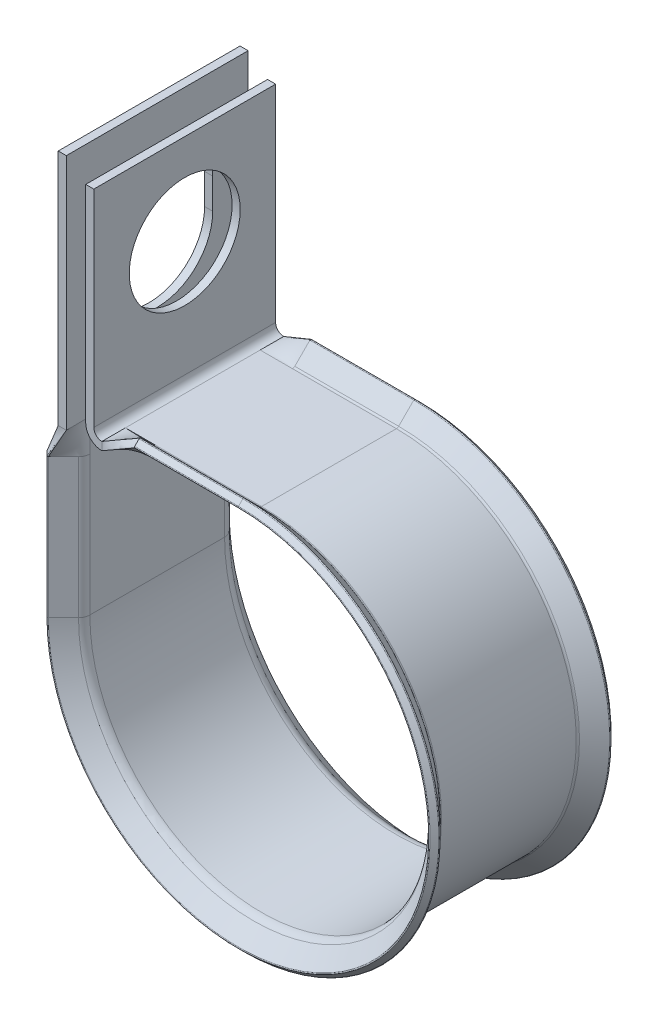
ISO-10303-21;
HEADER;
FILE_DESCRIPTION(('STEP AP214'),'2;1');
FILE_NAME('part.step','',(''),(''),'','','');
FILE_SCHEMA(('AUTOMOTIVE_DESIGN { 1 0 10303 214 1 1 1 1 }'));
ENDSEC;
DATA;
#1=APPLICATION_CONTEXT('core data for automotive mechanical design processes');
#2=APPLICATION_PROTOCOL_DEFINITION('international standard','automotive_design',2000,#1);
#3=PRODUCT_CONTEXT('',#1,'mechanical');
#4=PRODUCT('Part','Part','',(#3));
#5=PRODUCT_RELATED_PRODUCT_CATEGORY('part','',(#4));
#6=PRODUCT_DEFINITION_FORMATION('','',#4);
#7=PRODUCT_DEFINITION_CONTEXT('part definition',#1,'design');
#8=PRODUCT_DEFINITION('design','',#6,#7);
#9=PRODUCT_DEFINITION_SHAPE('','',#8);
#10=(LENGTH_UNIT() NAMED_UNIT(*) SI_UNIT(.MILLI.,.METRE.));
#11=(NAMED_UNIT(*) PLANE_ANGLE_UNIT() SI_UNIT($,.RADIAN.));
#12=(NAMED_UNIT(*) SI_UNIT($,.STERADIAN.) SOLID_ANGLE_UNIT());
#13=UNCERTAINTY_MEASURE_WITH_UNIT(LENGTH_MEASURE(1.E-05),#10,'distance_accuracy_value','');
#14=(GEOMETRIC_REPRESENTATION_CONTEXT(3) GLOBAL_UNCERTAINTY_ASSIGNED_CONTEXT((#13)) GLOBAL_UNIT_ASSIGNED_CONTEXT((#10,
#11,#12)) REPRESENTATION_CONTEXT('',''));
#15=CARTESIAN_POINT('',(0.,0.,0.));
#16=DIRECTION('',(0.,0.,1.));
#17=DIRECTION('',(1.,0.,0.));
#18=AXIS2_PLACEMENT_3D('',#15,#16,#17);
#19=CARTESIAN_POINT('',(5.334,-10.3378,5.28869458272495));
#20=DIRECTION('',(0.,0.,1.));
#21=DIRECTION('',(1.,0.,0.));
#22=AXIS2_PLACEMENT_3D('',#19,#20,#21);
#23=PLANE('',#22);
#24=DIRECTION('',(0.,1.,0.));
#25=VECTOR('',#24,1.);
#26=CARTESIAN_POINT('',(2.794,-10.3378,5.28869458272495));
#27=LINE('',#26,#25);
#28=CARTESIAN_POINT('',(2.794,-9.85163716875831,5.28869458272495));
#29=VERTEX_POINT('',#28);
#30=CARTESIAN_POINT('',(2.794,-9.7028,5.28869458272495));
#31=VERTEX_POINT('',#30);
#32=EDGE_CURVE('E902',#29,#31,#27,.T.);
#33=ORIENTED_EDGE('',*,*,#32,.F.);
#34=DIRECTION('',(0.998287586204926,0.0584969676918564,0.));
#35=VECTOR('',#34,1.);
#36=CARTESIAN_POINT('',(4.064,-9.77721858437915,5.28869458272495));
#37=LINE('',#36,#35);
#38=CARTESIAN_POINT('',(5.334,-9.7028,5.28869458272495));
#39=VERTEX_POINT('',#38);
#40=EDGE_CURVE('E1507',#29,#39,#37,.T.);
#41=ORIENTED_EDGE('',*,*,#40,.T.);
#42=DIRECTION('',(-1.,0.,0.));
#43=VECTOR('',#42,1.);
#44=CARTESIAN_POINT('',(13.4874,-9.7028,5.28869458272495));
#45=LINE('',#44,#43);
#46=EDGE_CURVE('E1592',#39,#31,#45,.T.);
#47=ORIENTED_EDGE('',*,*,#46,.T.);
#48=EDGE_LOOP('',(#33,#41,#47));
#49=FACE_BOUND('',#48,.T.);
#50=ADVANCED_FACE('F543',(#49),#23,.T.);
#51=CARTESIAN_POINT('',(13.4874,-10.3378,7.1374));
#52=DIRECTION('',(0.,-1.,0.));
#53=DIRECTION('',(1.,0.,0.));
#54=AXIS2_PLACEMENT_3D('',#51,#52,#53);
#55=PLANE('',#54);
#56=DIRECTION('',(0.,0.,-1.));
#57=VECTOR('',#56,1.);
#58=CARTESIAN_POINT('',(2.794,-10.3378,7.1374));
#59=LINE('',#58,#57);
#60=CARTESIAN_POINT('',(2.794,-10.3378,5.28869458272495));
#61=VERTEX_POINT('',#60);
#62=CARTESIAN_POINT('',(2.794,-10.3378,-5.28869458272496));
#63=VERTEX_POINT('',#62);
#64=EDGE_CURVE('E875',#61,#63,#59,.T.);
#65=ORIENTED_EDGE('',*,*,#64,.T.);
#66=DIRECTION('',(-1.,0.,0.));
#67=VECTOR('',#66,1.);
#68=CARTESIAN_POINT('',(5.334,-10.3378,-5.28869458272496));
#69=LINE('',#68,#67);
#70=CARTESIAN_POINT('',(5.334,-10.3378,-5.28869458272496));
#71=VERTEX_POINT('',#70);
#72=EDGE_CURVE('E889',#71,#63,#69,.T.);
#73=ORIENTED_EDGE('',*,*,#72,.F.);
#74=DIRECTION('',(-1.,0.,0.));
#75=VECTOR('',#74,1.);
#76=CARTESIAN_POINT('',(13.4874,-10.3378,-5.28869458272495));
#77=LINE('',#76,#75);
#78=CARTESIAN_POINT('',(13.4874,-10.3378,-5.28869458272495));
#79=VERTEX_POINT('',#78);
#80=EDGE_CURVE('E915',#79,#71,#77,.T.);
#81=ORIENTED_EDGE('',*,*,#80,.F.);
#82=DIRECTION('',(0.,0.,-1.));
#83=VECTOR('',#82,1.);
#84=CARTESIAN_POINT('',(13.4874,-10.3378,7.1374));
#85=LINE('',#84,#83);
#86=CARTESIAN_POINT('',(13.4874,-10.3378,5.28869458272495));
#87=VERTEX_POINT('',#86);
#88=EDGE_CURVE('E894',#87,#79,#85,.T.);
#89=ORIENTED_EDGE('',*,*,#88,.F.);
#90=DIRECTION('',(-1.,0.,0.));
#91=VECTOR('',#90,1.);
#92=CARTESIAN_POINT('',(13.4874,-10.3378,5.28869458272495));
#93=LINE('',#92,#91);
#94=CARTESIAN_POINT('',(5.334,-10.3378,5.28869458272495));
#95=VERTEX_POINT('',#94);
#96=EDGE_CURVE('E1216',#87,#95,#93,.T.);
#97=ORIENTED_EDGE('',*,*,#96,.T.);
#98=DIRECTION('',(-1.,0.,0.));
#99=VECTOR('',#98,1.);
#100=CARTESIAN_POINT('',(5.334,-10.3378,5.28869458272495));
#101=LINE('',#100,#99);
#102=EDGE_CURVE('E892',#95,#61,#101,.T.);
#103=ORIENTED_EDGE('',*,*,#102,.T.);
#104=EDGE_LOOP('',(#65,#73,#81,#89,#97,#103));
#105=FACE_BOUND('',#104,.T.);
#106=ADVANCED_FACE('F887',(#105),#55,.T.);
#107=CARTESIAN_POINT('',(13.4874,-23.8252,7.1374));
#108=DIRECTION('',(0.,0.,-1.));
#109=DIRECTION('',(-1.,0.,0.));
#110=AXIS2_PLACEMENT_3D('',#107,#108,#109);
#111=CYLINDRICAL_SURFACE('',#110,13.4874);
#112=ORIENTED_EDGE('',*,*,#88,.T.);
#113=CARTESIAN_POINT('',(13.4873999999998,-23.8251999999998,-5.28869458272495));
#114=DIRECTION('',(0.,0.,-1.));
#115=DIRECTION('',(-1.,0.,0.));
#116=AXIS2_PLACEMENT_3D('',#113,#114,#115);
#117=CIRCLE('',#116,13.4873999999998);
#118=CARTESIAN_POINT('',(0.,-23.8251999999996,-5.28869458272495));
#119=VERTEX_POINT('',#118);
#120=EDGE_CURVE('E1163',#79,#119,#117,.T.);
#121=ORIENTED_EDGE('',*,*,#120,.T.);
#122=DIRECTION('',(0.,0.,-1.));
#123=VECTOR('',#122,1.);
#124=CARTESIAN_POINT('',(0.,-23.8252,7.1374));
#125=LINE('',#124,#123);
#126=CARTESIAN_POINT('',(0.,-23.8251999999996,5.28869458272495));
#127=VERTEX_POINT('',#126);
#128=EDGE_CURVE('E1410',#127,#119,#125,.T.);
#129=ORIENTED_EDGE('',*,*,#128,.F.);
#130=CARTESIAN_POINT('',(13.4873999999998,-23.8251999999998,5.28869458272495));
#131=DIRECTION('',(0.,0.,-1.));
#132=DIRECTION('',(-1.,0.,0.));
#133=AXIS2_PLACEMENT_3D('',#130,#131,#132);
#134=CIRCLE('',#133,13.4873999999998);
#135=EDGE_CURVE('E1253',#87,#127,#134,.T.);
#136=ORIENTED_EDGE('',*,*,#135,.F.);
#137=EDGE_LOOP('',(#112,#121,#129,#136));
#138=FACE_BOUND('',#137,.T.);
#139=ADVANCED_FACE('F1665',(#138),#111,.F.);
#140=CARTESIAN_POINT('',(0.,-23.8252,7.1374));
#141=DIRECTION('',(1.,0.,0.));
#142=DIRECTION('',(0.,0.,-1.));
#143=AXIS2_PLACEMENT_3D('',#140,#141,#142);
#144=PLANE('',#143);
#145=CARTESIAN_POINT('',(0.,-1.1938,0.));
#146=DIRECTION('',(1.,0.,0.));
#147=DIRECTION('',(0.,0.,-1.));
#148=AXIS2_PLACEMENT_3D('',#145,#146,#147);
#149=CIRCLE('',#148,4.3561);
#150=CARTESIAN_POINT('',(0.,-1.1938,-4.3561));
#151=VERTEX_POINT('',#150);
#152=CARTESIAN_POINT('',(0.,-1.1938,4.3561));
#153=VERTEX_POINT('',#152);
#154=EDGE_CURVE('E1314',#151,#153,#149,.F.);
#155=ORIENTED_EDGE('',*,*,#154,.T.);
#156=DIRECTION('',(0.,1.,0.));
#157=VECTOR('',#156,1.);
#158=CARTESIAN_POINT('',(0.,-1.1938,4.3561));
#159=LINE('',#158,#157);
#160=CARTESIAN_POINT('',(0.,1.1938,4.3561));
#161=VERTEX_POINT('',#160);
#162=EDGE_CURVE('E1315',#153,#161,#159,.T.);
#163=ORIENTED_EDGE('',*,*,#162,.T.);
#164=CARTESIAN_POINT('',(0.,1.1938,0.));
#165=DIRECTION('',(1.,0.,0.));
#166=DIRECTION('',(0.,0.,-1.));
#167=AXIS2_PLACEMENT_3D('',#164,#165,#166);
#168=CIRCLE('',#167,4.3561);
#169=CARTESIAN_POINT('',(0.,1.1938,-4.3561));
#170=VERTEX_POINT('',#169);
#171=EDGE_CURVE('E1339',#161,#170,#168,.F.);
#172=ORIENTED_EDGE('',*,*,#171,.T.);
#173=DIRECTION('',(0.,-1.,0.));
#174=VECTOR('',#173,1.);
#175=CARTESIAN_POINT('',(0.,-1.1938,-4.3561));
#176=LINE('',#175,#174);
#177=EDGE_CURVE('E1335',#170,#151,#176,.T.);
#178=ORIENTED_EDGE('',*,*,#177,.T.);
#179=EDGE_LOOP('',(#155,#163,#172,#178));
#180=FACE_BOUND('',#179,.T.);
#181=ORIENTED_EDGE('',*,*,#128,.T.);
#182=DIRECTION('',(0.,1.,0.));
#183=VECTOR('',#182,1.);
#184=CARTESIAN_POINT('',(0.,-23.8251999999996,-5.28869458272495));
#185=LINE('',#184,#183);
#186=CARTESIAN_POINT('',(0.,-12.8777999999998,-5.28869458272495));
#187=VERTEX_POINT('',#186);
#188=EDGE_CURVE('E1185',#119,#187,#185,.T.);
#189=ORIENTED_EDGE('',*,*,#188,.T.);
#190=CARTESIAN_POINT('',(0.,-10.3377999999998,-5.28869458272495));
#191=VERTEX_POINT('',#190);
#192=EDGE_CURVE('E1184',#187,#191,#185,.T.);
#193=ORIENTED_EDGE('',*,*,#192,.T.);
#194=DIRECTION('',(0.,0.,-1.));
#195=VECTOR('',#194,1.);
#196=CARTESIAN_POINT('',(0.,-10.3377999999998,-7.1374));
#197=LINE('',#196,#195);
#198=CARTESIAN_POINT('',(0.,-10.3377999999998,-7.1374));
#199=VERTEX_POINT('',#198);
#200=EDGE_CURVE('E1302',#191,#199,#197,.T.);
#201=ORIENTED_EDGE('',*,*,#200,.T.);
#202=DIRECTION('',(0.,-1.,0.));
#203=VECTOR('',#202,1.);
#204=CARTESIAN_POINT('',(0.,-23.8252,-7.1374));
#205=LINE('',#204,#203);
#206=CARTESIAN_POINT('',(0.,8.3312,-7.1374));
#207=VERTEX_POINT('',#206);
#208=EDGE_CURVE('E1386',#207,#199,#205,.T.);
#209=ORIENTED_EDGE('',*,*,#208,.F.);
#210=DIRECTION('',(0.,0.,-1.));
#211=VECTOR('',#210,1.);
#212=CARTESIAN_POINT('',(0.,8.3312,7.1374));
#213=LINE('',#212,#211);
#214=CARTESIAN_POINT('',(0.,8.3312,7.1374));
#215=VERTEX_POINT('',#214);
#216=EDGE_CURVE('E1408',#215,#207,#213,.T.);
#217=ORIENTED_EDGE('',*,*,#216,.F.);
#218=DIRECTION('',(0.,-1.,0.));
#219=VECTOR('',#218,1.);
#220=CARTESIAN_POINT('',(0.,-23.8252,7.1374));
#221=LINE('',#220,#219);
#222=CARTESIAN_POINT('',(0.,-10.3377999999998,7.1374));
#223=VERTEX_POINT('',#222);
#224=EDGE_CURVE('E1365',#215,#223,#221,.T.);
#225=ORIENTED_EDGE('',*,*,#224,.T.);
#226=DIRECTION('',(0.,0.,-1.));
#227=VECTOR('',#226,1.);
#228=CARTESIAN_POINT('',(0.,-10.3377999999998,7.1374));
#229=LINE('',#228,#227);
#230=CARTESIAN_POINT('',(0.,-10.3377999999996,5.28869458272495));
#231=VERTEX_POINT('',#230);
#232=EDGE_CURVE('E1312',#223,#231,#229,.T.);
#233=ORIENTED_EDGE('',*,*,#232,.T.);
#234=DIRECTION('',(0.,1.,0.));
#235=VECTOR('',#234,1.);
#236=CARTESIAN_POINT('',(0.,-23.8251999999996,5.28869458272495));
#237=LINE('',#236,#235);
#238=CARTESIAN_POINT('',(0.,-12.8777999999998,5.28869458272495));
#239=VERTEX_POINT('',#238);
#240=EDGE_CURVE('E1277',#239,#231,#237,.T.);
#241=ORIENTED_EDGE('',*,*,#240,.F.);
#242=EDGE_CURVE('E1278',#127,#239,#237,.T.);
#243=ORIENTED_EDGE('',*,*,#242,.F.);
#244=EDGE_LOOP('',(#181,#189,#193,#201,#209,#217,#225,#233,#241,#243));
#245=FACE_BOUND('',#244,.T.);
#246=ADVANCED_FACE('F1763',(#180,#245),#144,.T.);
#247=CARTESIAN_POINT('',(-0.635,-23.8252,7.1374));
#248=DIRECTION('',(1.,0.,0.));
#249=DIRECTION('',(0.,0.,-1.));
#250=AXIS2_PLACEMENT_3D('',#247,#248,#249);
#251=PLANE('',#250);
#252=DIRECTION('',(0.,1.,0.));
#253=VECTOR('',#252,1.);
#254=CARTESIAN_POINT('',(-0.635,-1.1938,4.3561));
#255=LINE('',#254,#253);
#256=CARTESIAN_POINT('',(-0.635,-1.1938,4.3561));
#257=VERTEX_POINT('',#256);
#258=CARTESIAN_POINT('',(-0.635,1.1938,4.3561));
#259=VERTEX_POINT('',#258);
#260=EDGE_CURVE('E1327',#257,#259,#255,.T.);
#261=ORIENTED_EDGE('',*,*,#260,.F.);
#262=CARTESIAN_POINT('',(-0.635,-1.1938,0.));
#263=DIRECTION('',(-1.,0.,0.));
#264=DIRECTION('',(0.,-1.,0.));
#265=AXIS2_PLACEMENT_3D('',#262,#263,#264);
#266=CIRCLE('',#265,4.3561);
#267=CARTESIAN_POINT('',(-0.635,-1.1938,-4.3561));
#268=VERTEX_POINT('',#267);
#269=EDGE_CURVE('E1330',#268,#257,#266,.T.);
#270=ORIENTED_EDGE('',*,*,#269,.F.);
#271=DIRECTION('',(0.,-1.,0.));
#272=VECTOR('',#271,1.);
#273=CARTESIAN_POINT('',(-0.635,-1.1938,-4.3561));
#274=LINE('',#273,#272);
#275=CARTESIAN_POINT('',(-0.635,1.1938,-4.3561));
#276=VERTEX_POINT('',#275);
#277=EDGE_CURVE('E1320',#276,#268,#274,.T.);
#278=ORIENTED_EDGE('',*,*,#277,.F.);
#279=CARTESIAN_POINT('',(-0.635,1.1938,0.));
#280=DIRECTION('',(-1.,0.,0.));
#281=DIRECTION('',(0.,-1.,0.));
#282=AXIS2_PLACEMENT_3D('',#279,#280,#281);
#283=CIRCLE('',#282,4.3561);
#284=EDGE_CURVE('E1324',#259,#276,#283,.T.);
#285=ORIENTED_EDGE('',*,*,#284,.F.);
#286=EDGE_LOOP('',(#261,#270,#278,#285));
#287=FACE_BOUND('',#286,.T.);
#288=DIRECTION('',(0.,1.,0.));
#289=VECTOR('',#288,1.);
#290=CARTESIAN_POINT('',(-0.635000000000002,-23.8251999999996,-5.28869458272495));
#291=LINE('',#290,#289);
#292=CARTESIAN_POINT('',(-0.635000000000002,-23.8251999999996,-5.28869458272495));
#293=VERTEX_POINT('',#292);
#294=CARTESIAN_POINT('',(-0.635,-12.8777999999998,-5.28869458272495));
#295=VERTEX_POINT('',#294);
#296=EDGE_CURVE('E1188',#293,#295,#291,.T.);
#297=ORIENTED_EDGE('',*,*,#296,.F.);
#298=DIRECTION('',(0.,0.,-1.));
#299=VECTOR('',#298,1.);
#300=CARTESIAN_POINT('',(-0.635,-23.8252,7.1374));
#301=LINE('',#300,#299);
#302=CARTESIAN_POINT('',(-0.635000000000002,-23.8251999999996,5.28869458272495));
#303=VERTEX_POINT('',#302);
#304=EDGE_CURVE('E1404',#303,#293,#301,.T.);
#305=ORIENTED_EDGE('',*,*,#304,.F.);
#306=DIRECTION('',(0.,1.,0.));
#307=VECTOR('',#306,1.);
#308=CARTESIAN_POINT('',(-0.635000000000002,-23.8251999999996,5.28869458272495));
#309=LINE('',#308,#307);
#310=CARTESIAN_POINT('',(-0.635,-12.8777999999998,5.28869458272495));
#311=VERTEX_POINT('',#310);
#312=EDGE_CURVE('E1294',#303,#311,#309,.T.);
#313=ORIENTED_EDGE('',*,*,#312,.T.);
#314=DIRECTION('',(0.,1.,0.));
#315=VECTOR('',#314,1.);
#316=CARTESIAN_POINT('',(-0.635,-23.8251999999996,5.28869458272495));
#317=LINE('',#316,#315);
#318=CARTESIAN_POINT('',(-0.635,-10.3377999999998,5.28869458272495));
#319=VERTEX_POINT('',#318);
#320=EDGE_CURVE('E2637',#319,#311,#317,.F.);
#321=ORIENTED_EDGE('',*,*,#320,.F.);
#322=DIRECTION('',(0.,0.,1.));
#323=VECTOR('',#322,1.);
#324=CARTESIAN_POINT('',(-0.635,-10.3377999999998,7.1374));
#325=LINE('',#324,#323);
#326=CARTESIAN_POINT('',(-0.635,-10.3377999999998,7.1374));
#327=VERTEX_POINT('',#326);
#328=EDGE_CURVE('E1310',#319,#327,#325,.T.);
#329=ORIENTED_EDGE('',*,*,#328,.T.);
#330=DIRECTION('',(0.,1.,0.));
#331=VECTOR('',#330,1.);
#332=CARTESIAN_POINT('',(-0.635,-23.8252,7.1374));
#333=LINE('',#332,#331);
#334=CARTESIAN_POINT('',(-0.635,8.3312,7.1374));
#335=VERTEX_POINT('',#334);
#336=EDGE_CURVE('E1371',#335,#327,#333,.F.);
#337=ORIENTED_EDGE('',*,*,#336,.F.);
#338=DIRECTION('',(0.,0.,-1.));
#339=VECTOR('',#338,1.);
#340=CARTESIAN_POINT('',(-0.635,8.3312,7.1374));
#341=LINE('',#340,#339);
#342=CARTESIAN_POINT('',(-0.635,8.3312,-7.1374));
#343=VERTEX_POINT('',#342);
#344=EDGE_CURVE('E1406',#335,#343,#341,.T.);
#345=ORIENTED_EDGE('',*,*,#344,.T.);
#346=DIRECTION('',(0.,1.,0.));
#347=VECTOR('',#346,1.);
#348=CARTESIAN_POINT('',(-0.635,-23.8252,-7.1374));
#349=LINE('',#348,#347);
#350=CARTESIAN_POINT('',(-0.635,-10.3377999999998,-7.1374));
#351=VERTEX_POINT('',#350);
#352=EDGE_CURVE('E1392',#343,#351,#349,.F.);
#353=ORIENTED_EDGE('',*,*,#352,.T.);
#354=DIRECTION('',(0.,0.,1.));
#355=VECTOR('',#354,1.);
#356=CARTESIAN_POINT('',(-0.635,-10.3377999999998,-7.1374));
#357=LINE('',#356,#355);
#358=CARTESIAN_POINT('',(-0.635,-10.3377999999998,-5.28869458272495));
#359=VERTEX_POINT('',#358);
#360=EDGE_CURVE('E1304',#351,#359,#357,.T.);
#361=ORIENTED_EDGE('',*,*,#360,.T.);
#362=DIRECTION('',(0.,1.,0.));
#363=VECTOR('',#362,1.);
#364=CARTESIAN_POINT('',(-0.635,-23.8251999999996,-5.28869458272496));
#365=LINE('',#364,#363);
#366=EDGE_CURVE('E1119',#295,#359,#365,.T.);
#367=ORIENTED_EDGE('',*,*,#366,.F.);
#368=EDGE_LOOP('',(#297,#305,#313,#321,#329,#337,#345,#353,#361,#367));
#369=FACE_BOUND('',#368,.T.);
#370=ADVANCED_FACE('F1759',(#287,#369),#251,.F.);
#371=CARTESIAN_POINT('',(13.4874,-23.8252,7.1374));
#372=DIRECTION('',(0.,0.,-1.));
#373=DIRECTION('',(-1.,0.,0.));
#374=AXIS2_PLACEMENT_3D('',#371,#372,#373);
#375=CYLINDRICAL_SURFACE('',#374,14.1224);
#376=ORIENTED_EDGE('',*,*,#304,.T.);
#377=CARTESIAN_POINT('',(13.4873999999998,-23.8251999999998,-5.28869458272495));
#378=DIRECTION('',(0.,0.,-1.));
#379=DIRECTION('',(-1.,0.,0.));
#380=AXIS2_PLACEMENT_3D('',#377,#378,#379);
#381=CIRCLE('',#380,14.1223999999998);
#382=CARTESIAN_POINT('',(13.4874,-9.70279999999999,-5.28869458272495));
#383=VERTEX_POINT('',#382);
#384=EDGE_CURVE('E1166',#383,#293,#381,.T.);
#385=ORIENTED_EDGE('',*,*,#384,.F.);
#386=DIRECTION('',(0.,0.,-1.));
#387=VECTOR('',#386,1.);
#388=CARTESIAN_POINT('',(13.4874,-9.7028,7.1374));
#389=LINE('',#388,#387);
#390=CARTESIAN_POINT('',(13.4874,-9.70279999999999,5.28869458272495));
#391=VERTEX_POINT('',#390);
#392=EDGE_CURVE('E1402',#391,#383,#389,.T.);
#393=ORIENTED_EDGE('',*,*,#392,.F.);
#394=CARTESIAN_POINT('',(13.4873999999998,-23.8251999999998,5.28869458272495));
#395=DIRECTION('',(0.,0.,-1.));
#396=DIRECTION('',(-1.,0.,0.));
#397=AXIS2_PLACEMENT_3D('',#394,#395,#396);
#398=CIRCLE('',#397,14.1223999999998);
#399=EDGE_CURVE('E1274',#391,#303,#398,.T.);
#400=ORIENTED_EDGE('',*,*,#399,.T.);
#401=EDGE_LOOP('',(#376,#385,#393,#400));
#402=FACE_BOUND('',#401,.T.);
#403=ADVANCED_FACE('F1755',(#402),#375,.T.);
#404=CARTESIAN_POINT('',(13.4874,-9.7028,7.1374));
#405=DIRECTION('',(0.,-1.,0.));
#406=DIRECTION('',(1.,0.,0.));
#407=AXIS2_PLACEMENT_3D('',#404,#405,#406);
#408=PLANE('',#407);
#409=ORIENTED_EDGE('',*,*,#392,.T.);
#410=DIRECTION('',(-1.,0.,0.));
#411=VECTOR('',#410,1.);
#412=CARTESIAN_POINT('',(13.4874,-9.70279999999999,-5.28869458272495));
#413=LINE('',#412,#411);
#414=CARTESIAN_POINT('',(5.334,-9.7028,-5.28869458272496));
#415=VERTEX_POINT('',#414);
#416=EDGE_CURVE('E917',#383,#415,#413,.T.);
#417=ORIENTED_EDGE('',*,*,#416,.T.);
#418=DIRECTION('',(-1.,0.,0.));
#419=VECTOR('',#418,1.);
#420=CARTESIAN_POINT('',(13.4874,-9.7028,-5.28869458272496));
#421=LINE('',#420,#419);
#422=CARTESIAN_POINT('',(2.794,-9.7028,-5.28869458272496));
#423=VERTEX_POINT('',#422);
#424=EDGE_CURVE('E1102',#423,#415,#421,.F.);
#425=ORIENTED_EDGE('',*,*,#424,.F.);
#426=DIRECTION('',(0.,0.,-1.));
#427=VECTOR('',#426,1.);
#428=CARTESIAN_POINT('',(2.794,-9.7028,7.1374));
#429=LINE('',#428,#427);
#430=EDGE_CURVE('E1398',#31,#423,#429,.T.);
#431=ORIENTED_EDGE('',*,*,#430,.F.);
#432=ORIENTED_EDGE('',*,*,#46,.F.);
#433=DIRECTION('',(-1.,0.,0.));
#434=VECTOR('',#433,1.);
#435=CARTESIAN_POINT('',(13.4874,-9.70279999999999,5.28869458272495));
#436=LINE('',#435,#434);
#437=EDGE_CURVE('E1228',#391,#39,#436,.T.);
#438=ORIENTED_EDGE('',*,*,#437,.F.);
#439=EDGE_LOOP('',(#409,#417,#425,#431,#432,#438));
#440=FACE_BOUND('',#439,.T.);
#441=ADVANCED_FACE('F1752',(#440),#408,.F.);
#442=CARTESIAN_POINT('',(2.794,-9.0678,-7.1374));
#443=DIRECTION('',(0.,0.,-1.));
#444=DIRECTION('',(-1.,0.,0.));
#445=AXIS2_PLACEMENT_3D('',#442,#443,#444);
#446=PLANE('',#445);
#447=ORIENTED_EDGE('',*,*,#208,.T.);
#448=DIRECTION('',(-1.,0.,0.));
#449=VECTOR('',#448,1.);
#450=CARTESIAN_POINT('',(-0.635,-10.3377999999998,-7.1374));
#451=LINE('',#450,#449);
#452=EDGE_CURVE('E882',#199,#351,#451,.T.);
#453=ORIENTED_EDGE('',*,*,#452,.T.);
#454=ORIENTED_EDGE('',*,*,#352,.F.);
#455=DIRECTION('',(1.,0.,0.));
#456=VECTOR('',#455,1.);
#457=CARTESIAN_POINT('',(-0.635,8.3312,-7.1374));
#458=LINE('',#457,#456);
#459=EDGE_CURVE('E1389',#343,#207,#458,.T.);
#460=ORIENTED_EDGE('',*,*,#459,.T.);
#461=EDGE_LOOP('',(#447,#453,#454,#460));
#462=FACE_BOUND('',#461,.T.);
#463=ADVANCED_FACE('F1747',(#462),#446,.T.);
#464=CARTESIAN_POINT('',(2.794,-9.0678,7.1374));
#465=DIRECTION('',(0.,0.,-1.));
#466=DIRECTION('',(-1.,0.,0.));
#467=AXIS2_PLACEMENT_3D('',#464,#465,#466);
#468=PLANE('',#467);
#469=DIRECTION('',(0.,-1.,0.));
#470=VECTOR('',#469,1.);
#471=CARTESIAN_POINT('',(2.794,-9.7028,7.1374));
#472=LINE('',#471,#470);
#473=CARTESIAN_POINT('',(2.794,-9.7028,7.1374));
#474=VERTEX_POINT('',#473);
#475=CARTESIAN_POINT('',(2.794,-10.3378,7.1374));
#476=VERTEX_POINT('',#475);
#477=EDGE_CURVE('E1306',#474,#476,#472,.T.);
#478=ORIENTED_EDGE('',*,*,#477,.F.);
#479=CARTESIAN_POINT('',(2.794,-9.0678,7.1374));
#480=DIRECTION('',(0.,0.,1.));
#481=DIRECTION('',(1.,0.,0.));
#482=AXIS2_PLACEMENT_3D('',#479,#480,#481);
#483=CIRCLE('',#482,0.635);
#484=CARTESIAN_POINT('',(2.159,-9.0678,7.1374));
#485=VERTEX_POINT('',#484);
#486=EDGE_CURVE('E1374',#474,#485,#483,.F.);
#487=ORIENTED_EDGE('',*,*,#486,.T.);
#488=DIRECTION('',(0.,1.,0.));
#489=VECTOR('',#488,1.);
#490=CARTESIAN_POINT('',(2.159,-9.0678,7.1374));
#491=LINE('',#490,#489);
#492=CARTESIAN_POINT('',(2.159,7.1374,7.1374));
#493=VERTEX_POINT('',#492);
#494=EDGE_CURVE('E1353',#485,#493,#491,.T.);
#495=ORIENTED_EDGE('',*,*,#494,.T.);
#496=DIRECTION('',(1.,0.,0.));
#497=VECTOR('',#496,1.);
#498=CARTESIAN_POINT('',(1.524,7.1374,7.1374));
#499=LINE('',#498,#497);
#500=CARTESIAN_POINT('',(1.524,7.1374,7.1374));
#501=VERTEX_POINT('',#500);
#502=EDGE_CURVE('E1355',#501,#493,#499,.T.);
#503=ORIENTED_EDGE('',*,*,#502,.F.);
#504=DIRECTION('',(0.,1.,0.));
#505=VECTOR('',#504,1.);
#506=CARTESIAN_POINT('',(1.524,-9.0678,7.1374));
#507=LINE('',#506,#505);
#508=CARTESIAN_POINT('',(1.524,-9.0678,7.1374));
#509=VERTEX_POINT('',#508);
#510=EDGE_CURVE('E1359',#509,#501,#507,.T.);
#511=ORIENTED_EDGE('',*,*,#510,.F.);
#512=CARTESIAN_POINT('',(2.794,-9.0678,7.1374));
#513=DIRECTION('',(0.,0.,-1.));
#514=DIRECTION('',(-1.,0.,0.));
#515=AXIS2_PLACEMENT_3D('',#512,#513,#514);
#516=CIRCLE('',#515,1.27);
#517=EDGE_CURVE('E1362',#476,#509,#516,.T.);
#518=ORIENTED_EDGE('',*,*,#517,.F.);
#519=EDGE_LOOP('',(#478,#487,#495,#503,#511,#518));
#520=FACE_BOUND('',#519,.T.);
#521=ADVANCED_FACE('F1743',(#520),#468,.F.);
#522=CARTESIAN_POINT('',(2.159,-9.0678,7.1374));
#523=DIRECTION('',(-1.,0.,0.));
#524=DIRECTION('',(0.,-1.,0.));
#525=AXIS2_PLACEMENT_3D('',#522,#523,#524);
#526=PLANE('',#525);
#527=CARTESIAN_POINT('',(2.159,0.,0.));
#528=DIRECTION('',(1.,0.,0.));
#529=DIRECTION('',(0.,0.,-1.));
#530=AXIS2_PLACEMENT_3D('',#527,#528,#529);
#531=CIRCLE('',#530,4.3561);
#532=CARTESIAN_POINT('',(2.159,0.,-4.3561));
#533=VERTEX_POINT('',#532);
#534=EDGE_CURVE('E1349',#533,#533,#531,.T.);
#535=ORIENTED_EDGE('',*,*,#534,.F.);
#536=EDGE_LOOP('',(#535));
#537=FACE_BOUND('',#536,.T.);
#538=DIRECTION('',(0.,1.,0.));
#539=VECTOR('',#538,1.);
#540=CARTESIAN_POINT('',(2.159,-9.0678,-7.1374));
#541=LINE('',#540,#539);
#542=CARTESIAN_POINT('',(2.159,-9.0678,-7.1374));
#543=VERTEX_POINT('',#542);
#544=CARTESIAN_POINT('',(2.159,7.1374,-7.1374));
#545=VERTEX_POINT('',#544);
#546=EDGE_CURVE('E1352',#543,#545,#541,.T.);
#547=ORIENTED_EDGE('',*,*,#546,.T.);
#548=DIRECTION('',(0.,0.,-1.));
#549=VECTOR('',#548,1.);
#550=CARTESIAN_POINT('',(2.159,7.1374,7.1374));
#551=LINE('',#550,#549);
#552=EDGE_CURVE('E1417',#493,#545,#551,.T.);
#553=ORIENTED_EDGE('',*,*,#552,.F.);
#554=ORIENTED_EDGE('',*,*,#494,.F.);
#555=DIRECTION('',(0.,0.,-1.));
#556=VECTOR('',#555,1.);
#557=CARTESIAN_POINT('',(2.159,-9.0678,7.1374));
#558=LINE('',#557,#556);
#559=EDGE_CURVE('E1376',#485,#543,#558,.T.);
#560=ORIENTED_EDGE('',*,*,#559,.T.);
#561=EDGE_LOOP('',(#547,#553,#554,#560));
#562=FACE_BOUND('',#561,.T.);
#563=ADVANCED_FACE('F545',(#537,#562),#526,.F.);
#564=CARTESIAN_POINT('',(1.524,7.1374,7.1374));
#565=DIRECTION('',(0.,1.,0.));
#566=DIRECTION('',(0.,0.,1.));
#567=AXIS2_PLACEMENT_3D('',#564,#565,#566);
#568=PLANE('',#567);
#569=DIRECTION('',(1.,0.,0.));
#570=VECTOR('',#569,1.);
#571=CARTESIAN_POINT('',(1.524,7.1374,-7.1374));
#572=LINE('',#571,#570);
#573=CARTESIAN_POINT('',(1.524,7.1374,-7.1374));
#574=VERTEX_POINT('',#573);
#575=EDGE_CURVE('E1379',#574,#545,#572,.T.);
#576=ORIENTED_EDGE('',*,*,#575,.F.);
#577=DIRECTION('',(0.,0.,-1.));
#578=VECTOR('',#577,1.);
#579=CARTESIAN_POINT('',(1.524,7.1374,7.1374));
#580=LINE('',#579,#578);
#581=EDGE_CURVE('E1415',#501,#574,#580,.T.);
#582=ORIENTED_EDGE('',*,*,#581,.F.);
#583=ORIENTED_EDGE('',*,*,#502,.T.);
#584=ORIENTED_EDGE('',*,*,#552,.T.);
#585=EDGE_LOOP('',(#576,#582,#583,#584));
#586=FACE_BOUND('',#585,.T.);
#587=ADVANCED_FACE('F1778',(#586),#568,.T.);
#588=CARTESIAN_POINT('',(1.524,-9.0678,7.1374));
#589=DIRECTION('',(-1.,0.,0.));
#590=DIRECTION('',(0.,-1.,0.));
#591=AXIS2_PLACEMENT_3D('',#588,#589,#590);
#592=PLANE('',#591);
#593=CARTESIAN_POINT('',(1.524,0.,0.));
#594=DIRECTION('',(-1.,0.,0.));
#595=DIRECTION('',(0.,-1.,0.));
#596=AXIS2_PLACEMENT_3D('',#593,#594,#595);
#597=CIRCLE('',#596,4.3561);
#598=CARTESIAN_POINT('',(1.524,-4.3561,0.));
#599=VERTEX_POINT('',#598);
#600=EDGE_CURVE('E1323',#599,#599,#597,.F.);
#601=ORIENTED_EDGE('',*,*,#600,.T.);
#602=EDGE_LOOP('',(#601));
#603=FACE_BOUND('',#602,.T.);
#604=DIRECTION('',(0.,1.,0.));
#605=VECTOR('',#604,1.);
#606=CARTESIAN_POINT('',(1.524,-9.0678,-7.1374));
#607=LINE('',#606,#605);
#608=CARTESIAN_POINT('',(1.524,-9.0678,-7.1374));
#609=VERTEX_POINT('',#608);
#610=EDGE_CURVE('E1382',#609,#574,#607,.T.);
#611=ORIENTED_EDGE('',*,*,#610,.F.);
#612=DIRECTION('',(0.,0.,-1.));
#613=VECTOR('',#612,1.);
#614=CARTESIAN_POINT('',(1.524,-9.0678,7.1374));
#615=LINE('',#614,#613);
#616=EDGE_CURVE('E1413',#509,#609,#615,.T.);
#617=ORIENTED_EDGE('',*,*,#616,.F.);
#618=ORIENTED_EDGE('',*,*,#510,.T.);
#619=ORIENTED_EDGE('',*,*,#581,.T.);
#620=EDGE_LOOP('',(#611,#617,#618,#619));
#621=FACE_BOUND('',#620,.T.);
#622=ADVANCED_FACE('F1776',(#603,#621),#592,.T.);
#623=CARTESIAN_POINT('',(2.794,-9.0678,7.1374));
#624=DIRECTION('',(0.,0.,-1.));
#625=DIRECTION('',(-1.,0.,0.));
#626=AXIS2_PLACEMENT_3D('',#623,#624,#625);
#627=CYLINDRICAL_SURFACE('',#626,1.27);
#628=CARTESIAN_POINT('',(2.794,-9.0678,-7.1374));
#629=DIRECTION('',(0.,0.,-1.));
#630=DIRECTION('',(-1.,0.,0.));
#631=AXIS2_PLACEMENT_3D('',#628,#629,#630);
#632=CIRCLE('',#631,1.27);
#633=CARTESIAN_POINT('',(2.794,-10.3378,-7.1374));
#634=VERTEX_POINT('',#633);
#635=EDGE_CURVE('E877',#634,#609,#632,.T.);
#636=ORIENTED_EDGE('',*,*,#635,.F.);
#637=DIRECTION('',(0.,0.,-1.));
#638=VECTOR('',#637,1.);
#639=CARTESIAN_POINT('',(2.794,-10.3378,-7.1374));
#640=LINE('',#639,#638);
#641=EDGE_CURVE('E871',#63,#634,#640,.T.);
#642=ORIENTED_EDGE('',*,*,#641,.F.);
#643=ORIENTED_EDGE('',*,*,#64,.F.);
#644=EDGE_CURVE('E893',#476,#61,#59,.T.);
#645=ORIENTED_EDGE('',*,*,#644,.F.);
#646=ORIENTED_EDGE('',*,*,#517,.T.);
#647=ORIENTED_EDGE('',*,*,#616,.T.);
#648=EDGE_LOOP('',(#636,#642,#643,#645,#646,#647));
#649=FACE_BOUND('',#648,.T.);
#650=ADVANCED_FACE('F873',(#649),#627,.T.);
#651=CARTESIAN_POINT('',(-0.635,8.3312,7.1374));
#652=DIRECTION('',(0.,1.,0.));
#653=DIRECTION('',(-1.,0.,0.));
#654=AXIS2_PLACEMENT_3D('',#651,#652,#653);
#655=PLANE('',#654);
#656=ORIENTED_EDGE('',*,*,#459,.F.);
#657=ORIENTED_EDGE('',*,*,#344,.F.);
#658=DIRECTION('',(1.,0.,0.));
#659=VECTOR('',#658,1.);
#660=CARTESIAN_POINT('',(-0.635,8.3312,7.1374));
#661=LINE('',#660,#659);
#662=EDGE_CURVE('E1368',#335,#215,#661,.T.);
#663=ORIENTED_EDGE('',*,*,#662,.T.);
#664=ORIENTED_EDGE('',*,*,#216,.T.);
#665=EDGE_LOOP('',(#656,#657,#663,#664));
#666=FACE_BOUND('',#665,.T.);
#667=ADVANCED_FACE('F1750',(#666),#655,.T.);
#668=CARTESIAN_POINT('',(2.794,-9.0678,7.1374));
#669=DIRECTION('',(0.,0.,-1.));
#670=DIRECTION('',(-1.,0.,0.));
#671=AXIS2_PLACEMENT_3D('',#668,#669,#670);
#672=CYLINDRICAL_SURFACE('',#671,0.635);
#673=CARTESIAN_POINT('',(2.794,-9.0678,-7.1374));
#674=DIRECTION('',(0.,0.,1.));
#675=DIRECTION('',(1.,0.,0.));
#676=AXIS2_PLACEMENT_3D('',#673,#674,#675);
#677=CIRCLE('',#676,0.635);
#678=CARTESIAN_POINT('',(2.794,-9.7028,-7.1374));
#679=VERTEX_POINT('',#678);
#680=EDGE_CURVE('E1356',#679,#543,#677,.F.);
#681=ORIENTED_EDGE('',*,*,#680,.T.);
#682=ORIENTED_EDGE('',*,*,#559,.F.);
#683=ORIENTED_EDGE('',*,*,#486,.F.);
#684=EDGE_CURVE('E1399',#474,#31,#429,.T.);
#685=ORIENTED_EDGE('',*,*,#684,.T.);
#686=ORIENTED_EDGE('',*,*,#430,.T.);
#687=DIRECTION('',(0.,0.,1.));
#688=VECTOR('',#687,1.);
#689=CARTESIAN_POINT('',(2.794,-9.7028,-7.1374));
#690=LINE('',#689,#688);
#691=EDGE_CURVE('E883',#679,#423,#690,.T.);
#692=ORIENTED_EDGE('',*,*,#691,.F.);
#693=EDGE_LOOP('',(#681,#682,#683,#685,#686,#692));
#694=FACE_BOUND('',#693,.T.);
#695=ADVANCED_FACE('F1741',(#694),#672,.F.);
#696=ORIENTED_EDGE('',*,*,#336,.T.);
#697=DIRECTION('',(1.,0.,0.));
#698=VECTOR('',#697,1.);
#699=CARTESIAN_POINT('',(-0.635,-10.3377999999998,7.1374));
#700=LINE('',#699,#698);
#701=EDGE_CURVE('E1308',#327,#223,#700,.T.);
#702=ORIENTED_EDGE('',*,*,#701,.T.);
#703=ORIENTED_EDGE('',*,*,#224,.F.);
#704=ORIENTED_EDGE('',*,*,#662,.F.);
#705=EDGE_LOOP('',(#696,#702,#703,#704));
#706=FACE_BOUND('',#705,.T.);
#707=ADVANCED_FACE('F1738',(#706),#468,.F.);
#708=DIRECTION('',(0.,1.,0.));
#709=VECTOR('',#708,1.);
#710=CARTESIAN_POINT('',(2.794,-9.7028,-7.1374));
#711=LINE('',#710,#709);
#712=EDGE_CURVE('E1297',#634,#679,#711,.T.);
#713=ORIENTED_EDGE('',*,*,#712,.F.);
#714=ORIENTED_EDGE('',*,*,#635,.T.);
#715=ORIENTED_EDGE('',*,*,#610,.T.);
#716=ORIENTED_EDGE('',*,*,#575,.T.);
#717=ORIENTED_EDGE('',*,*,#546,.F.);
#718=ORIENTED_EDGE('',*,*,#680,.F.);
#719=EDGE_LOOP('',(#713,#714,#715,#716,#717,#718));
#720=FACE_BOUND('',#719,.T.);
#721=ADVANCED_FACE('F1736',(#720),#446,.T.);
#722=CARTESIAN_POINT('',(-0.636,0.,0.));
#723=DIRECTION('',(1.,0.,0.));
#724=DIRECTION('',(0.,0.,-1.));
#725=AXIS2_PLACEMENT_3D('',#722,#723,#724);
#726=CYLINDRICAL_SURFACE('',#725,4.3561);
#727=ORIENTED_EDGE('',*,*,#600,.F.);
#728=EDGE_LOOP('',(#727));
#729=FACE_BOUND('',#728,.T.);
#730=ORIENTED_EDGE('',*,*,#534,.T.);
#731=EDGE_LOOP('',(#730));
#732=FACE_BOUND('',#731,.T.);
#733=ADVANCED_FACE('F1722',(#729,#732),#726,.F.);
#734=CARTESIAN_POINT('',(27.6108,-1.1938,0.));
#735=DIRECTION('',(-1.,0.,0.));
#736=DIRECTION('',(0.,-1.,0.));
#737=AXIS2_PLACEMENT_3D('',#734,#735,#736);
#738=CYLINDRICAL_SURFACE('',#737,4.3561);
#739=DIRECTION('',(-1.,0.,0.));
#740=VECTOR('',#739,1.);
#741=CARTESIAN_POINT('',(27.6108,-1.1938,-4.3561));
#742=LINE('',#741,#740);
#743=EDGE_CURVE('E1338',#151,#268,#742,.T.);
#744=ORIENTED_EDGE('',*,*,#743,.T.);
#745=ORIENTED_EDGE('',*,*,#269,.T.);
#746=DIRECTION('',(-1.,0.,0.));
#747=VECTOR('',#746,1.);
#748=CARTESIAN_POINT('',(27.6108,-1.1938,4.3561));
#749=LINE('',#748,#747);
#750=EDGE_CURVE('E1334',#153,#257,#749,.T.);
#751=ORIENTED_EDGE('',*,*,#750,.F.);
#752=ORIENTED_EDGE('',*,*,#154,.F.);
#753=EDGE_LOOP('',(#744,#745,#751,#752));
#754=FACE_BOUND('',#753,.T.);
#755=ADVANCED_FACE('F1718',(#754),#738,.F.);
#756=CARTESIAN_POINT('',(27.6108,-1.1938,-4.3561));
#757=DIRECTION('',(0.,0.,-1.));
#758=DIRECTION('',(-1.,0.,0.));
#759=AXIS2_PLACEMENT_3D('',#756,#757,#758);
#760=PLANE('',#759);
#761=DIRECTION('',(-1.,0.,0.));
#762=VECTOR('',#761,1.);
#763=CARTESIAN_POINT('',(27.6108,1.1938,-4.3561));
#764=LINE('',#763,#762);
#765=EDGE_CURVE('E1319',#170,#276,#764,.T.);
#766=ORIENTED_EDGE('',*,*,#765,.T.);
#767=ORIENTED_EDGE('',*,*,#277,.T.);
#768=ORIENTED_EDGE('',*,*,#743,.F.);
#769=ORIENTED_EDGE('',*,*,#177,.F.);
#770=EDGE_LOOP('',(#766,#767,#768,#769));
#771=FACE_BOUND('',#770,.T.);
#772=ADVANCED_FACE('F1721',(#771),#760,.F.);
#773=CARTESIAN_POINT('',(27.6108,1.1938,0.));
#774=DIRECTION('',(-1.,0.,0.));
#775=DIRECTION('',(0.,-1.,0.));
#776=AXIS2_PLACEMENT_3D('',#773,#774,#775);
#777=CYLINDRICAL_SURFACE('',#776,4.3561);
#778=DIRECTION('',(-1.,0.,0.));
#779=VECTOR('',#778,1.);
#780=CARTESIAN_POINT('',(27.6108,1.1938,4.3561));
#781=LINE('',#780,#779);
#782=EDGE_CURVE('E1318',#161,#259,#781,.T.);
#783=ORIENTED_EDGE('',*,*,#782,.T.);
#784=ORIENTED_EDGE('',*,*,#284,.T.);
#785=ORIENTED_EDGE('',*,*,#765,.F.);
#786=ORIENTED_EDGE('',*,*,#171,.F.);
#787=EDGE_LOOP('',(#783,#784,#785,#786));
#788=FACE_BOUND('',#787,.T.);
#789=ADVANCED_FACE('F1726',(#788),#777,.F.);
#790=CARTESIAN_POINT('',(27.6108,-1.1938,4.3561));
#791=DIRECTION('',(0.,0.,1.));
#792=DIRECTION('',(1.,0.,0.));
#793=AXIS2_PLACEMENT_3D('',#790,#791,#792);
#794=PLANE('',#793);
#795=ORIENTED_EDGE('',*,*,#750,.T.);
#796=ORIENTED_EDGE('',*,*,#260,.T.);
#797=ORIENTED_EDGE('',*,*,#782,.F.);
#798=ORIENTED_EDGE('',*,*,#162,.F.);
#799=EDGE_LOOP('',(#795,#796,#797,#798));
#800=FACE_BOUND('',#799,.T.);
#801=ADVANCED_FACE('F1716',(#800),#794,.F.);
#802=CARTESIAN_POINT('',(-0.888999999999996,-23.8251999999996,5.28869458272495));
#803=DIRECTION('',(0.,1.,0.));
#804=DIRECTION('',(0.,0.,1.));
#805=AXIS2_PLACEMENT_3D('',#802,#803,#804);
#806=CYLINDRICAL_SURFACE('',#805,0.253999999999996);
#807=CARTESIAN_POINT('',(-0.888999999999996,-12.8777999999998,5.28869458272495));
#808=DIRECTION('',(0.,-1.,0.));
#809=DIRECTION('',(0.,0.,-1.));
#810=AXIS2_PLACEMENT_3D('',#807,#808,#809);
#811=CIRCLE('',#810,0.253999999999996);
#812=CARTESIAN_POINT('',(-0.709394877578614,-12.8777999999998,5.46829970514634));
#813=VERTEX_POINT('',#812);
#814=EDGE_CURVE('E1893',#311,#813,#811,.T.);
#815=ORIENTED_EDGE('',*,*,#814,.F.);
#816=ORIENTED_EDGE('',*,*,#312,.F.);
#817=CARTESIAN_POINT('',(-0.888999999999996,-23.8251999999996,5.28869458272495));
#818=DIRECTION('',(0.,-1.,0.));
#819=DIRECTION('',(-1.,0.,0.));
#820=AXIS2_PLACEMENT_3D('',#817,#818,#819);
#821=CIRCLE('',#820,0.253999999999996);
#822=CARTESIAN_POINT('',(-0.709394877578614,-23.8251999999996,5.46829970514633));
#823=VERTEX_POINT('',#822);
#824=EDGE_CURVE('E1250',#303,#823,#821,.T.);
#825=ORIENTED_EDGE('',*,*,#824,.T.);
#826=DIRECTION('',(0.,1.,0.));
#827=VECTOR('',#826,1.);
#828=CARTESIAN_POINT('',(-0.709394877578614,-23.8251999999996,5.46829970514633));
#829=LINE('',#828,#827);
#830=EDGE_CURVE('E1291',#823,#813,#829,.T.);
#831=ORIENTED_EDGE('',*,*,#830,.T.);
#832=EDGE_LOOP('',(#815,#816,#825,#831));
#833=FACE_BOUND('',#832,.T.);
#834=ADVANCED_FACE('F1712',(#833),#806,.F.);
#835=CARTESIAN_POINT('',(-0.709394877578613,-23.8251999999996,5.46829970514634));
#836=DIRECTION('',(-0.707106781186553,0.,-0.707106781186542));
#837=DIRECTION('',(-0.707106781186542,0.,0.707106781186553));
#838=AXIS2_PLACEMENT_3D('',#835,#836,#837);
#839=PLANE('',#838);
#840=DIRECTION('',(-0.707106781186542,0.,0.707106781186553));
#841=VECTOR('',#840,1.);
#842=CARTESIAN_POINT('',(-0.709394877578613,-12.8777999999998,5.46829970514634));
#843=LINE('',#842,#841);
#844=CARTESIAN_POINT('',(-1.89478868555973,-12.8777999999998,6.65369351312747));
#845=VERTEX_POINT('',#844);
#846=EDGE_CURVE('E1696',#813,#845,#843,.T.);
#847=ORIENTED_EDGE('',*,*,#846,.F.);
#848=ORIENTED_EDGE('',*,*,#830,.F.);
#849=DIRECTION('',(-0.707106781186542,0.,0.707106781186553));
#850=VECTOR('',#849,1.);
#851=CARTESIAN_POINT('',(-0.709394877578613,-23.8251999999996,5.46829970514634));
#852=LINE('',#851,#850);
#853=CARTESIAN_POINT('',(-1.89478868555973,-23.8251999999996,6.65369351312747));
#854=VERTEX_POINT('',#853);
#855=EDGE_CURVE('E1247',#823,#854,#852,.T.);
#856=ORIENTED_EDGE('',*,*,#855,.T.);
#857=DIRECTION('',(0.,1.,0.));
#858=VECTOR('',#857,1.);
#859=CARTESIAN_POINT('',(-1.89478868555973,-23.8251999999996,6.65369351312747));
#860=LINE('',#859,#858);
#861=EDGE_CURVE('E1295',#854,#845,#860,.T.);
#862=ORIENTED_EDGE('',*,*,#861,.T.);
#863=EDGE_LOOP('',(#847,#848,#856,#862));
#864=FACE_BOUND('',#863,.T.);
#865=ADVANCED_FACE('F1707',(#864),#839,.T.);
#866=CARTESIAN_POINT('',(-1.84090714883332,-23.8251999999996,6.70757504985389));
#867=DIRECTION('',(0.,1.,0.));
#868=DIRECTION('',(0.,0.,1.));
#869=AXIS2_PLACEMENT_3D('',#866,#867,#868);
#870=CYLINDRICAL_SURFACE('',#869,0.0761999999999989);
#871=CARTESIAN_POINT('',(-1.89478868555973,-12.8777999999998,6.65369351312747));
#872=CARTESIAN_POINT('',(-1.89782241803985,-12.877821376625,6.65672209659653));
#873=CARTESIAN_POINT('',(-1.90059460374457,-12.8778170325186,6.66001068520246));
#874=CARTESIAN_POINT('',(-1.90554838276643,-12.8777984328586,6.66700237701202));
#875=CARTESIAN_POINT('',(-1.90773043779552,-12.8777841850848,6.67070515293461));
#876=CARTESIAN_POINT('',(-1.91144231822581,-12.8777872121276,6.67842666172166));
#877=CARTESIAN_POINT('',(-1.91297182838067,-12.8778045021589,6.68244554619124));
#878=CARTESIAN_POINT('',(-1.9153343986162,-12.8778194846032,6.69068224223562));
#879=CARTESIAN_POINT('',(-1.91616758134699,-12.8778171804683,6.69490001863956));
#880=CARTESIAN_POINT('',(-1.91711400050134,-12.8777955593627,6.70341494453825));
#881=CARTESIAN_POINT('',(-1.91722734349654,-12.877776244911,6.70771208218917));
#882=CARTESIAN_POINT('',(-1.91673109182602,-12.8777852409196,6.7162653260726));
#883=CARTESIAN_POINT('',(-1.91612135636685,-12.8778135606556,6.72052142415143));
#884=CARTESIAN_POINT('',(-1.91419691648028,-12.8778212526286,6.72886797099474));
#885=CARTESIAN_POINT('',(-1.91288264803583,-12.87780065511,6.73295852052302));
#886=CARTESIAN_POINT('',(-1.90958363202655,-12.8777852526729,6.74086678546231));
#887=CARTESIAN_POINT('',(-1.90759813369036,-12.8777904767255,6.74468418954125));
#888=CARTESIAN_POINT('',(-1.90380235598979,-12.8778002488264,6.75068633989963));
#889=CARTESIAN_POINT('',(-1.90216505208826,-12.8778044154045,6.75298240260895));
#890=CARTESIAN_POINT('',(-1.89865141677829,-12.87780753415,6.75737401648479));
#891=CARTESIAN_POINT('',(-1.89677570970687,-12.8778064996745,6.7594700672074));
#892=CARTESIAN_POINT('',(-1.89478868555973,-12.8777999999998,6.7614565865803));
#893=B_SPLINE_CURVE_WITH_KNOTS('',3,(#871,#872,#873,#874,#875,#876,#877,#878,#879,#880,#881,
#882,#883,#884,#885,#886,#887,#888,#889,#890,#891,#892),.UNSPECIFIED.,.F.,.F.,(4,2,2,2,2,2,2,2,
2,2,4),(0.,0.0128430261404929,0.02567597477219,0.0385151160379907,0.0513519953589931,
0.0641869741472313,0.0770244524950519,0.089853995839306,0.102697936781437,0.111141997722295,
0.119564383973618),.UNSPECIFIED.);
#894=CARTESIAN_POINT('',(-1.89478868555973,-12.8777999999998,6.7614565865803));
#895=VERTEX_POINT('',#894);
#896=EDGE_CURVE('E1687',#845,#895,#893,.T.);
#897=ORIENTED_EDGE('',*,*,#896,.F.);
#898=ORIENTED_EDGE('',*,*,#861,.F.);
#899=CARTESIAN_POINT('',(-1.84090714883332,-23.8251999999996,6.70757504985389));
#900=DIRECTION('',(0.,1.,0.));
#901=DIRECTION('',(1.,0.,0.));
#902=AXIS2_PLACEMENT_3D('',#899,#900,#901);
#903=CIRCLE('',#902,0.0761999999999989);
#904=CARTESIAN_POINT('',(-1.89478868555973,-23.8251999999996,6.7614565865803));
#905=VERTEX_POINT('',#904);
#906=EDGE_CURVE('E1244',#854,#905,#903,.T.);
#907=ORIENTED_EDGE('',*,*,#906,.T.);
#908=DIRECTION('',(0.,1.,0.));
#909=VECTOR('',#908,1.);
#910=CARTESIAN_POINT('',(-1.89478868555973,-23.8251999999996,6.7614565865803));
#911=LINE('',#910,#909);
#912=EDGE_CURVE('E1290',#905,#895,#911,.T.);
#913=ORIENTED_EDGE('',*,*,#912,.T.);
#914=EDGE_LOOP('',(#897,#898,#907,#913));
#915=FACE_BOUND('',#914,.T.);
#916=ADVANCED_FACE('F1701',(#915),#870,.T.);
#917=CARTESIAN_POINT('',(-1.55353895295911,-23.8251999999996,7.10270631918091));
#918=DIRECTION('',(-0.707106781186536,0.,0.707106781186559));
#919=DIRECTION('',(0.707106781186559,0.,0.707106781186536));
#920=AXIS2_PLACEMENT_3D('',#917,#918,#919);
#921=PLANE('',#920);
#922=DIRECTION('',(0.707106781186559,0.,0.707106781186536));
#923=VECTOR('',#922,1.);
#924=CARTESIAN_POINT('',(-1.55353895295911,-12.8777999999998,7.10270631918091));
#925=LINE('',#924,#923);
#926=CARTESIAN_POINT('',(-1.55353895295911,-12.8777999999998,7.10270631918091));
#927=VERTEX_POINT('',#926);
#928=EDGE_CURVE('E1697',#895,#927,#925,.T.);
#929=ORIENTED_EDGE('',*,*,#928,.F.);
#930=ORIENTED_EDGE('',*,*,#912,.F.);
#931=DIRECTION('',(0.707106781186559,0.,0.707106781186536));
#932=VECTOR('',#931,1.);
#933=CARTESIAN_POINT('',(-1.55353895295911,-23.8251999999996,7.10270631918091));
#934=LINE('',#933,#932);
#935=CARTESIAN_POINT('',(-1.55353895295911,-23.8251999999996,7.10270631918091));
#936=VERTEX_POINT('',#935);
#937=EDGE_CURVE('E1241',#905,#936,#934,.T.);
#938=ORIENTED_EDGE('',*,*,#937,.T.);
#939=DIRECTION('',(0.,1.,0.));
#940=VECTOR('',#939,1.);
#941=CARTESIAN_POINT('',(-1.55353895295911,-23.8251999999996,7.10270631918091));
#942=LINE('',#941,#940);
#943=EDGE_CURVE('E1287',#936,#927,#942,.T.);
#944=ORIENTED_EDGE('',*,*,#943,.T.);
#945=EDGE_LOOP('',(#929,#930,#938,#944));
#946=FACE_BOUND('',#945,.T.);
#947=ADVANCED_FACE('F1706',(#946),#921,.T.);
#948=CARTESIAN_POINT('',(-1.49965741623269,-23.8251999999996,7.0488247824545));
#949=DIRECTION('',(0.,1.,0.));
#950=DIRECTION('',(0.,0.,1.));
#951=AXIS2_PLACEMENT_3D('',#948,#949,#950);
#952=CYLINDRICAL_SURFACE('',#951,0.0761999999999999);
#953=CARTESIAN_POINT('',(-1.49965741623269,-12.8777999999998,7.0488247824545));
#954=DIRECTION('',(0.,-1.,0.));
#955=DIRECTION('',(0.,0.,-1.));
#956=AXIS2_PLACEMENT_3D('',#953,#954,#955);
#957=CIRCLE('',#956,0.0761999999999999);
#958=CARTESIAN_POINT('',(-1.44577587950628,-12.8777999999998,7.10270631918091));
#959=VERTEX_POINT('',#958);
#960=EDGE_CURVE('E1698',#927,#959,#957,.F.);
#961=ORIENTED_EDGE('',*,*,#960,.F.);
#962=ORIENTED_EDGE('',*,*,#943,.F.);
#963=CARTESIAN_POINT('',(-1.49965741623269,-23.8251999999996,7.0488247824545));
#964=DIRECTION('',(0.,1.,0.));
#965=DIRECTION('',(1.,0.,0.));
#966=AXIS2_PLACEMENT_3D('',#963,#964,#965);
#967=CIRCLE('',#966,0.0761999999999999);
#968=CARTESIAN_POINT('',(-1.44577587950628,-23.8251999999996,7.10270631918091));
#969=VERTEX_POINT('',#968);
#970=EDGE_CURVE('E1238',#936,#969,#967,.T.);
#971=ORIENTED_EDGE('',*,*,#970,.T.);
#972=DIRECTION('',(0.,1.,0.));
#973=VECTOR('',#972,1.);
#974=CARTESIAN_POINT('',(-1.44577587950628,-23.8251999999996,7.10270631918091));
#975=LINE('',#974,#973);
#976=EDGE_CURVE('E1284',#969,#959,#975,.T.);
#977=ORIENTED_EDGE('',*,*,#976,.T.);
#978=EDGE_LOOP('',(#961,#962,#971,#977));
#979=FACE_BOUND('',#978,.T.);
#980=ADVANCED_FACE('F1867',(#979),#952,.T.);
#981=CARTESIAN_POINT('',(-1.44577587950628,-23.8251999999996,7.10270631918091));
#982=DIRECTION('',(0.707106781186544,0.,0.707106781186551));
#983=DIRECTION('',(0.707106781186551,0.,-0.707106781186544));
#984=AXIS2_PLACEMENT_3D('',#981,#982,#983);
#985=PLANE('',#984);
#986=DIRECTION('',(0.707106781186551,0.,-0.707106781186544));
#987=VECTOR('',#986,1.);
#988=CARTESIAN_POINT('',(-1.44577587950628,-12.8777999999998,7.10270631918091));
#989=LINE('',#988,#987);
#990=CARTESIAN_POINT('',(-0.260382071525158,-12.8777999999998,5.9173125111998));
#991=VERTEX_POINT('',#990);
#992=EDGE_CURVE('E1879',#959,#991,#989,.T.);
#993=ORIENTED_EDGE('',*,*,#992,.F.);
#994=ORIENTED_EDGE('',*,*,#976,.F.);
#995=DIRECTION('',(0.707106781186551,0.,-0.707106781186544));
#996=VECTOR('',#995,1.);
#997=CARTESIAN_POINT('',(-1.44577587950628,-23.8251999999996,7.10270631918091));
#998=LINE('',#997,#996);
#999=CARTESIAN_POINT('',(-0.260382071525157,-23.8251999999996,5.9173125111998));
#1000=VERTEX_POINT('',#999);
#1001=EDGE_CURVE('E1235',#969,#1000,#998,.T.);
#1002=ORIENTED_EDGE('',*,*,#1001,.T.);
#1003=DIRECTION('',(0.,1.,0.));
#1004=VECTOR('',#1003,1.);
#1005=CARTESIAN_POINT('',(-0.260382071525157,-23.8251999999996,5.9173125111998));
#1006=LINE('',#1005,#1004);
#1007=EDGE_CURVE('E1281',#1000,#991,#1006,.T.);
#1008=ORIENTED_EDGE('',*,*,#1007,.T.);
#1009=EDGE_LOOP('',(#993,#994,#1002,#1008));
#1010=FACE_BOUND('',#1009,.T.);
#1011=ADVANCED_FACE('F1864',(#1010),#985,.T.);
#1012=CARTESIAN_POINT('',(-0.888999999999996,-23.8251999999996,5.28869458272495));
#1013=DIRECTION('',(0.,1.,0.));
#1014=DIRECTION('',(0.,0.,1.));
#1015=AXIS2_PLACEMENT_3D('',#1012,#1013,#1014);
#1016=CYLINDRICAL_SURFACE('',#1015,0.889000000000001);
#1017=CARTESIAN_POINT('',(-0.888999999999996,-12.8777999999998,5.28869458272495));
#1018=DIRECTION('',(0.,-1.,0.));
#1019=DIRECTION('',(0.,0.,-1.));
#1020=AXIS2_PLACEMENT_3D('',#1017,#1018,#1019);
#1021=CIRCLE('',#1020,0.889000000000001);
#1022=EDGE_CURVE('E1420',#991,#239,#1021,.F.);
#1023=ORIENTED_EDGE('',*,*,#1022,.F.);
#1024=ORIENTED_EDGE('',*,*,#1007,.F.);
#1025=CARTESIAN_POINT('',(-0.888999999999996,-23.8251999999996,5.28869458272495));
#1026=DIRECTION('',(0.,1.,0.));
#1027=DIRECTION('',(-1.,0.,0.));
#1028=AXIS2_PLACEMENT_3D('',#1025,#1026,#1027);
#1029=CIRCLE('',#1028,0.889000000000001);
#1030=EDGE_CURVE('E1232',#1000,#127,#1029,.T.);
#1031=ORIENTED_EDGE('',*,*,#1030,.T.);
#1032=ORIENTED_EDGE('',*,*,#242,.T.);
#1033=EDGE_LOOP('',(#1023,#1024,#1031,#1032));
#1034=FACE_BOUND('',#1033,.T.);
#1035=ADVANCED_FACE('F1860',(#1034),#1016,.T.);
#1036=CARTESIAN_POINT('',(13.4873999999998,-23.8251999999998,5.28869458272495));
#1037=DIRECTION('',(0.,0.,-1.));
#1038=DIRECTION('',(-1.,0.,0.));
#1039=AXIS2_PLACEMENT_3D('',#1036,#1037,#1038);
#1040=TOROIDAL_SURFACE('',#1039,14.3763999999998,0.253999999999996);
#1041=CARTESIAN_POINT('',(13.4874,-9.4488,5.28869458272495));
#1042=DIRECTION('',(-1.,0.,0.));
#1043=DIRECTION('',(0.,1.,0.));
#1044=AXIS2_PLACEMENT_3D('',#1041,#1042,#1043);
#1045=CIRCLE('',#1044,0.253999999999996);
#1046=CARTESIAN_POINT('',(13.4874,-9.62840512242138,5.46829970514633));
#1047=VERTEX_POINT('',#1046);
#1048=EDGE_CURVE('E1195',#391,#1047,#1045,.T.);
#1049=ORIENTED_EDGE('',*,*,#1048,.T.);
#1050=CARTESIAN_POINT('',(13.4873999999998,-23.8251999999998,5.46829970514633));
#1051=DIRECTION('',(0.,0.,-1.));
#1052=DIRECTION('',(-1.,0.,0.));
#1053=AXIS2_PLACEMENT_3D('',#1050,#1051,#1052);
#1054=CIRCLE('',#1053,14.1967948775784);
#1055=EDGE_CURVE('E1271',#1047,#823,#1054,.T.);
#1056=ORIENTED_EDGE('',*,*,#1055,.T.);
#1057=ORIENTED_EDGE('',*,*,#824,.F.);
#1058=ORIENTED_EDGE('',*,*,#399,.F.);
#1059=EDGE_LOOP('',(#1049,#1056,#1057,#1058));
#1060=FACE_BOUND('',#1059,.T.);
#1061=ADVANCED_FACE('F1856',(#1060),#1040,.F.);
#1062=CARTESIAN_POINT('',(13.4873999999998,-23.8251999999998,5.46829970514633));
#1063=DIRECTION('',(0.,0.,1.));
#1064=DIRECTION('',(1.,0.,0.));
#1065=AXIS2_PLACEMENT_3D('',#1062,#1063,#1064);
#1066=CONICAL_SURFACE('',#1065,14.1967948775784,0.785398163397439);
#1067=DIRECTION('',(0.,0.707106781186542,0.707106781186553));
#1068=VECTOR('',#1067,1.);
#1069=CARTESIAN_POINT('',(13.4874,-9.62840512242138,5.46829970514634));
#1070=LINE('',#1069,#1068);
#1071=CARTESIAN_POINT('',(13.4874,-8.44301131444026,6.65369351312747));
#1072=VERTEX_POINT('',#1071);
#1073=EDGE_CURVE('E1198',#1047,#1072,#1070,.T.);
#1074=ORIENTED_EDGE('',*,*,#1073,.T.);
#1075=CARTESIAN_POINT('',(13.4873999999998,-23.8251999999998,6.65369351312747));
#1076=DIRECTION('',(0.,0.,-1.));
#1077=DIRECTION('',(-1.,0.,0.));
#1078=AXIS2_PLACEMENT_3D('',#1075,#1076,#1077);
#1079=CIRCLE('',#1078,15.3821886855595);
#1080=EDGE_CURVE('E1268',#1072,#854,#1079,.T.);
#1081=ORIENTED_EDGE('',*,*,#1080,.T.);
#1082=ORIENTED_EDGE('',*,*,#855,.F.);
#1083=ORIENTED_EDGE('',*,*,#1055,.F.);
#1084=EDGE_LOOP('',(#1074,#1081,#1082,#1083));
#1085=FACE_BOUND('',#1084,.T.);
#1086=ADVANCED_FACE('F1852',(#1085),#1066,.T.);
#1087=CARTESIAN_POINT('',(13.4873999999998,-23.8251999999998,6.70757504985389));
#1088=DIRECTION('',(0.,0.,-1.));
#1089=DIRECTION('',(-1.,0.,0.));
#1090=AXIS2_PLACEMENT_3D('',#1087,#1088,#1089);
#1091=TOROIDAL_SURFACE('',#1090,15.3283071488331,0.0761999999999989);
#1092=CARTESIAN_POINT('',(13.4874,-8.49689285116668,6.70757504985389));
#1093=DIRECTION('',(1.,0.,0.));
#1094=DIRECTION('',(0.,-1.,0.));
#1095=AXIS2_PLACEMENT_3D('',#1092,#1093,#1094);
#1096=CIRCLE('',#1095,0.0761999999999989);
#1097=CARTESIAN_POINT('',(13.4874,-8.44301131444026,6.7614565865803));
#1098=VERTEX_POINT('',#1097);
#1099=EDGE_CURVE('E1201',#1072,#1098,#1096,.T.);
#1100=ORIENTED_EDGE('',*,*,#1099,.T.);
#1101=CARTESIAN_POINT('',(13.4873999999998,-23.8251999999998,6.7614565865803));
#1102=DIRECTION('',(0.,0.,-1.));
#1103=DIRECTION('',(-1.,0.,0.));
#1104=AXIS2_PLACEMENT_3D('',#1101,#1102,#1103);
#1105=CIRCLE('',#1104,15.3821886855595);
#1106=EDGE_CURVE('E1265',#1098,#905,#1105,.T.);
#1107=ORIENTED_EDGE('',*,*,#1106,.T.);
#1108=ORIENTED_EDGE('',*,*,#906,.F.);
#1109=ORIENTED_EDGE('',*,*,#1080,.F.);
#1110=EDGE_LOOP('',(#1100,#1107,#1108,#1109));
#1111=FACE_BOUND('',#1110,.T.);
#1112=ADVANCED_FACE('F1849',(#1111),#1091,.T.);
#1113=CARTESIAN_POINT('',(13.4873999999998,-23.8251999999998,6.7614565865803));
#1114=DIRECTION('',(0.,0.,-1.));
#1115=DIRECTION('',(-1.,0.,0.));
#1116=AXIS2_PLACEMENT_3D('',#1113,#1114,#1115);
#1117=CONICAL_SURFACE('',#1116,15.3821886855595,0.785398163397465);
#1118=DIRECTION('',(0.,-0.707106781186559,0.707106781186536));
#1119=VECTOR('',#1118,1.);
#1120=CARTESIAN_POINT('',(13.4874,-8.78426104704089,7.10270631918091));
#1121=LINE('',#1120,#1119);
#1122=CARTESIAN_POINT('',(13.4874,-8.78426104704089,7.10270631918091));
#1123=VERTEX_POINT('',#1122);
#1124=EDGE_CURVE('E1204',#1098,#1123,#1121,.T.);
#1125=ORIENTED_EDGE('',*,*,#1124,.T.);
#1126=CARTESIAN_POINT('',(13.4873999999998,-23.8251999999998,7.10270631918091));
#1127=DIRECTION('',(0.,0.,-1.));
#1128=DIRECTION('',(-1.,0.,0.));
#1129=AXIS2_PLACEMENT_3D('',#1126,#1127,#1128);
#1130=CIRCLE('',#1129,15.0409389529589);
#1131=EDGE_CURVE('E1262',#1123,#936,#1130,.T.);
#1132=ORIENTED_EDGE('',*,*,#1131,.T.);
#1133=ORIENTED_EDGE('',*,*,#937,.F.);
#1134=ORIENTED_EDGE('',*,*,#1106,.F.);
#1135=EDGE_LOOP('',(#1125,#1132,#1133,#1134));
#1136=FACE_BOUND('',#1135,.T.);
#1137=ADVANCED_FACE('F1818',(#1136),#1117,.T.);
#1138=CARTESIAN_POINT('',(13.4873999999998,-23.8251999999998,7.0488247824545));
#1139=DIRECTION('',(0.,0.,-1.));
#1140=DIRECTION('',(-1.,0.,0.));
#1141=AXIS2_PLACEMENT_3D('',#1138,#1139,#1140);
#1142=TOROIDAL_SURFACE('',#1141,14.9870574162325,0.0761999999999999);
#1143=CARTESIAN_POINT('',(13.4874,-8.8381425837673,7.0488247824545));
#1144=DIRECTION('',(1.,0.,0.));
#1145=DIRECTION('',(0.,-1.,0.));
#1146=AXIS2_PLACEMENT_3D('',#1143,#1144,#1145);
#1147=CIRCLE('',#1146,0.0761999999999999);
#1148=CARTESIAN_POINT('',(13.4874,-8.89202412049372,7.10270631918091));
#1149=VERTEX_POINT('',#1148);
#1150=EDGE_CURVE('E1207',#1123,#1149,#1147,.T.);
#1151=ORIENTED_EDGE('',*,*,#1150,.T.);
#1152=CARTESIAN_POINT('',(13.4873999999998,-23.8251999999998,7.10270631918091));
#1153=DIRECTION('',(0.,0.,-1.));
#1154=DIRECTION('',(-1.,0.,0.));
#1155=AXIS2_PLACEMENT_3D('',#1152,#1153,#1154);
#1156=CIRCLE('',#1155,14.9331758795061);
#1157=EDGE_CURVE('E1259',#1149,#969,#1156,.T.);
#1158=ORIENTED_EDGE('',*,*,#1157,.T.);
#1159=ORIENTED_EDGE('',*,*,#970,.F.);
#1160=ORIENTED_EDGE('',*,*,#1131,.F.);
#1161=EDGE_LOOP('',(#1151,#1158,#1159,#1160));
#1162=FACE_BOUND('',#1161,.T.);
#1163=ADVANCED_FACE('F1813',(#1162),#1142,.T.);
#1164=CARTESIAN_POINT('',(13.4873999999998,-23.8251999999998,7.10270631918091));
#1165=DIRECTION('',(0.,0.,1.));
#1166=DIRECTION('',(1.,0.,0.));
#1167=AXIS2_PLACEMENT_3D('',#1164,#1165,#1166);
#1168=CONICAL_SURFACE('',#1167,14.9331758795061,0.785398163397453);
#1169=DIRECTION('',(0.,-0.707106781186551,-0.707106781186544));
#1170=VECTOR('',#1169,1.);
#1171=CARTESIAN_POINT('',(13.4874,-8.89202412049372,7.10270631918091));
#1172=LINE('',#1171,#1170);
#1173=CARTESIAN_POINT('',(13.4874,-10.0774179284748,5.9173125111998));
#1174=VERTEX_POINT('',#1173);
#1175=EDGE_CURVE('E1210',#1149,#1174,#1172,.T.);
#1176=ORIENTED_EDGE('',*,*,#1175,.T.);
#1177=CARTESIAN_POINT('',(13.4873999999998,-23.8251999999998,5.9173125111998));
#1178=DIRECTION('',(0.,0.,-1.));
#1179=DIRECTION('',(-1.,0.,0.));
#1180=AXIS2_PLACEMENT_3D('',#1177,#1178,#1179);
#1181=CIRCLE('',#1180,13.747782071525);
#1182=EDGE_CURVE('E1256',#1174,#1000,#1181,.T.);
#1183=ORIENTED_EDGE('',*,*,#1182,.T.);
#1184=ORIENTED_EDGE('',*,*,#1001,.F.);
#1185=ORIENTED_EDGE('',*,*,#1157,.F.);
#1186=EDGE_LOOP('',(#1176,#1183,#1184,#1185));
#1187=FACE_BOUND('',#1186,.T.);
#1188=ADVANCED_FACE('F1809',(#1187),#1168,.F.);
#1189=CARTESIAN_POINT('',(13.4873999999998,-23.8251999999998,5.28869458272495));
#1190=DIRECTION('',(0.,0.,-1.));
#1191=DIRECTION('',(-1.,0.,0.));
#1192=AXIS2_PLACEMENT_3D('',#1189,#1190,#1191);
#1193=TOROIDAL_SURFACE('',#1192,14.3763999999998,0.889000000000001);
#1194=CARTESIAN_POINT('',(13.4874,-9.4488,5.28869458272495));
#1195=DIRECTION('',(1.,0.,0.));
#1196=DIRECTION('',(0.,1.,0.));
#1197=AXIS2_PLACEMENT_3D('',#1194,#1195,#1196);
#1198=CIRCLE('',#1197,0.889000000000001);
#1199=EDGE_CURVE('E1213',#1174,#87,#1198,.T.);
#1200=ORIENTED_EDGE('',*,*,#1199,.T.);
#1201=ORIENTED_EDGE('',*,*,#135,.T.);
#1202=ORIENTED_EDGE('',*,*,#1030,.F.);
#1203=ORIENTED_EDGE('',*,*,#1182,.F.);
#1204=EDGE_LOOP('',(#1200,#1201,#1202,#1203));
#1205=FACE_BOUND('',#1204,.T.);
#1206=ADVANCED_FACE('F1805',(#1205),#1193,.T.);
#1207=CARTESIAN_POINT('',(13.4874,-9.4488,5.28869458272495));
#1208=DIRECTION('',(-1.,0.,0.));
#1209=DIRECTION('',(0.,0.,1.));
#1210=AXIS2_PLACEMENT_3D('',#1207,#1208,#1209);
#1211=CYLINDRICAL_SURFACE('',#1210,0.253999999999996);
#1212=ORIENTED_EDGE('',*,*,#437,.T.);
#1213=CARTESIAN_POINT('',(5.334,-9.4488,5.28869458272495));
#1214=DIRECTION('',(1.,0.,0.));
#1215=DIRECTION('',(0.,0.,-1.));
#1216=AXIS2_PLACEMENT_3D('',#1213,#1214,#1215);
#1217=CIRCLE('',#1216,0.253999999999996);
#1218=CARTESIAN_POINT('',(5.334,-9.62840512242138,5.46829970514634));
#1219=VERTEX_POINT('',#1218);
#1220=EDGE_CURVE('E1565',#39,#1219,#1217,.F.);
#1221=ORIENTED_EDGE('',*,*,#1220,.T.);
#1222=DIRECTION('',(-1.,0.,0.));
#1223=VECTOR('',#1222,1.);
#1224=CARTESIAN_POINT('',(13.4874,-9.62840512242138,5.46829970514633));
#1225=LINE('',#1224,#1223);
#1226=EDGE_CURVE('E1225',#1047,#1219,#1225,.T.);
#1227=ORIENTED_EDGE('',*,*,#1226,.F.);
#1228=ORIENTED_EDGE('',*,*,#1048,.F.);
#1229=EDGE_LOOP('',(#1212,#1221,#1227,#1228));
#1230=FACE_BOUND('',#1229,.T.);
#1231=ADVANCED_FACE('F1826',(#1230),#1211,.F.);
#1232=CARTESIAN_POINT('',(13.4874,-9.62840512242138,5.46829970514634));
#1233=DIRECTION('',(0.,-0.707106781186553,0.707106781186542));
#1234=DIRECTION('',(0.,-0.707106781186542,-0.707106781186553));
#1235=AXIS2_PLACEMENT_3D('',#1232,#1233,#1234);
#1236=PLANE('',#1235);
#1237=ORIENTED_EDGE('',*,*,#1226,.T.);
#1238=DIRECTION('',(0.,0.707106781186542,0.707106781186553));
#1239=VECTOR('',#1238,1.);
#1240=CARTESIAN_POINT('',(5.334,-9.62840512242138,5.46829970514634));
#1241=LINE('',#1240,#1239);
#1242=CARTESIAN_POINT('',(5.334,-8.44301131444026,6.65369351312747));
#1243=VERTEX_POINT('',#1242);
#1244=EDGE_CURVE('E1556',#1219,#1243,#1241,.T.);
#1245=ORIENTED_EDGE('',*,*,#1244,.T.);
#1246=DIRECTION('',(-1.,0.,0.));
#1247=VECTOR('',#1246,1.);
#1248=CARTESIAN_POINT('',(13.4874,-8.44301131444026,6.65369351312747));
#1249=LINE('',#1248,#1247);
#1250=EDGE_CURVE('E1229',#1072,#1243,#1249,.T.);
#1251=ORIENTED_EDGE('',*,*,#1250,.F.);
#1252=ORIENTED_EDGE('',*,*,#1073,.F.);
#1253=EDGE_LOOP('',(#1237,#1245,#1251,#1252));
#1254=FACE_BOUND('',#1253,.T.);
#1255=ADVANCED_FACE('F1561',(#1254),#1236,.F.);
#1256=CARTESIAN_POINT('',(13.4874,-8.49689285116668,6.70757504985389));
#1257=DIRECTION('',(-1.,0.,0.));
#1258=DIRECTION('',(0.,0.,1.));
#1259=AXIS2_PLACEMENT_3D('',#1256,#1257,#1258);
#1260=CYLINDRICAL_SURFACE('',#1259,0.0761999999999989);
#1261=ORIENTED_EDGE('',*,*,#1250,.T.);
#1262=CARTESIAN_POINT('',(5.334,-8.89202412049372,7.10270631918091));
#1263=CARTESIAN_POINT('',(5.334,-8.88483526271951,7.10989517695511));
#1264=CARTESIAN_POINT('',(5.334,-8.86752150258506,7.12136602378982));
#1265=CARTESIAN_POINT('',(5.334,-8.83710501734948,7.12703268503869));
#1266=CARTESIAN_POINT('',(5.334,-8.80735533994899,7.12063779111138));
#1267=CARTESIAN_POINT('',(5.334,-8.79102583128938,7.10947110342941));
#1268=CARTESIAN_POINT('',(5.334,-8.75553527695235,7.07398054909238));
#1269=CARTESIAN_POINT('',(5.334,-8.69852259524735,7.01696786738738));
#1270=CARTESIAN_POINT('',(5.334,-8.61363618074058,6.9320814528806));
#1271=CARTESIAN_POINT('',(5.334,-8.52874976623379,6.84719503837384));
#1272=CARTESIAN_POINT('',(5.334,-8.4717370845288,6.79018235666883));
#1273=CARTESIAN_POINT('',(5.334,-8.43624653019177,6.7546918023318));
#1274=CARTESIAN_POINT('',(5.334,-8.42449552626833,6.737720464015));
#1275=CARTESIAN_POINT('',(5.334,-8.41844665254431,6.7055228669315));
#1276=CARTESIAN_POINT('',(5.334,-8.42591721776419,6.67496353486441));
#1277=CARTESIAN_POINT('',(5.334,-8.43690698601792,6.65979784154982));
#1278=CARTESIAN_POINT('',(5.334,-8.44301131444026,6.65369351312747));
#1279=B_SPLINE_CURVE_WITH_KNOTS('',3,(#1262,#1263,#1264,#1265,#1266,#1267,#1268,#1269,#1270,
#1271,#1272,#1273,#1274,#1275,#1276,#1277,#1278),.UNSPECIFIED.,.F.,.F.,(4,1,1,1,2,1,1,1,2,1,1,1,
4),(0.,0.00513473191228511,0.0102694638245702,0.0154041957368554,0.0205389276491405,
0.0423428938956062,0.0641468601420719,0.0859508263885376,0.107754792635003,0.112889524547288,
0.118024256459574,0.123158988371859,0.128293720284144),.UNSPECIFIED.);
#1280=CARTESIAN_POINT('',(5.334,-8.44301131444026,6.7614565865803));
#1281=VERTEX_POINT('',#1280);
#1282=EDGE_CURVE('E1536',#1243,#1281,#1279,.F.);
#1283=ORIENTED_EDGE('',*,*,#1282,.T.);
#1284=DIRECTION('',(-1.,0.,0.));
#1285=VECTOR('',#1284,1.);
#1286=CARTESIAN_POINT('',(13.4874,-8.44301131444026,6.7614565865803));
#1287=LINE('',#1286,#1285);
#1288=EDGE_CURVE('E1498',#1098,#1281,#1287,.T.);
#1289=ORIENTED_EDGE('',*,*,#1288,.F.);
#1290=ORIENTED_EDGE('',*,*,#1099,.F.);
#1291=EDGE_LOOP('',(#1261,#1283,#1289,#1290));
#1292=FACE_BOUND('',#1291,.T.);
#1293=ADVANCED_FACE('F1568',(#1292),#1260,.T.);
#1294=CARTESIAN_POINT('',(13.4874,-8.78426104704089,7.10270631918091));
#1295=DIRECTION('',(0.,-0.707106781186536,-0.707106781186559));
#1296=DIRECTION('',(0.,0.707106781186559,-0.707106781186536));
#1297=AXIS2_PLACEMENT_3D('',#1294,#1295,#1296);
#1298=PLANE('',#1297);
#1299=ORIENTED_EDGE('',*,*,#1288,.T.);
#1300=DIRECTION('',(0.,-0.707106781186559,0.707106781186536));
#1301=VECTOR('',#1300,1.);
#1302=CARTESIAN_POINT('',(5.334,-8.78426104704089,7.10270631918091));
#1303=LINE('',#1302,#1301);
#1304=CARTESIAN_POINT('',(5.334,-8.78426104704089,7.10270631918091));
#1305=VERTEX_POINT('',#1304);
#1306=EDGE_CURVE('E1579',#1281,#1305,#1303,.T.);
#1307=ORIENTED_EDGE('',*,*,#1306,.T.);
#1308=DIRECTION('',(-1.,0.,0.));
#1309=VECTOR('',#1308,1.);
#1310=CARTESIAN_POINT('',(13.4874,-8.78426104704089,7.10270631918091));
#1311=LINE('',#1310,#1309);
#1312=EDGE_CURVE('E1224',#1123,#1305,#1311,.T.);
#1313=ORIENTED_EDGE('',*,*,#1312,.F.);
#1314=ORIENTED_EDGE('',*,*,#1124,.F.);
#1315=EDGE_LOOP('',(#1299,#1307,#1313,#1314));
#1316=FACE_BOUND('',#1315,.T.);
#1317=ADVANCED_FACE('F1482',(#1316),#1298,.F.);
#1318=CARTESIAN_POINT('',(13.4874,-8.8381425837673,7.0488247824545));
#1319=DIRECTION('',(-1.,0.,0.));
#1320=DIRECTION('',(0.,0.,1.));
#1321=AXIS2_PLACEMENT_3D('',#1318,#1319,#1320);
#1322=CYLINDRICAL_SURFACE('',#1321,0.0761999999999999);
#1323=ORIENTED_EDGE('',*,*,#1312,.T.);
#1324=CARTESIAN_POINT('',(5.33399992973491,-8.83348806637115,7.12488481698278));
#1325=CARTESIAN_POINT('',(5.33399993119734,-8.83231817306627,7.12481265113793));
#1326=CARTESIAN_POINT('',(5.33399993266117,-8.8311499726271,7.1247133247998));
#1327=CARTESIAN_POINT('',(5.33399993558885,-8.82882171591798,7.12446118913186));
#1328=CARTESIAN_POINT('',(5.33399993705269,-8.82766164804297,7.12430848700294));
#1329=CARTESIAN_POINT('',(5.33399993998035,-8.82535213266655,7.12395051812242));
#1330=CARTESIAN_POINT('',(5.33399994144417,-8.82420266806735,7.12374536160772));
#1331=CARTESIAN_POINT('',(5.3339999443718,-8.82191682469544,7.12328339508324));
#1332=CARTESIAN_POINT('',(5.33399994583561,-8.82078042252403,7.12302670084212));
#1333=CARTESIAN_POINT('',(5.33399994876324,-8.81852317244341,7.12246257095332));
#1334=CARTESIAN_POINT('',(5.33399995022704,-8.81740229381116,7.12215525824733));
#1335=CARTESIAN_POINT('',(5.33399995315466,-8.81517856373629,7.12149079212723));
#1336=CARTESIAN_POINT('',(5.33399995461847,-8.81407567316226,7.12113376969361));
#1337=CARTESIAN_POINT('',(5.33399995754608,-8.8118903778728,7.12037081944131));
#1338=CARTESIAN_POINT('',(5.33399995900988,-8.8108079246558,7.11996503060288));
#1339=CARTESIAN_POINT('',(5.33399996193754,-8.80866601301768,7.11910534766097));
#1340=CARTESIAN_POINT('',(5.3339999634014,-8.80760649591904,7.11865159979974));
#1341=CARTESIAN_POINT('',(5.33399996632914,-8.80551254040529,7.1176973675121));
#1342=CARTESIAN_POINT('',(5.33399996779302,-8.80447803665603,7.11719702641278));
#1343=CARTESIAN_POINT('',(5.33399997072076,-8.80243576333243,7.11615147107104));
#1344=CARTESIAN_POINT('',(5.33399997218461,-8.80142792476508,7.11560639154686));
#1345=CARTESIAN_POINT('',(5.33399997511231,-8.79944068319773,7.11447309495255));
#1346=CARTESIAN_POINT('',(5.33399997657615,-8.79846120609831,7.11388500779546));
#1347=CARTESIAN_POINT('',(5.33399997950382,-8.79653237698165,7.1126674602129));
#1348=CARTESIAN_POINT('',(5.33399998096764,-8.79558294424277,7.11203812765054));
#1349=CARTESIAN_POINT('',(5.33399998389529,-8.79371589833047,7.11073984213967));
#1350=CARTESIAN_POINT('',(5.33399998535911,-8.79279819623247,7.11007101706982));
#1351=CARTESIAN_POINT('',(5.33399998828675,-8.79099630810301,7.10869549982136));
#1352=CARTESIAN_POINT('',(5.33399998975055,-8.79011202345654,7.10798893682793));
#1353=CARTESIAN_POINT('',(5.33399999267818,-8.78837866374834,7.10653969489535));
#1354=CARTESIAN_POINT('',(5.33399999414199,-8.78752947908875,7.10579714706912));
#1355=CARTESIAN_POINT('',(5.33399999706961,-8.78586803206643,7.10427768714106));
#1356=CARTESIAN_POINT('',(5.33399999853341,-8.78505564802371,7.10350090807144));
#1357=CARTESIAN_POINT('',(5.334,-8.78426104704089,7.10270631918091));
#1358=B_SPLINE_CURVE_WITH_KNOTS('',3,(#1324,#1325,#1326,#1327,#1328,#1329,#1330,#1331,#1332,
#1333,#1334,#1335,#1336,#1337,#1338,#1339,#1340,#1341,#1342,#1343,#1344,#1345,#1346,#1347,#1348,
#1349,#1350,#1351,#1352,#1353,#1354,#1355,#1356,#1357),.UNSPECIFIED.,.F.,.F.,(4,2,2,2,2,2,2,2,2,
2,2,2,2,2,2,2,4),(0.,0.00351601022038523,0.00702499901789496,0.0105266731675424,
0.0140205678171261,0.0175060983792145,0.020982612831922,0.0244494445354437,0.0279059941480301,
0.0313522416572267,0.0347884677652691,0.0382147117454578,0.0416307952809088,0.045036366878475,
0.0484309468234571,0.0518139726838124,0.0551848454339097),.UNSPECIFIED.);
#1359=CARTESIAN_POINT('',(5.334,-8.8372664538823,7.1249497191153));
#1360=VERTEX_POINT('',#1359);
#1361=EDGE_CURVE('E1502',#1305,#1360,#1358,.F.);
#1362=ORIENTED_EDGE('',*,*,#1361,.T.);
#1363=CARTESIAN_POINT('',(5.334,-8.8381425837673,7.0488247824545));
#1364=DIRECTION('',(1.,0.,0.));
#1365=DIRECTION('',(0.,0.,-1.));
#1366=AXIS2_PLACEMENT_3D('',#1363,#1364,#1365);
#1367=CIRCLE('',#1366,0.0761999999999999);
#1368=CARTESIAN_POINT('',(5.334,-8.89202412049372,7.10270631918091));
#1369=VERTEX_POINT('',#1368);
#1370=EDGE_CURVE('E562',#1360,#1369,#1367,.T.);
#1371=ORIENTED_EDGE('',*,*,#1370,.T.);
#1372=DIRECTION('',(-1.,0.,0.));
#1373=VECTOR('',#1372,1.);
#1374=CARTESIAN_POINT('',(13.4874,-8.89202412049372,7.10270631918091));
#1375=LINE('',#1374,#1373);
#1376=EDGE_CURVE('E1221',#1149,#1369,#1375,.T.);
#1377=ORIENTED_EDGE('',*,*,#1376,.F.);
#1378=ORIENTED_EDGE('',*,*,#1150,.F.);
#1379=EDGE_LOOP('',(#1323,#1362,#1371,#1377,#1378));
#1380=FACE_BOUND('',#1379,.T.);
#1381=ADVANCED_FACE('F1477',(#1380),#1322,.T.);
#1382=CARTESIAN_POINT('',(13.4874,-8.89202412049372,7.10270631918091));
#1383=DIRECTION('',(0.,0.707106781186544,-0.707106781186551));
#1384=DIRECTION('',(0.,0.707106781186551,0.707106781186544));
#1385=AXIS2_PLACEMENT_3D('',#1382,#1383,#1384);
#1386=PLANE('',#1385);
#1387=ORIENTED_EDGE('',*,*,#1376,.T.);
#1388=DIRECTION('',(0.,-0.707106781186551,-0.707106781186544));
#1389=VECTOR('',#1388,1.);
#1390=CARTESIAN_POINT('',(5.334,-8.89202412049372,7.10270631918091));
#1391=LINE('',#1390,#1389);
#1392=CARTESIAN_POINT('',(5.334,-10.0774179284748,5.9173125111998));
#1393=VERTEX_POINT('',#1392);
#1394=EDGE_CURVE('E1585',#1369,#1393,#1391,.T.);
#1395=ORIENTED_EDGE('',*,*,#1394,.T.);
#1396=DIRECTION('',(-1.,0.,0.));
#1397=VECTOR('',#1396,1.);
#1398=CARTESIAN_POINT('',(13.4874,-10.0774179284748,5.9173125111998));
#1399=LINE('',#1398,#1397);
#1400=EDGE_CURVE('E1218',#1174,#1393,#1399,.T.);
#1401=ORIENTED_EDGE('',*,*,#1400,.F.);
#1402=ORIENTED_EDGE('',*,*,#1175,.F.);
#1403=EDGE_LOOP('',(#1387,#1395,#1401,#1402));
#1404=FACE_BOUND('',#1403,.T.);
#1405=ADVANCED_FACE('F1473',(#1404),#1386,.F.);
#1406=CARTESIAN_POINT('',(13.4874,-9.4488,5.28869458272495));
#1407=DIRECTION('',(-1.,0.,0.));
#1408=DIRECTION('',(0.,0.,1.));
#1409=AXIS2_PLACEMENT_3D('',#1406,#1407,#1408);
#1410=CYLINDRICAL_SURFACE('',#1409,0.889000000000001);
#1411=ORIENTED_EDGE('',*,*,#1400,.T.);
#1412=CARTESIAN_POINT('',(5.334,-9.4488,5.28869458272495));
#1413=DIRECTION('',(1.,0.,0.));
#1414=DIRECTION('',(0.,0.,-1.));
#1415=AXIS2_PLACEMENT_3D('',#1412,#1413,#1414);
#1416=CIRCLE('',#1415,0.889000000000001);
#1417=EDGE_CURVE('E554',#1393,#95,#1416,.T.);
#1418=ORIENTED_EDGE('',*,*,#1417,.T.);
#1419=ORIENTED_EDGE('',*,*,#96,.F.);
#1420=ORIENTED_EDGE('',*,*,#1199,.F.);
#1421=EDGE_LOOP('',(#1411,#1418,#1419,#1420));
#1422=FACE_BOUND('',#1421,.T.);
#1423=ADVANCED_FACE('F1469',(#1422),#1410,.T.);
#1424=CARTESIAN_POINT('',(-0.709394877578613,-23.8251999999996,-5.46829970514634));
#1425=DIRECTION('',(-0.707106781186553,0.,0.707106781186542));
#1426=DIRECTION('',(0.707106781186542,0.,0.707106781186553));
#1427=AXIS2_PLACEMENT_3D('',#1424,#1425,#1426);
#1428=PLANE('',#1427);
#1429=DIRECTION('',(0.707106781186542,0.,0.707106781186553));
#1430=VECTOR('',#1429,1.);
#1431=CARTESIAN_POINT('',(-0.709394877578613,-12.8777999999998,-5.46829970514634));
#1432=LINE('',#1431,#1430);
#1433=CARTESIAN_POINT('',(-1.89478868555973,-12.8777999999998,-6.65369351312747));
#1434=VERTEX_POINT('',#1433);
#1435=CARTESIAN_POINT('',(-0.709394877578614,-12.8777999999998,-5.46829970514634));
#1436=VERTEX_POINT('',#1435);
#1437=EDGE_CURVE('E1909',#1434,#1436,#1432,.T.);
#1438=ORIENTED_EDGE('',*,*,#1437,.F.);
#1439=DIRECTION('',(0.,1.,0.));
#1440=VECTOR('',#1439,1.);
#1441=CARTESIAN_POINT('',(-1.89478868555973,-23.8251999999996,-6.65369351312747));
#1442=LINE('',#1441,#1440);
#1443=CARTESIAN_POINT('',(-1.89478868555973,-23.8251999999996,-6.65369351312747));
#1444=VERTEX_POINT('',#1443);
#1445=EDGE_CURVE('E1194',#1444,#1434,#1442,.T.);
#1446=ORIENTED_EDGE('',*,*,#1445,.F.);
#1447=DIRECTION('',(0.707106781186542,0.,0.707106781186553));
#1448=VECTOR('',#1447,1.);
#1449=CARTESIAN_POINT('',(-0.709394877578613,-23.8251999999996,-5.46829970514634));
#1450=LINE('',#1449,#1448);
#1451=CARTESIAN_POINT('',(-0.709394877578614,-23.8251999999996,-5.46829970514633));
#1452=VERTEX_POINT('',#1451);
#1453=EDGE_CURVE('E1148',#1444,#1452,#1450,.T.);
#1454=ORIENTED_EDGE('',*,*,#1453,.T.);
#1455=DIRECTION('',(0.,1.,0.));
#1456=VECTOR('',#1455,1.);
#1457=CARTESIAN_POINT('',(-0.709394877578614,-23.8251999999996,-5.46829970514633));
#1458=LINE('',#1457,#1456);
#1459=EDGE_CURVE('E1191',#1452,#1436,#1458,.T.);
#1460=ORIENTED_EDGE('',*,*,#1459,.T.);
#1461=EDGE_LOOP('',(#1438,#1446,#1454,#1460));
#1462=FACE_BOUND('',#1461,.T.);
#1463=ADVANCED_FACE('F1465',(#1462),#1428,.T.);
#1464=CARTESIAN_POINT('',(-0.888999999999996,-23.8251999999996,-5.28869458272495));
#1465=DIRECTION('',(0.,1.,0.));
#1466=DIRECTION('',(0.,0.,1.));
#1467=AXIS2_PLACEMENT_3D('',#1464,#1465,#1466);
#1468=CYLINDRICAL_SURFACE('',#1467,0.253999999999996);
#1469=CARTESIAN_POINT('',(-0.888999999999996,-12.8777999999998,-5.28869458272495));
#1470=DIRECTION('',(0.,-1.,0.));
#1471=DIRECTION('',(0.,0.,-1.));
#1472=AXIS2_PLACEMENT_3D('',#1469,#1470,#1471);
#1473=CIRCLE('',#1472,0.253999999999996);
#1474=EDGE_CURVE('E1910',#1436,#295,#1473,.T.);
#1475=ORIENTED_EDGE('',*,*,#1474,.F.);
#1476=ORIENTED_EDGE('',*,*,#1459,.F.);
#1477=CARTESIAN_POINT('',(-0.888999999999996,-23.8251999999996,-5.28869458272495));
#1478=DIRECTION('',(0.,-1.,0.));
#1479=DIRECTION('',(1.,0.,0.));
#1480=AXIS2_PLACEMENT_3D('',#1477,#1478,#1479);
#1481=CIRCLE('',#1480,0.253999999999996);
#1482=EDGE_CURVE('E1145',#1452,#293,#1481,.T.);
#1483=ORIENTED_EDGE('',*,*,#1482,.T.);
#1484=ORIENTED_EDGE('',*,*,#296,.T.);
#1485=EDGE_LOOP('',(#1475,#1476,#1483,#1484));
#1486=FACE_BOUND('',#1485,.T.);
#1487=ADVANCED_FACE('F1461',(#1486),#1468,.F.);
#1488=CARTESIAN_POINT('',(-0.888999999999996,-23.8251999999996,-5.28869458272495));
#1489=DIRECTION('',(0.,1.,0.));
#1490=DIRECTION('',(0.,0.,1.));
#1491=AXIS2_PLACEMENT_3D('',#1488,#1489,#1490);
#1492=CYLINDRICAL_SURFACE('',#1491,0.889000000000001);
#1493=CARTESIAN_POINT('',(-0.888999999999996,-12.8777999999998,-5.28869458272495));
#1494=DIRECTION('',(0.,-1.,0.));
#1495=DIRECTION('',(0.,0.,-1.));
#1496=AXIS2_PLACEMENT_3D('',#1493,#1494,#1495);
#1497=CIRCLE('',#1496,0.889000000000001);
#1498=CARTESIAN_POINT('',(-0.260382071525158,-12.8777999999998,-5.9173125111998));
#1499=VERTEX_POINT('',#1498);
#1500=EDGE_CURVE('E1906',#187,#1499,#1497,.F.);
#1501=ORIENTED_EDGE('',*,*,#1500,.F.);
#1502=ORIENTED_EDGE('',*,*,#188,.F.);
#1503=CARTESIAN_POINT('',(-0.888999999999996,-23.8251999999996,-5.28869458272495));
#1504=DIRECTION('',(0.,1.,0.));
#1505=DIRECTION('',(1.,0.,0.));
#1506=AXIS2_PLACEMENT_3D('',#1503,#1504,#1505);
#1507=CIRCLE('',#1506,0.889000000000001);
#1508=CARTESIAN_POINT('',(-0.260382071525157,-23.8251999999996,-5.9173125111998));
#1509=VERTEX_POINT('',#1508);
#1510=EDGE_CURVE('E1142',#119,#1509,#1507,.T.);
#1511=ORIENTED_EDGE('',*,*,#1510,.T.);
#1512=DIRECTION('',(0.,1.,0.));
#1513=VECTOR('',#1512,1.);
#1514=CARTESIAN_POINT('',(-0.260382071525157,-23.8251999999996,-5.9173125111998));
#1515=LINE('',#1514,#1513);
#1516=EDGE_CURVE('E1181',#1509,#1499,#1515,.T.);
#1517=ORIENTED_EDGE('',*,*,#1516,.T.);
#1518=EDGE_LOOP('',(#1501,#1502,#1511,#1517));
#1519=FACE_BOUND('',#1518,.T.);
#1520=ADVANCED_FACE('F1457',(#1519),#1492,.T.);
#1521=CARTESIAN_POINT('',(-1.44577587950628,-23.8251999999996,-7.10270631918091));
#1522=DIRECTION('',(0.707106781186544,0.,-0.707106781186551));
#1523=DIRECTION('',(-0.707106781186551,0.,-0.707106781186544));
#1524=AXIS2_PLACEMENT_3D('',#1521,#1522,#1523);
#1525=PLANE('',#1524);
#1526=DIRECTION('',(-0.707106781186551,0.,-0.707106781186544));
#1527=VECTOR('',#1526,1.);
#1528=CARTESIAN_POINT('',(-1.44577587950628,-12.8777999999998,-7.10270631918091));
#1529=LINE('',#1528,#1527);
#1530=CARTESIAN_POINT('',(-1.44577587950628,-12.8777999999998,-7.10270631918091));
#1531=VERTEX_POINT('',#1530);
#1532=EDGE_CURVE('E1899',#1499,#1531,#1529,.T.);
#1533=ORIENTED_EDGE('',*,*,#1532,.F.);
#1534=ORIENTED_EDGE('',*,*,#1516,.F.);
#1535=DIRECTION('',(-0.707106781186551,0.,-0.707106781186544));
#1536=VECTOR('',#1535,1.);
#1537=CARTESIAN_POINT('',(-1.44577587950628,-23.8251999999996,-7.10270631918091));
#1538=LINE('',#1537,#1536);
#1539=CARTESIAN_POINT('',(-1.44577587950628,-23.8251999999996,-7.10270631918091));
#1540=VERTEX_POINT('',#1539);
#1541=EDGE_CURVE('E1139',#1509,#1540,#1538,.T.);
#1542=ORIENTED_EDGE('',*,*,#1541,.T.);
#1543=DIRECTION('',(0.,1.,0.));
#1544=VECTOR('',#1543,1.);
#1545=CARTESIAN_POINT('',(-1.44577587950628,-23.8251999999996,-7.10270631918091));
#1546=LINE('',#1545,#1544);
#1547=EDGE_CURVE('E1178',#1540,#1531,#1546,.T.);
#1548=ORIENTED_EDGE('',*,*,#1547,.T.);
#1549=EDGE_LOOP('',(#1533,#1534,#1542,#1548));
#1550=FACE_BOUND('',#1549,.T.);
#1551=ADVANCED_FACE('F1453',(#1550),#1525,.T.);
#1552=CARTESIAN_POINT('',(-1.49965741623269,-23.8251999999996,-7.0488247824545));
#1553=DIRECTION('',(0.,1.,0.));
#1554=DIRECTION('',(0.,0.,1.));
#1555=AXIS2_PLACEMENT_3D('',#1552,#1553,#1554);
#1556=CYLINDRICAL_SURFACE('',#1555,0.0761999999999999);
#1557=CARTESIAN_POINT('',(-1.49965741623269,-12.8777999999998,-7.0488247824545));
#1558=DIRECTION('',(0.,-1.,0.));
#1559=DIRECTION('',(0.,0.,-1.));
#1560=AXIS2_PLACEMENT_3D('',#1557,#1558,#1559);
#1561=CIRCLE('',#1560,0.0761999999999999);
#1562=CARTESIAN_POINT('',(-1.55353895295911,-12.8777999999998,-7.10270631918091));
#1563=VERTEX_POINT('',#1562);
#1564=EDGE_CURVE('E1896',#1531,#1563,#1561,.F.);
#1565=ORIENTED_EDGE('',*,*,#1564,.F.);
#1566=ORIENTED_EDGE('',*,*,#1547,.F.);
#1567=CARTESIAN_POINT('',(-1.49965741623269,-23.8251999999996,-7.0488247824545));
#1568=DIRECTION('',(0.,1.,0.));
#1569=DIRECTION('',(-1.,0.,0.));
#1570=AXIS2_PLACEMENT_3D('',#1567,#1568,#1569);
#1571=CIRCLE('',#1570,0.0761999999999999);
#1572=CARTESIAN_POINT('',(-1.55353895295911,-23.8251999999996,-7.10270631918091));
#1573=VERTEX_POINT('',#1572);
#1574=EDGE_CURVE('E1136',#1540,#1573,#1571,.T.);
#1575=ORIENTED_EDGE('',*,*,#1574,.T.);
#1576=DIRECTION('',(0.,1.,0.));
#1577=VECTOR('',#1576,1.);
#1578=CARTESIAN_POINT('',(-1.55353895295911,-23.8251999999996,-7.10270631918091));
#1579=LINE('',#1578,#1577);
#1580=EDGE_CURVE('E1175',#1573,#1563,#1579,.T.);
#1581=ORIENTED_EDGE('',*,*,#1580,.T.);
#1582=EDGE_LOOP('',(#1565,#1566,#1575,#1581));
#1583=FACE_BOUND('',#1582,.T.);
#1584=ADVANCED_FACE('F1449',(#1583),#1556,.T.);
#1585=CARTESIAN_POINT('',(-1.55353895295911,-23.8251999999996,-7.10270631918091));
#1586=DIRECTION('',(-0.707106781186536,0.,-0.707106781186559));
#1587=DIRECTION('',(-0.707106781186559,0.,0.707106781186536));
#1588=AXIS2_PLACEMENT_3D('',#1585,#1586,#1587);
#1589=PLANE('',#1588);
#1590=DIRECTION('',(-0.707106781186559,0.,0.707106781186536));
#1591=VECTOR('',#1590,1.);
#1592=CARTESIAN_POINT('',(-1.55353895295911,-12.8777999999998,-7.10270631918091));
#1593=LINE('',#1592,#1591);
#1594=CARTESIAN_POINT('',(-1.89478868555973,-12.8777999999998,-6.7614565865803));
#1595=VERTEX_POINT('',#1594);
#1596=EDGE_CURVE('E1432',#1563,#1595,#1593,.T.);
#1597=ORIENTED_EDGE('',*,*,#1596,.F.);
#1598=ORIENTED_EDGE('',*,*,#1580,.F.);
#1599=DIRECTION('',(-0.707106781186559,0.,0.707106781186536));
#1600=VECTOR('',#1599,1.);
#1601=CARTESIAN_POINT('',(-1.55353895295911,-23.8251999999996,-7.10270631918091));
#1602=LINE('',#1601,#1600);
#1603=CARTESIAN_POINT('',(-1.89478868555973,-23.8251999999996,-6.7614565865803));
#1604=VERTEX_POINT('',#1603);
#1605=EDGE_CURVE('E1133',#1573,#1604,#1602,.T.);
#1606=ORIENTED_EDGE('',*,*,#1605,.T.);
#1607=DIRECTION('',(0.,1.,0.));
#1608=VECTOR('',#1607,1.);
#1609=CARTESIAN_POINT('',(-1.89478868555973,-23.8251999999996,-6.7614565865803));
#1610=LINE('',#1609,#1608);
#1611=EDGE_CURVE('E1174',#1604,#1595,#1610,.T.);
#1612=ORIENTED_EDGE('',*,*,#1611,.T.);
#1613=EDGE_LOOP('',(#1597,#1598,#1606,#1612));
#1614=FACE_BOUND('',#1613,.T.);
#1615=ADVANCED_FACE('F1445',(#1614),#1589,.T.);
#1616=CARTESIAN_POINT('',(-1.84090714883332,-23.8251999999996,-6.70757504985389));
#1617=DIRECTION('',(0.,1.,0.));
#1618=DIRECTION('',(0.,0.,1.));
#1619=AXIS2_PLACEMENT_3D('',#1616,#1617,#1618);
#1620=CYLINDRICAL_SURFACE('',#1619,0.0761999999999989);
#1621=CARTESIAN_POINT('',(-1.89478868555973,-12.8777999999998,-6.7614565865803));
#1622=CARTESIAN_POINT('',(-1.90115002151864,-12.8777999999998,-6.75509525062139));
#1623=CARTESIAN_POINT('',(-1.91233903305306,-12.8777999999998,-6.73933945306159));
#1624=CARTESIAN_POINT('',(-1.9193181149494,-12.8777999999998,-6.70862041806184));
#1625=CARTESIAN_POINT('',(-1.91306673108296,-12.8777999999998,-6.6771020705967));
#1626=CARTESIAN_POINT('',(-1.90150375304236,-12.8777999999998,-6.6604085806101));
#1627=CARTESIAN_POINT('',(-1.79566785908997,-12.8777999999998,-6.5545726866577));
#1628=CARTESIAN_POINT('',(-1.59783548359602,-12.8777999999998,-6.35674031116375));
#1629=CARTESIAN_POINT('',(-1.30176845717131,-12.8777999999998,-6.06067328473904));
#1630=CARTESIAN_POINT('',(-1.0058496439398,-12.8777999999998,-5.76475447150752));
#1631=CARTESIAN_POINT('',(-0.808315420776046,-12.8777999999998,-5.56722024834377));
#1632=CARTESIAN_POINT('',(-0.697777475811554,-12.8777999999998,-5.45668230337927));
#1633=CARTESIAN_POINT('',(-0.676456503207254,-12.8777999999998,-5.43081622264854));
#1634=CARTESIAN_POINT('',(-0.652496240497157,-12.8777999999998,-5.38587537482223));
#1635=CARTESIAN_POINT('',(-0.638050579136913,-12.8777999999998,-5.33741501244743));
#1636=CARTESIAN_POINT('',(-0.635,-12.8777999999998,-5.30471184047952));
#1637=CARTESIAN_POINT('',(-0.635,-12.8777999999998,-5.28869458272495));
#1638=B_SPLINE_CURVE_WITH_KNOTS('',3,(#1621,#1622,#1623,#1624,#1625,#1626,#1627,#1628,#1629,
#1630,#1631,#1632,#1633,#1634,#1635,#1636,#1637),.UNSPECIFIED.,.F.,.F.,(4,1,1,1,2,1,1,1,2,1,1,1,
4),(0.,0.00520195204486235,0.0104039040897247,0.015605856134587,0.0208078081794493,
0.0975936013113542,0.174379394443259,0.251165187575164,0.327950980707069,0.336968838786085,
0.345986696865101,0.355004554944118,0.364022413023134),.UNSPECIFIED.);
#1639=EDGE_CURVE('E1419',#1595,#1434,#1638,.T.);
#1640=ORIENTED_EDGE('',*,*,#1639,.F.);
#1641=ORIENTED_EDGE('',*,*,#1611,.F.);
#1642=CARTESIAN_POINT('',(-1.84090714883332,-23.8251999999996,-6.70757504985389));
#1643=DIRECTION('',(0.,1.,0.));
#1644=DIRECTION('',(-1.,0.,0.));
#1645=AXIS2_PLACEMENT_3D('',#1642,#1643,#1644);
#1646=CIRCLE('',#1645,0.0761999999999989);
#1647=EDGE_CURVE('E979',#1604,#1444,#1646,.T.);
#1648=ORIENTED_EDGE('',*,*,#1647,.T.);
#1649=ORIENTED_EDGE('',*,*,#1445,.T.);
#1650=EDGE_LOOP('',(#1640,#1641,#1648,#1649));
#1651=FACE_BOUND('',#1650,.T.);
#1652=ADVANCED_FACE('F1434',(#1651),#1620,.T.);
#1653=CARTESIAN_POINT('',(13.4873999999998,-23.8251999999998,-6.65369351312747));
#1654=DIRECTION('',(0.,0.,-1.));
#1655=DIRECTION('',(-1.,0.,0.));
#1656=AXIS2_PLACEMENT_3D('',#1653,#1654,#1655);
#1657=CONICAL_SURFACE('',#1656,15.3821886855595,0.785398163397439);
#1658=DIRECTION('',(0.,-0.707106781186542,0.707106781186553));
#1659=VECTOR('',#1658,1.);
#1660=CARTESIAN_POINT('',(13.4874,-9.62840512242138,-5.46829970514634));
#1661=LINE('',#1660,#1659);
#1662=CARTESIAN_POINT('',(13.4874,-8.44301131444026,-6.65369351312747));
#1663=VERTEX_POINT('',#1662);
#1664=CARTESIAN_POINT('',(13.4874,-9.62840512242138,-5.46829970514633));
#1665=VERTEX_POINT('',#1664);
#1666=EDGE_CURVE('E1108',#1663,#1665,#1661,.T.);
#1667=ORIENTED_EDGE('',*,*,#1666,.T.);
#1668=CARTESIAN_POINT('',(13.4873999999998,-23.8251999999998,-5.46829970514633));
#1669=DIRECTION('',(0.,0.,-1.));
#1670=DIRECTION('',(-1.,0.,0.));
#1671=AXIS2_PLACEMENT_3D('',#1668,#1669,#1670);
#1672=CIRCLE('',#1671,14.1967948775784);
#1673=EDGE_CURVE('E1169',#1665,#1452,#1672,.T.);
#1674=ORIENTED_EDGE('',*,*,#1673,.T.);
#1675=ORIENTED_EDGE('',*,*,#1453,.F.);
#1676=CARTESIAN_POINT('',(13.4873999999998,-23.8251999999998,-6.65369351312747));
#1677=DIRECTION('',(0.,0.,-1.));
#1678=DIRECTION('',(-1.,0.,0.));
#1679=AXIS2_PLACEMENT_3D('',#1676,#1677,#1678);
#1680=CIRCLE('',#1679,15.3821886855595);
#1681=EDGE_CURVE('E1171',#1663,#1444,#1680,.T.);
#1682=ORIENTED_EDGE('',*,*,#1681,.F.);
#1683=EDGE_LOOP('',(#1667,#1674,#1675,#1682));
#1684=FACE_BOUND('',#1683,.T.);
#1685=ADVANCED_FACE('F1444',(#1684),#1657,.T.);
#1686=CARTESIAN_POINT('',(13.4873999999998,-23.8251999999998,-5.28869458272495));
#1687=DIRECTION('',(0.,0.,-1.));
#1688=DIRECTION('',(-1.,0.,0.));
#1689=AXIS2_PLACEMENT_3D('',#1686,#1687,#1688);
#1690=TOROIDAL_SURFACE('',#1689,14.3763999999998,0.253999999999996);
#1691=CARTESIAN_POINT('',(13.4874,-9.4488,-5.28869458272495));
#1692=DIRECTION('',(-1.,0.,0.));
#1693=DIRECTION('',(0.,-1.,0.));
#1694=AXIS2_PLACEMENT_3D('',#1691,#1692,#1693);
#1695=CIRCLE('',#1694,0.253999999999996);
#1696=EDGE_CURVE('E1112',#1665,#383,#1695,.T.);
#1697=ORIENTED_EDGE('',*,*,#1696,.T.);
#1698=ORIENTED_EDGE('',*,*,#384,.T.);
#1699=ORIENTED_EDGE('',*,*,#1482,.F.);
#1700=ORIENTED_EDGE('',*,*,#1673,.F.);
#1701=EDGE_LOOP('',(#1697,#1698,#1699,#1700));
#1702=FACE_BOUND('',#1701,.T.);
#1703=ADVANCED_FACE('F1920',(#1702),#1690,.F.);
#1704=CARTESIAN_POINT('',(13.4873999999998,-23.8251999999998,-5.28869458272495));
#1705=DIRECTION('',(0.,0.,-1.));
#1706=DIRECTION('',(-1.,0.,0.));
#1707=AXIS2_PLACEMENT_3D('',#1704,#1705,#1706);
#1708=TOROIDAL_SURFACE('',#1707,14.3763999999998,0.889000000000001);
#1709=CARTESIAN_POINT('',(13.4874,-9.4488,-5.28869458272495));
#1710=DIRECTION('',(1.,0.,0.));
#1711=DIRECTION('',(0.,-1.,0.));
#1712=AXIS2_PLACEMENT_3D('',#1709,#1710,#1711);
#1713=CIRCLE('',#1712,0.889000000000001);
#1714=CARTESIAN_POINT('',(13.4874,-10.0774179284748,-5.9173125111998));
#1715=VERTEX_POINT('',#1714);
#1716=EDGE_CURVE('E1116',#79,#1715,#1713,.T.);
#1717=ORIENTED_EDGE('',*,*,#1716,.T.);
#1718=CARTESIAN_POINT('',(13.4873999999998,-23.8251999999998,-5.9173125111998));
#1719=DIRECTION('',(0.,0.,-1.));
#1720=DIRECTION('',(-1.,0.,0.));
#1721=AXIS2_PLACEMENT_3D('',#1718,#1719,#1720);
#1722=CIRCLE('',#1721,13.747782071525);
#1723=EDGE_CURVE('E1160',#1715,#1509,#1722,.T.);
#1724=ORIENTED_EDGE('',*,*,#1723,.T.);
#1725=ORIENTED_EDGE('',*,*,#1510,.F.);
#1726=ORIENTED_EDGE('',*,*,#120,.F.);
#1727=EDGE_LOOP('',(#1717,#1724,#1725,#1726));
#1728=FACE_BOUND('',#1727,.T.);
#1729=ADVANCED_FACE('F2102',(#1728),#1708,.T.);
#1730=CARTESIAN_POINT('',(13.4873999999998,-23.8251999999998,-5.9173125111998));
#1731=DIRECTION('',(0.,0.,-1.));
#1732=DIRECTION('',(-1.,0.,0.));
#1733=AXIS2_PLACEMENT_3D('',#1730,#1731,#1732);
#1734=CONICAL_SURFACE('',#1733,13.747782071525,0.785398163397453);
#1735=DIRECTION('',(0.,0.707106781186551,-0.707106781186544));
#1736=VECTOR('',#1735,1.);
#1737=CARTESIAN_POINT('',(13.4874,-8.89202412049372,-7.10270631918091));
#1738=LINE('',#1737,#1736);
#1739=CARTESIAN_POINT('',(13.4874,-8.89202412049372,-7.10270631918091));
#1740=VERTEX_POINT('',#1739);
#1741=EDGE_CURVE('E1029',#1715,#1740,#1738,.T.);
#1742=ORIENTED_EDGE('',*,*,#1741,.T.);
#1743=CARTESIAN_POINT('',(13.4873999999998,-23.8251999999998,-7.10270631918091));
#1744=DIRECTION('',(0.,0.,-1.));
#1745=DIRECTION('',(-1.,0.,0.));
#1746=AXIS2_PLACEMENT_3D('',#1743,#1744,#1745);
#1747=CIRCLE('',#1746,14.9331758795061);
#1748=EDGE_CURVE('E1157',#1740,#1540,#1747,.T.);
#1749=ORIENTED_EDGE('',*,*,#1748,.T.);
#1750=ORIENTED_EDGE('',*,*,#1541,.F.);
#1751=ORIENTED_EDGE('',*,*,#1723,.F.);
#1752=EDGE_LOOP('',(#1742,#1749,#1750,#1751));
#1753=FACE_BOUND('',#1752,.T.);
#1754=ADVANCED_FACE('F2091',(#1753),#1734,.F.);
#1755=CARTESIAN_POINT('',(13.4873999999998,-23.8251999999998,-7.0488247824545));
#1756=DIRECTION('',(0.,0.,-1.));
#1757=DIRECTION('',(-1.,0.,0.));
#1758=AXIS2_PLACEMENT_3D('',#1755,#1756,#1757);
#1759=TOROIDAL_SURFACE('',#1758,14.9870574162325,0.0761999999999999);
#1760=CARTESIAN_POINT('',(13.4874,-8.8381425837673,-7.0488247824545));
#1761=DIRECTION('',(1.,0.,0.));
#1762=DIRECTION('',(0.,1.,0.));
#1763=AXIS2_PLACEMENT_3D('',#1760,#1761,#1762);
#1764=CIRCLE('',#1763,0.0761999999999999);
#1765=CARTESIAN_POINT('',(13.4874,-8.78426104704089,-7.10270631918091));
#1766=VERTEX_POINT('',#1765);
#1767=EDGE_CURVE('E1126',#1740,#1766,#1764,.T.);
#1768=ORIENTED_EDGE('',*,*,#1767,.T.);
#1769=CARTESIAN_POINT('',(13.4873999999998,-23.8251999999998,-7.10270631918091));
#1770=DIRECTION('',(0.,0.,-1.));
#1771=DIRECTION('',(-1.,0.,0.));
#1772=AXIS2_PLACEMENT_3D('',#1769,#1770,#1771);
#1773=CIRCLE('',#1772,15.0409389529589);
#1774=EDGE_CURVE('E1154',#1766,#1573,#1773,.T.);
#1775=ORIENTED_EDGE('',*,*,#1774,.T.);
#1776=ORIENTED_EDGE('',*,*,#1574,.F.);
#1777=ORIENTED_EDGE('',*,*,#1748,.F.);
#1778=EDGE_LOOP('',(#1768,#1775,#1776,#1777));
#1779=FACE_BOUND('',#1778,.T.);
#1780=ADVANCED_FACE('F2081',(#1779),#1759,.T.);
#1781=CARTESIAN_POINT('',(13.4873999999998,-23.8251999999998,-7.10270631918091));
#1782=DIRECTION('',(0.,0.,1.));
#1783=DIRECTION('',(1.,0.,0.));
#1784=AXIS2_PLACEMENT_3D('',#1781,#1782,#1783);
#1785=CONICAL_SURFACE('',#1784,15.0409389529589,0.785398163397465);
#1786=DIRECTION('',(0.,0.707106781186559,0.707106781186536));
#1787=VECTOR('',#1786,1.);
#1788=CARTESIAN_POINT('',(13.4874,-8.78426104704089,-7.10270631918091));
#1789=LINE('',#1788,#1787);
#1790=CARTESIAN_POINT('',(13.4874,-8.44301131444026,-6.7614565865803));
#1791=VERTEX_POINT('',#1790);
#1792=EDGE_CURVE('E973',#1766,#1791,#1789,.T.);
#1793=ORIENTED_EDGE('',*,*,#1792,.T.);
#1794=CARTESIAN_POINT('',(13.4873999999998,-23.8251999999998,-6.7614565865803));
#1795=DIRECTION('',(0.,0.,-1.));
#1796=DIRECTION('',(-1.,0.,0.));
#1797=AXIS2_PLACEMENT_3D('',#1794,#1795,#1796);
#1798=CIRCLE('',#1797,15.3821886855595);
#1799=EDGE_CURVE('E1151',#1791,#1604,#1798,.T.);
#1800=ORIENTED_EDGE('',*,*,#1799,.T.);
#1801=ORIENTED_EDGE('',*,*,#1605,.F.);
#1802=ORIENTED_EDGE('',*,*,#1774,.F.);
#1803=EDGE_LOOP('',(#1793,#1800,#1801,#1802));
#1804=FACE_BOUND('',#1803,.T.);
#1805=ADVANCED_FACE('F2069',(#1804),#1785,.T.);
#1806=CARTESIAN_POINT('',(13.4873999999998,-23.8251999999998,-6.70757504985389));
#1807=DIRECTION('',(0.,0.,-1.));
#1808=DIRECTION('',(-1.,0.,0.));
#1809=AXIS2_PLACEMENT_3D('',#1806,#1807,#1808);
#1810=TOROIDAL_SURFACE('',#1809,15.3283071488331,0.0761999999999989);
#1811=CARTESIAN_POINT('',(13.4874,-8.49689285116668,-6.70757504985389));
#1812=DIRECTION('',(1.,0.,0.));
#1813=DIRECTION('',(0.,1.,0.));
#1814=AXIS2_PLACEMENT_3D('',#1811,#1812,#1813);
#1815=CIRCLE('',#1814,0.0761999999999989);
#1816=EDGE_CURVE('E1113',#1791,#1663,#1815,.T.);
#1817=ORIENTED_EDGE('',*,*,#1816,.T.);
#1818=ORIENTED_EDGE('',*,*,#1681,.T.);
#1819=ORIENTED_EDGE('',*,*,#1647,.F.);
#1820=ORIENTED_EDGE('',*,*,#1799,.F.);
#1821=EDGE_LOOP('',(#1817,#1818,#1819,#1820));
#1822=FACE_BOUND('',#1821,.T.);
#1823=ADVANCED_FACE('F954',(#1822),#1810,.T.);
#1824=CARTESIAN_POINT('',(13.4874,-8.49689285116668,-6.70757504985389));
#1825=DIRECTION('',(-1.,0.,0.));
#1826=DIRECTION('',(0.,0.,1.));
#1827=AXIS2_PLACEMENT_3D('',#1824,#1825,#1826);
#1828=CYLINDRICAL_SURFACE('',#1827,0.0761999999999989);
#1829=DIRECTION('',(-1.,0.,0.));
#1830=VECTOR('',#1829,1.);
#1831=CARTESIAN_POINT('',(13.4874,-8.44301131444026,-6.7614565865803));
#1832=LINE('',#1831,#1830);
#1833=CARTESIAN_POINT('',(5.334,-8.44301131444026,-6.7614565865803));
#1834=VERTEX_POINT('',#1833);
#1835=EDGE_CURVE('E970',#1791,#1834,#1832,.T.);
#1836=ORIENTED_EDGE('',*,*,#1835,.T.);
#1837=CARTESIAN_POINT('',(5.334,-9.7028,-5.28869458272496));
#1838=CARTESIAN_POINT('',(5.334,-9.7028,-5.30471184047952));
#1839=CARTESIAN_POINT('',(5.334,-9.69974942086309,-5.33741501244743));
#1840=CARTESIAN_POINT('',(5.334,-9.68530375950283,-5.38587537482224));
#1841=CARTESIAN_POINT('',(5.334,-9.66134349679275,-5.43081622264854));
#1842=CARTESIAN_POINT('',(5.334,-9.64002252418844,-5.45668230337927));
#1843=CARTESIAN_POINT('',(5.334,-9.52948457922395,-5.56722024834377));
#1844=CARTESIAN_POINT('',(5.33400000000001,-9.33195035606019,-5.76475447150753));
#1845=CARTESIAN_POINT('',(5.33399999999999,-9.0360315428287,-6.06067328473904));
#1846=CARTESIAN_POINT('',(5.33400000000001,-8.73996451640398,-6.35674031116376));
#1847=CARTESIAN_POINT('',(5.334,-8.54213214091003,-6.5545726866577));
#1848=CARTESIAN_POINT('',(5.334,-8.43629624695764,-6.6604085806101));
#1849=CARTESIAN_POINT('',(5.334,-8.42432487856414,-6.67751759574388));
#1850=CARTESIAN_POINT('',(5.334,-8.41837630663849,-6.71076127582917));
#1851=CARTESIAN_POINT('',(5.334,-8.42650818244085,-6.7412587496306));
#1852=CARTESIAN_POINT('',(5.334,-8.43723091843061,-6.75567619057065));
#1853=CARTESIAN_POINT('',(5.334,-8.44301131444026,-6.7614565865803));
#1854=B_SPLINE_CURVE_WITH_KNOTS('',3,(#1837,#1838,#1839,#1840,#1841,#1842,#1843,#1844,#1845,
#1846,#1847,#1848,#1849,#1850,#1851,#1852,#1853),.UNSPECIFIED.,.F.,.F.,(4,1,1,1,2,1,1,1,2,1,1,1,
4),(0.,0.00901785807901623,0.0180357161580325,0.0270535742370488,0.036071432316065,
0.11285722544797,0.189643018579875,0.26642881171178,0.343214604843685,0.348416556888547,
0.353618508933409,0.358820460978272,0.364022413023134),.UNSPECIFIED.);
#1855=CARTESIAN_POINT('',(5.33399999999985,-8.44310041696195,-6.65375141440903));
#1856=VERTEX_POINT('',#1855);
#1857=EDGE_CURVE('E1026',#1834,#1856,#1854,.F.);
#1858=ORIENTED_EDGE('',*,*,#1857,.T.);
#1859=DIRECTION('',(-1.,0.,0.));
#1860=VECTOR('',#1859,1.);
#1861=CARTESIAN_POINT('',(13.4874,-8.44301131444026,-6.65369351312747));
#1862=LINE('',#1861,#1860);
#1863=EDGE_CURVE('E976',#1663,#1856,#1862,.T.);
#1864=ORIENTED_EDGE('',*,*,#1863,.F.);
#1865=ORIENTED_EDGE('',*,*,#1816,.F.);
#1866=EDGE_LOOP('',(#1836,#1858,#1864,#1865));
#1867=FACE_BOUND('',#1866,.T.);
#1868=ADVANCED_FACE('F949',(#1867),#1828,.T.);
#1869=CARTESIAN_POINT('',(13.4874,-9.62840512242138,-5.46829970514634));
#1870=DIRECTION('',(0.,-0.707106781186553,-0.707106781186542));
#1871=DIRECTION('',(0.,0.707106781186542,-0.707106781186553));
#1872=AXIS2_PLACEMENT_3D('',#1869,#1870,#1871);
#1873=PLANE('',#1872);
#1874=ORIENTED_EDGE('',*,*,#1863,.T.);
#1875=CARTESIAN_POINT('',(5.334,-9.7028,-5.28869458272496));
#1876=CARTESIAN_POINT('',(5.334,-9.7028,-5.30471184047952));
#1877=CARTESIAN_POINT('',(5.334,-9.69974942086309,-5.33741501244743));
#1878=CARTESIAN_POINT('',(5.334,-9.68530375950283,-5.38587537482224));
#1879=CARTESIAN_POINT('',(5.334,-9.66134349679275,-5.43081622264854));
#1880=CARTESIAN_POINT('',(5.334,-9.64002252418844,-5.45668230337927));
#1881=CARTESIAN_POINT('',(5.334,-9.52948457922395,-5.56722024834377));
#1882=CARTESIAN_POINT('',(5.33400000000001,-9.33195035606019,-5.76475447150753));
#1883=CARTESIAN_POINT('',(5.33399999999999,-9.0360315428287,-6.06067328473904));
#1884=CARTESIAN_POINT('',(5.33400000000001,-8.73996451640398,-6.35674031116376));
#1885=CARTESIAN_POINT('',(5.334,-8.54213214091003,-6.5545726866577));
#1886=CARTESIAN_POINT('',(5.334,-8.43629624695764,-6.6604085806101));
#1887=CARTESIAN_POINT('',(5.334,-8.42432487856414,-6.67751759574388));
#1888=CARTESIAN_POINT('',(5.334,-8.41837630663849,-6.71076127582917));
#1889=CARTESIAN_POINT('',(5.334,-8.42650818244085,-6.7412587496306));
#1890=CARTESIAN_POINT('',(5.334,-8.43723091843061,-6.75567619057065));
#1891=CARTESIAN_POINT('',(5.334,-8.44301131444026,-6.7614565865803));
#1892=B_SPLINE_CURVE_WITH_KNOTS('',3,(#1875,#1876,#1877,#1878,#1879,#1880,#1881,#1882,#1883,
#1884,#1885,#1886,#1887,#1888,#1889,#1890,#1891),.UNSPECIFIED.,.F.,.F.,(4,1,1,1,2,1,1,1,2,1,1,1,
4),(0.,0.00901785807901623,0.0180357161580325,0.0270535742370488,0.036071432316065,
0.11285722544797,0.189643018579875,0.26642881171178,0.343214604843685,0.348416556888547,
0.353618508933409,0.358820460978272,0.364022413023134),.UNSPECIFIED.);
#1893=CARTESIAN_POINT('',(5.33400000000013,-9.62836325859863,-5.46827815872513));
#1894=VERTEX_POINT('',#1893);
#1895=EDGE_CURVE('E1096',#1856,#1894,#1892,.F.);
#1896=ORIENTED_EDGE('',*,*,#1895,.T.);
#1897=DIRECTION('',(-1.,0.,0.));
#1898=VECTOR('',#1897,1.);
#1899=CARTESIAN_POINT('',(13.4874,-9.62840512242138,-5.46829970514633));
#1900=LINE('',#1899,#1898);
#1901=EDGE_CURVE('E932',#1665,#1894,#1900,.T.);
#1902=ORIENTED_EDGE('',*,*,#1901,.F.);
#1903=ORIENTED_EDGE('',*,*,#1666,.F.);
#1904=EDGE_LOOP('',(#1874,#1896,#1902,#1903));
#1905=FACE_BOUND('',#1904,.T.);
#1906=ADVANCED_FACE('F943',(#1905),#1873,.F.);
#1907=CARTESIAN_POINT('',(13.4874,-9.4488,-5.28869458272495));
#1908=DIRECTION('',(-1.,0.,0.));
#1909=DIRECTION('',(0.,0.,1.));
#1910=AXIS2_PLACEMENT_3D('',#1907,#1908,#1909);
#1911=CYLINDRICAL_SURFACE('',#1910,0.253999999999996);
#1912=ORIENTED_EDGE('',*,*,#1901,.T.);
#1913=CARTESIAN_POINT('',(5.334,-9.7028,-5.28869458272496));
#1914=CARTESIAN_POINT('',(5.334,-9.7028,-5.30471184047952));
#1915=CARTESIAN_POINT('',(5.334,-9.69974942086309,-5.33741501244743));
#1916=CARTESIAN_POINT('',(5.334,-9.68530375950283,-5.38587537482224));
#1917=CARTESIAN_POINT('',(5.334,-9.66134349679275,-5.43081622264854));
#1918=CARTESIAN_POINT('',(5.334,-9.64002252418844,-5.45668230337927));
#1919=CARTESIAN_POINT('',(5.334,-9.52948457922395,-5.56722024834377));
#1920=CARTESIAN_POINT('',(5.33400000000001,-9.33195035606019,-5.76475447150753));
#1921=CARTESIAN_POINT('',(5.33399999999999,-9.0360315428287,-6.06067328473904));
#1922=CARTESIAN_POINT('',(5.33400000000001,-8.73996451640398,-6.35674031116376));
#1923=CARTESIAN_POINT('',(5.334,-8.54213214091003,-6.5545726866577));
#1924=CARTESIAN_POINT('',(5.334,-8.43629624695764,-6.6604085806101));
#1925=CARTESIAN_POINT('',(5.334,-8.42432487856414,-6.67751759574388));
#1926=CARTESIAN_POINT('',(5.334,-8.41837630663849,-6.71076127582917));
#1927=CARTESIAN_POINT('',(5.334,-8.42650818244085,-6.7412587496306));
#1928=CARTESIAN_POINT('',(5.334,-8.43723091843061,-6.75567619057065));
#1929=CARTESIAN_POINT('',(5.334,-8.44301131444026,-6.7614565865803));
#1930=B_SPLINE_CURVE_WITH_KNOTS('',3,(#1913,#1914,#1915,#1916,#1917,#1918,#1919,#1920,#1921,
#1922,#1923,#1924,#1925,#1926,#1927,#1928,#1929),.UNSPECIFIED.,.F.,.F.,(4,1,1,1,2,1,1,1,2,1,1,1,
4),(0.,0.00901785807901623,0.0180357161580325,0.0270535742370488,0.036071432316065,
0.11285722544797,0.189643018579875,0.26642881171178,0.343214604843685,0.348416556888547,
0.353618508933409,0.358820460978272,0.364022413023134),.UNSPECIFIED.);
#1931=EDGE_CURVE('E926',#1894,#415,#1930,.F.);
#1932=ORIENTED_EDGE('',*,*,#1931,.T.);
#1933=ORIENTED_EDGE('',*,*,#416,.F.);
#1934=ORIENTED_EDGE('',*,*,#1696,.F.);
#1935=EDGE_LOOP('',(#1912,#1932,#1933,#1934));
#1936=FACE_BOUND('',#1935,.T.);
#1937=ADVANCED_FACE('F934',(#1936),#1911,.F.);
#1938=CARTESIAN_POINT('',(13.4874,-9.4488,-5.28869458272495));
#1939=DIRECTION('',(-1.,0.,0.));
#1940=DIRECTION('',(0.,0.,1.));
#1941=AXIS2_PLACEMENT_3D('',#1938,#1939,#1940);
#1942=CYLINDRICAL_SURFACE('',#1941,0.889000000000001);
#1943=ORIENTED_EDGE('',*,*,#80,.T.);
#1944=CARTESIAN_POINT('',(5.334,-8.78426104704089,-7.10270631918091));
#1945=CARTESIAN_POINT('',(5.334,-8.78956927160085,-7.10801454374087));
#1946=CARTESIAN_POINT('',(5.334,-8.80279141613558,-7.11817087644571));
#1947=CARTESIAN_POINT('',(5.334,-8.83259833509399,-7.12734322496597));
#1948=CARTESIAN_POINT('',(5.334,-8.86763368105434,-7.12190074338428));
#1949=CARTESIAN_POINT('',(5.334,-8.88527285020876,-7.10945758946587));
#1950=CARTESIAN_POINT('',(5.334,-8.99110874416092,-7.00362169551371));
#1951=CARTESIAN_POINT('',(5.33400000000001,-9.18880375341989,-6.80592668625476));
#1952=CARTESIAN_POINT('',(5.33399999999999,-9.48465816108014,-6.51007227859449));
#1953=CARTESIAN_POINT('',(5.33400000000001,-9.78054131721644,-6.21418912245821));
#1954=CARTESIAN_POINT('',(5.334,-9.97829427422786,-6.01643616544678));
#1955=CARTESIAN_POINT('',(5.334,-10.1182200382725,-5.87651040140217));
#1956=CARTESIAN_POINT('',(5.334,-10.1937836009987,-5.78486601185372));
#1957=CARTESIAN_POINT('',(5.334,-10.2783863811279,-5.62473889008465));
#1958=CARTESIAN_POINT('',(5.334,-10.3279318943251,-5.45440503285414));
#1959=CARTESIAN_POINT('',(5.334,-10.3378,-5.34260700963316));
#1960=CARTESIAN_POINT('',(5.334,-10.3378,-5.28869458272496));
#1961=B_SPLINE_CURVE_WITH_KNOTS('',3,(#1944,#1945,#1946,#1947,#1948,#1949,#1950,#1951,#1952,
#1953,#1954,#1955,#1956,#1957,#1958,#1959,#1960),.UNSPECIFIED.,.F.,.F.,(4,1,1,1,2,1,1,1,2,1,1,1,
4),(0.484559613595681,0.489261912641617,0.493964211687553,0.498666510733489,0.503368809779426,
0.572381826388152,0.641394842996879,0.710407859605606,0.779420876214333,0.807828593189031,
0.836236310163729,0.864644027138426,0.893051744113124),.UNSPECIFIED.);
#1962=CARTESIAN_POINT('',(5.33400000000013,-10.0769095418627,-5.91684268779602));
#1963=VERTEX_POINT('',#1962);
#1964=EDGE_CURVE('E899',#71,#1963,#1961,.F.);
#1965=ORIENTED_EDGE('',*,*,#1964,.T.);
#1966=DIRECTION('',(-1.,0.,0.));
#1967=VECTOR('',#1966,1.);
#1968=CARTESIAN_POINT('',(13.4874,-10.0774179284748,-5.9173125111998));
#1969=LINE('',#1968,#1967);
#1970=EDGE_CURVE('E918',#1715,#1963,#1969,.T.);
#1971=ORIENTED_EDGE('',*,*,#1970,.F.);
#1972=ORIENTED_EDGE('',*,*,#1716,.F.);
#1973=EDGE_LOOP('',(#1943,#1965,#1971,#1972));
#1974=FACE_BOUND('',#1973,.T.);
#1975=ADVANCED_FACE('F942',(#1974),#1942,.T.);
#1976=CARTESIAN_POINT('',(13.4874,-8.89202412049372,-7.10270631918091));
#1977=DIRECTION('',(0.,0.707106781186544,0.707106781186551));
#1978=DIRECTION('',(0.,-0.707106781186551,0.707106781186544));
#1979=AXIS2_PLACEMENT_3D('',#1976,#1977,#1978);
#1980=PLANE('',#1979);
#1981=ORIENTED_EDGE('',*,*,#1970,.T.);
#1982=CARTESIAN_POINT('',(5.334,-8.78426104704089,-7.10270631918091));
#1983=CARTESIAN_POINT('',(5.334,-8.78956927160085,-7.10801454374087));
#1984=CARTESIAN_POINT('',(5.334,-8.80279141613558,-7.11817087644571));
#1985=CARTESIAN_POINT('',(5.334,-8.83259833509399,-7.12734322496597));
#1986=CARTESIAN_POINT('',(5.334,-8.86763368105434,-7.12190074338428));
#1987=CARTESIAN_POINT('',(5.334,-8.88527285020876,-7.10945758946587));
#1988=CARTESIAN_POINT('',(5.334,-8.99110874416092,-7.00362169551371));
#1989=CARTESIAN_POINT('',(5.33400000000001,-9.18880375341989,-6.80592668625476));
#1990=CARTESIAN_POINT('',(5.33399999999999,-9.48465816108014,-6.51007227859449));
#1991=CARTESIAN_POINT('',(5.33400000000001,-9.78054131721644,-6.21418912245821));
#1992=CARTESIAN_POINT('',(5.334,-9.97829427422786,-6.01643616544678));
#1993=CARTESIAN_POINT('',(5.334,-10.1182200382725,-5.87651040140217));
#1994=CARTESIAN_POINT('',(5.334,-10.1937836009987,-5.78486601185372));
#1995=CARTESIAN_POINT('',(5.334,-10.2783863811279,-5.62473889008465));
#1996=CARTESIAN_POINT('',(5.334,-10.3279318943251,-5.45440503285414));
#1997=CARTESIAN_POINT('',(5.334,-10.3378,-5.34260700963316));
#1998=CARTESIAN_POINT('',(5.334,-10.3378,-5.28869458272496));
#1999=B_SPLINE_CURVE_WITH_KNOTS('',3,(#1982,#1983,#1984,#1985,#1986,#1987,#1988,#1989,#1990,
#1991,#1992,#1993,#1994,#1995,#1996,#1997,#1998),.UNSPECIFIED.,.F.,.F.,(4,1,1,1,2,1,1,1,2,1,1,1,
4),(0.484559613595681,0.489261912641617,0.493964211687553,0.498666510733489,0.503368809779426,
0.572381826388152,0.641394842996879,0.710407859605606,0.779420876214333,0.807828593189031,
0.836236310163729,0.864644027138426,0.893051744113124),.UNSPECIFIED.);
#2000=CARTESIAN_POINT('',(5.33399999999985,-8.89201720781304,-7.1026977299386));
#2001=VERTEX_POINT('',#2000);
#2002=EDGE_CURVE('E904',#1963,#2001,#1999,.F.);
#2003=ORIENTED_EDGE('',*,*,#2002,.T.);
#2004=DIRECTION('',(-1.,0.,0.));
#2005=VECTOR('',#2004,1.);
#2006=CARTESIAN_POINT('',(13.4874,-8.89202412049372,-7.10270631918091));
#2007=LINE('',#2006,#2005);
#2008=EDGE_CURVE('E991',#1740,#2001,#2007,.T.);
#2009=ORIENTED_EDGE('',*,*,#2008,.F.);
#2010=ORIENTED_EDGE('',*,*,#1741,.F.);
#2011=EDGE_LOOP('',(#1981,#2003,#2009,#2010));
#2012=FACE_BOUND('',#2011,.T.);
#2013=ADVANCED_FACE('F1003',(#2012),#1980,.F.);
#2014=CARTESIAN_POINT('',(13.4874,-8.8381425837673,-7.0488247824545));
#2015=DIRECTION('',(-1.,0.,0.));
#2016=DIRECTION('',(0.,0.,1.));
#2017=AXIS2_PLACEMENT_3D('',#2014,#2015,#2016);
#2018=CYLINDRICAL_SURFACE('',#2017,0.0761999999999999);
#2019=ORIENTED_EDGE('',*,*,#2008,.T.);
#2020=CARTESIAN_POINT('',(5.334,-8.78426104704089,-7.10270631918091));
#2021=CARTESIAN_POINT('',(5.334,-8.78956927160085,-7.10801454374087));
#2022=CARTESIAN_POINT('',(5.334,-8.80279141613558,-7.11817087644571));
#2023=CARTESIAN_POINT('',(5.334,-8.83259833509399,-7.12734322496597));
#2024=CARTESIAN_POINT('',(5.334,-8.86763368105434,-7.12190074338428));
#2025=CARTESIAN_POINT('',(5.334,-8.88527285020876,-7.10945758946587));
#2026=CARTESIAN_POINT('',(5.334,-8.99110874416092,-7.00362169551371));
#2027=CARTESIAN_POINT('',(5.33400000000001,-9.18880375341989,-6.80592668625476));
#2028=CARTESIAN_POINT('',(5.33399999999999,-9.48465816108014,-6.51007227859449));
#2029=CARTESIAN_POINT('',(5.33400000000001,-9.78054131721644,-6.21418912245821));
#2030=CARTESIAN_POINT('',(5.334,-9.97829427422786,-6.01643616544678));
#2031=CARTESIAN_POINT('',(5.334,-10.1182200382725,-5.87651040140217));
#2032=CARTESIAN_POINT('',(5.334,-10.1937836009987,-5.78486601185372));
#2033=CARTESIAN_POINT('',(5.334,-10.2783863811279,-5.62473889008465));
#2034=CARTESIAN_POINT('',(5.334,-10.3279318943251,-5.45440503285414));
#2035=CARTESIAN_POINT('',(5.334,-10.3378,-5.34260700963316));
#2036=CARTESIAN_POINT('',(5.334,-10.3378,-5.28869458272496));
#2037=B_SPLINE_CURVE_WITH_KNOTS('',3,(#2020,#2021,#2022,#2023,#2024,#2025,#2026,#2027,#2028,
#2029,#2030,#2031,#2032,#2033,#2034,#2035,#2036),.UNSPECIFIED.,.F.,.F.,(4,1,1,1,2,1,1,1,2,1,1,1,
4),(0.484559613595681,0.489261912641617,0.493964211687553,0.498666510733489,0.503368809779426,
0.572381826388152,0.641394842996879,0.710407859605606,0.779420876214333,0.807828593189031,
0.836236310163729,0.864644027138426,0.893051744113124),.UNSPECIFIED.);
#2038=CARTESIAN_POINT('',(5.334,-8.78426104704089,-7.10270631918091));
#2039=VERTEX_POINT('',#2038);
#2040=EDGE_CURVE('E901',#2001,#2039,#2037,.F.);
#2041=ORIENTED_EDGE('',*,*,#2040,.T.);
#2042=DIRECTION('',(-1.,0.,0.));
#2043=VECTOR('',#2042,1.);
#2044=CARTESIAN_POINT('',(13.4874,-8.78426104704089,-7.10270631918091));
#2045=LINE('',#2044,#2043);
#2046=EDGE_CURVE('E972',#1766,#2039,#2045,.T.);
#2047=ORIENTED_EDGE('',*,*,#2046,.F.);
#2048=ORIENTED_EDGE('',*,*,#1767,.F.);
#2049=EDGE_LOOP('',(#2019,#2041,#2047,#2048));
#2050=FACE_BOUND('',#2049,.T.);
#2051=ADVANCED_FACE('F993',(#2050),#2018,.T.);
#2052=CARTESIAN_POINT('',(13.4874,-8.78426104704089,-7.10270631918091));
#2053=DIRECTION('',(0.,-0.707106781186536,0.707106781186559));
#2054=DIRECTION('',(0.,-0.707106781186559,-0.707106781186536));
#2055=AXIS2_PLACEMENT_3D('',#2052,#2053,#2054);
#2056=PLANE('',#2055);
#2057=ORIENTED_EDGE('',*,*,#2046,.T.);
#2058=DIRECTION('',(0.,0.707106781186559,0.707106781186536));
#2059=VECTOR('',#2058,1.);
#2060=CARTESIAN_POINT('',(5.334,-8.78426104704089,-7.10270631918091));
#2061=LINE('',#2060,#2059);
#2062=EDGE_CURVE('E13',#2039,#1834,#2061,.T.);
#2063=ORIENTED_EDGE('',*,*,#2062,.T.);
#2064=ORIENTED_EDGE('',*,*,#1835,.F.);
#2065=ORIENTED_EDGE('',*,*,#1792,.F.);
#2066=EDGE_LOOP('',(#2057,#2063,#2064,#2065));
#2067=FACE_BOUND('',#2066,.T.);
#2068=ADVANCED_FACE('F1002',(#2067),#2056,.F.);
#2069=CARTESIAN_POINT('',(0.,-10.3377999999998,-7.1374));
#2070=CARTESIAN_POINT('',(-0.48192529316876,-11.1844666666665,-7.12583543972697));
#2071=CARTESIAN_POINT('',(-0.96385058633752,-12.0311333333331,-7.11427087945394));
#2072=CARTESIAN_POINT('',(-1.44577587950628,-12.8777999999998,-7.10270631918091));
#2073=CARTESIAN_POINT('',(0.,-10.3377999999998,-7.02691617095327));
#2074=CARTESIAN_POINT('',(-0.449237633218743,-11.1844666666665,-7.0194918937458));
#2075=CARTESIAN_POINT('',(-0.898475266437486,-12.0311333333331,-7.01206761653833));
#2076=CARTESIAN_POINT('',(-1.34771289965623,-12.8777999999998,-7.00464333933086));
#2077=CARTESIAN_POINT('',(0.,-10.3377999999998,-6.80663936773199));
#2078=CARTESIAN_POINT('',(-0.383682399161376,-11.1844666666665,-6.80708545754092));
#2079=CARTESIAN_POINT('',(-0.767364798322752,-12.0311333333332,-6.80753154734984));
#2080=CARTESIAN_POINT('',(-1.15104719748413,-12.8777999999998,-6.80797763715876));
#2081=CARTESIAN_POINT('',(0.,-10.3377999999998,-6.47774411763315));
#2082=CARTESIAN_POINT('',(-0.284941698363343,-11.1844666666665,-6.48908125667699));
#2083=CARTESIAN_POINT('',(-0.569883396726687,-12.0311333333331,-6.50041839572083));
#2084=CARTESIAN_POINT('',(-0.85482509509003,-12.8777999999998,-6.51175553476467));
#2085=CARTESIAN_POINT('',(0.,-10.3377999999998,-6.14984157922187));
#2086=CARTESIAN_POINT('',(-0.185930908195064,-11.1844666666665,-6.17146877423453));
#2087=CARTESIAN_POINT('',(-0.371861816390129,-12.0311333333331,-6.19309596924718));
#2088=CARTESIAN_POINT('',(-0.557792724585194,-12.8777999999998,-6.21472316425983));
#2089=CARTESIAN_POINT('',(0.,-10.3377999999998,-5.93156029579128));
#2090=CARTESIAN_POINT('',(-0.119838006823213,-11.1844666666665,-5.95985501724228));
#2091=CARTESIAN_POINT('',(-0.239676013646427,-12.0311333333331,-5.98814973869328));
#2092=CARTESIAN_POINT('',(-0.359514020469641,-12.8777999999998,-6.01644446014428));
#2093=CARTESIAN_POINT('',(0.,-10.3377999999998,-5.77750151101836));
#2094=CARTESIAN_POINT('',(-0.0731960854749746,-11.1844666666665,-5.81050723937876));
#2095=CARTESIAN_POINT('',(-0.14639217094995,-12.0311333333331,-5.84351296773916));
#2096=CARTESIAN_POINT('',(-0.219588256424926,-12.8777999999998,-5.87651869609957));
#2097=CARTESIAN_POINT('',(0.,-10.3377999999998,-5.68965073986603));
#2098=CARTESIAN_POINT('',(-0.0480879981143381,-11.1844666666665,-5.72147875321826));
#2099=CARTESIAN_POINT('',(-0.0961759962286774,-12.0311333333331,-5.7533067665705));
#2100=CARTESIAN_POINT('',(-0.144263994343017,-12.8777999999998,-5.78513477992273));
#2101=CARTESIAN_POINT('',(0.,-10.3377999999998,-5.55970054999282));
#2102=CARTESIAN_POINT('',(-0.0199628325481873,-11.1844666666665,-5.58173528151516));
#2103=CARTESIAN_POINT('',(-0.0399256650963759,-12.0311333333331,-5.6037700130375));
#2104=CARTESIAN_POINT('',(-0.0598884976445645,-12.8777999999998,-5.62580474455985));
#2105=CARTESIAN_POINT('',(0.,-10.3377999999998,-5.42802769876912));
#2106=CARTESIAN_POINT('',(-0.00336039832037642,-11.1844666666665,-5.43724298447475));
#2107=CARTESIAN_POINT('',(-0.00672079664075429,-12.0311333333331,-5.44645827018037));
#2108=CARTESIAN_POINT('',(-0.0100811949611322,-12.8777999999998,-5.455673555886));
#2109=CARTESIAN_POINT('',(0.,-10.3377999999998,-5.33645297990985));
#2110=CARTESIAN_POINT('',(0.,-11.1844666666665,-5.33869365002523));
#2111=CARTESIAN_POINT('',(0.,-12.0311333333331,-5.34093432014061));
#2112=CARTESIAN_POINT('',(0.,-12.8777999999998,-5.343174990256));
#2113=CARTESIAN_POINT('',(0.,-10.3377999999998,-5.28869458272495));
#2114=CARTESIAN_POINT('',(0.,-11.1844666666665,-5.28869458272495));
#2115=CARTESIAN_POINT('',(0.,-12.0311333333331,-5.28869458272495));
#2116=CARTESIAN_POINT('',(0.,-12.8777999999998,-5.28869458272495));
#2117=B_SPLINE_SURFACE_WITH_KNOTS('',3,3,((#2069,#2070,#2071,#2072),(#2073,#2074,#2075,#2076),
(#2077,#2078,#2079,#2080),(#2081,#2082,#2083,#2084),(#2085,#2086,#2087,#2088),(#2089,#2090,
#2091,#2092),(#2093,#2094,#2095,#2096),(#2097,#2098,#2099,#2100),(#2101,#2102,#2103,#2104),
(#2105,#2106,#2107,#2108),(#2109,#2110,#2111,#2112),(#2113,#2114,#2115,#2116)),.UNSPECIFIED.,
.F.,.F.,.F.,(4,1,1,1,2,1,1,1,4),(4,4),(0.481643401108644,0.552103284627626,0.622563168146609,
0.693023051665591,0.763482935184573,0.792477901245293,0.821472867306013,0.850467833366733,
0.879462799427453),(0.,1.),.UNSPECIFIED.);
#2118=DIRECTION('',(-0.49464537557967,-0.869013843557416,0.0118697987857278));
#2119=VECTOR('',#2118,1.);
#2120=CARTESIAN_POINT('',(-0.72288793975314,-11.6077999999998,-7.12005315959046));
#2121=LINE('',#2120,#2119);
#2122=EDGE_CURVE('E2636',#199,#1531,#2121,.T.);
#2123=ORIENTED_EDGE('',*,*,#200,.F.);
#2124=ORIENTED_EDGE('',*,*,#192,.F.);
#2125=ORIENTED_EDGE('',*,*,#1500,.T.);
#2126=ORIENTED_EDGE('',*,*,#1532,.T.);
#2127=ORIENTED_EDGE('',*,*,#2122,.F.);
#2128=EDGE_LOOP('',(#2123,#2124,#2125,#2126,#2127));
#2129=FACE_BOUND('',#2128,.T.);
#2130=ADVANCED_FACE('F1640',(#2129),#2117,.T.);
#2131=CARTESIAN_POINT('',(-0.635,-10.3377999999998,-7.1374));
#2132=CARTESIAN_POINT('',(-1.05492956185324,-11.1844666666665,-7.0120855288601));
#2133=CARTESIAN_POINT('',(-1.47485912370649,-12.0311333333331,-6.8867710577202));
#2134=CARTESIAN_POINT('',(-1.89478868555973,-12.8777999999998,-6.7614565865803));
#2135=CARTESIAN_POINT('',(-0.592609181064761,-10.3377999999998,-7.1374));
#2136=CARTESIAN_POINT('',(-1.01695927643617,-11.1844666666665,-7.02179526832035));
#2137=CARTESIAN_POINT('',(-1.44130937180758,-12.0311333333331,-6.9061905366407));
#2138=CARTESIAN_POINT('',(-1.86565946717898,-12.8777999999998,-6.79058580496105));
#2139=CARTESIAN_POINT('',(-0.506802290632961,-10.3377999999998,-7.1374));
#2140=CARTESIAN_POINT('',(-0.940629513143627,-11.1844666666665,-7.04092043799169));
#2141=CARTESIAN_POINT('',(-1.37445673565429,-12.0311333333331,-6.94444087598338));
#2142=CARTESIAN_POINT('',(-1.80828395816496,-12.8777999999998,-6.84796131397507));
#2143=CARTESIAN_POINT('',(-0.376259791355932,-10.3377999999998,-7.1374));
#2144=CARTESIAN_POINT('',(-0.825365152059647,-11.1844666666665,-7.06915646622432));
#2145=CARTESIAN_POINT('',(-1.27447051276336,-12.0311333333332,-7.00091293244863));
#2146=CARTESIAN_POINT('',(-1.72357587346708,-12.8777999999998,-6.93266939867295));
#2147=CARTESIAN_POINT('',(-0.245329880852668,-10.3377999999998,-7.1374));
#2148=CARTESIAN_POINT('',(-0.709928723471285,-11.1844666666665,-7.0973062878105));
#2149=CARTESIAN_POINT('',(-1.1745275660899,-12.0311333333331,-7.057212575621));
#2150=CARTESIAN_POINT('',(-1.63912640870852,-12.8777999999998,-7.0171188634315));
#2151=CARTESIAN_POINT('',(-0.158777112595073,-10.3377999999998,-7.1374));
#2152=CARTESIAN_POINT('',(-0.633280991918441,-11.1844666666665,-7.11625217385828));
#2153=CARTESIAN_POINT('',(-1.10778487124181,-12.0311333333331,-7.09510434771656));
#2154=CARTESIAN_POINT('',(-1.58228875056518,-12.8777999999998,-7.07395652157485));
#2155=CARTESIAN_POINT('',(-0.105860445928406,-10.3377999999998,-7.1374));
#2156=CARTESIAN_POINT('',(-0.586173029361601,-11.1844666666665,-7.12808235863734));
#2157=CARTESIAN_POINT('',(-1.0664856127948,-12.0311333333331,-7.11876471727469));
#2158=CARTESIAN_POINT('',(-1.54679819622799,-12.8777999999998,-7.10944707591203));
#2159=CARTESIAN_POINT('',(-0.0856210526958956,-10.3377999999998,-7.13739999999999));
#2160=CARTESIAN_POINT('',(-0.567338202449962,-11.1844666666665,-7.13172794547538));
#2161=CARTESIAN_POINT('',(-1.04905535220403,-12.0311333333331,-7.12605589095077));
#2162=CARTESIAN_POINT('',(-1.5307725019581,-12.8777999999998,-7.12038383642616));
#2163=CARTESIAN_POINT('',(-0.055677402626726,-10.3377999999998,-7.13740000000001));
#2164=CARTESIAN_POINT('',(-0.537761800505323,-11.1844666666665,-7.13390244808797));
#2165=CARTESIAN_POINT('',(-1.01984619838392,-12.0311333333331,-7.13040489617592));
#2166=CARTESIAN_POINT('',(-1.50193059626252,-12.8777999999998,-7.12690734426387));
#2167=CARTESIAN_POINT('',(-0.0268790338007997,-10.3377999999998,-7.13739999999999));
#2168=CARTESIAN_POINT('',(-0.508508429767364,-11.1844666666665,-7.1322578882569));
#2169=CARTESIAN_POINT('',(-0.990137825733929,-12.0311333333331,-7.12711577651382));
#2170=CARTESIAN_POINT('',(-1.47176722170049,-12.8777999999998,-7.12197366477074));
#2171=CARTESIAN_POINT('',(-0.00875744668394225,-10.3377999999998,-7.1374));
#2172=CARTESIAN_POINT('',(-0.490354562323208,-11.1844666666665,-7.12842641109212));
#2173=CARTESIAN_POINT('',(-0.971951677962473,-12.0311333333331,-7.11945282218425));
#2174=CARTESIAN_POINT('',(-1.45354879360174,-12.8777999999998,-7.11047923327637));
#2175=CARTESIAN_POINT('',(0.,-10.3377999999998,-7.1374));
#2176=CARTESIAN_POINT('',(-0.48192529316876,-11.1844666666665,-7.12583543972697));
#2177=CARTESIAN_POINT('',(-0.96385058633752,-12.0311333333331,-7.11427087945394));
#2178=CARTESIAN_POINT('',(-1.44577587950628,-12.8777999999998,-7.10270631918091));
#2179=B_SPLINE_SURFACE_WITH_KNOTS('',3,3,((#2131,#2132,#2133,#2134),(#2135,#2136,#2137,#2138),
(#2139,#2140,#2141,#2142),(#2143,#2144,#2145,#2146),(#2147,#2148,#2149,#2150),(#2151,#2152,
#2153,#2154),(#2155,#2156,#2157,#2158),(#2159,#2160,#2161,#2162),(#2163,#2164,#2165,#2166),
(#2167,#2168,#2169,#2170),(#2171,#2172,#2173,#2174),(#2175,#2176,#2177,#2178)),.UNSPECIFIED.,
.F.,.F.,.F.,(4,1,1,1,2,1,1,1,4),(4,4),(0.364022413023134,0.387842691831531,0.411662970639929,
0.435483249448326,0.459303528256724,0.464888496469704,0.470473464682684,0.476058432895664,
0.481643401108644),(0.,1.),.UNSPECIFIED.);
#2180=CARTESIAN_POINT('',(-0.635,-10.3377999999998,-7.1374));
#2181=CARTESIAN_POINT('',(-1.05492956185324,-11.1844666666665,-7.0120855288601));
#2182=CARTESIAN_POINT('',(-1.47485912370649,-12.0311333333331,-6.8867710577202));
#2183=CARTESIAN_POINT('',(-1.89478868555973,-12.8777999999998,-6.7614565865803));
#2184=B_SPLINE_CURVE_WITH_KNOTS('',3,(#2180,#2181,#2182,#2183),.UNSPECIFIED.,.F.,.F.,(4,4),(0.,
1.),.UNSPECIFIED.);
#2185=EDGE_CURVE('E1605',#351,#1595,#2184,.T.);
#2186=ORIENTED_EDGE('',*,*,#452,.F.);
#2187=ORIENTED_EDGE('',*,*,#2122,.T.);
#2188=ORIENTED_EDGE('',*,*,#1564,.T.);
#2189=ORIENTED_EDGE('',*,*,#1596,.T.);
#2190=ORIENTED_EDGE('',*,*,#2185,.F.);
#2191=EDGE_LOOP('',(#2186,#2187,#2188,#2189,#2190));
#2192=FACE_BOUND('',#2191,.T.);
#2193=ADVANCED_FACE('F1628',(#2192),#2179,.T.);
#2194=CARTESIAN_POINT('',(-0.635,-10.3377999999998,-5.28869458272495));
#2195=CARTESIAN_POINT('',(-0.635,-11.1844666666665,-5.28869458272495));
#2196=CARTESIAN_POINT('',(-0.635,-12.0311333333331,-5.28869458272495));
#2197=CARTESIAN_POINT('',(-0.635,-12.8777999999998,-5.28869458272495));
#2198=CARTESIAN_POINT('',(-0.635,-10.3377999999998,-5.30436927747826));
#2199=CARTESIAN_POINT('',(-0.635,-11.1844666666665,-5.30448346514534));
#2200=CARTESIAN_POINT('',(-0.635,-12.0311333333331,-5.30459765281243));
#2201=CARTESIAN_POINT('',(-0.635,-12.8777999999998,-5.30471184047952));
#2202=CARTESIAN_POINT('',(-0.635,-10.3377999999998,-5.33505656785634));
#2203=CARTESIAN_POINT('',(-0.636016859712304,-11.1844666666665,-5.33584271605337));
#2204=CARTESIAN_POINT('',(-0.637033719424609,-12.0311333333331,-5.3366288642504));
#2205=CARTESIAN_POINT('',(-0.638050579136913,-12.8777999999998,-5.33741501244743));
#2206=CARTESIAN_POINT('',(-0.635000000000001,-10.3377999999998,-5.38007381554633));
#2207=CARTESIAN_POINT('',(-0.64083208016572,-11.1844666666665,-5.38200766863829));
#2208=CARTESIAN_POINT('',(-0.646664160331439,-12.0311333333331,-5.38394152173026));
#2209=CARTESIAN_POINT('',(-0.652496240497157,-12.8777999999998,-5.38587537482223));
#2210=CARTESIAN_POINT('',(-0.634999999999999,-10.3377999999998,-5.42484948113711));
#2211=CARTESIAN_POINT('',(-0.648818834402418,-11.1844666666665,-5.42683839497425));
#2212=CARTESIAN_POINT('',(-0.662637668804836,-12.0311333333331,-5.4288273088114));
#2213=CARTESIAN_POINT('',(-0.676456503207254,-12.8777999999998,-5.43081622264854));
#2214=CARTESIAN_POINT('',(-0.635,-10.3377999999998,-5.45502882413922));
#2215=CARTESIAN_POINT('',(-0.655925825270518,-11.1844666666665,-5.45557998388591));
#2216=CARTESIAN_POINT('',(-0.676851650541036,-12.0311333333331,-5.45613114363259));
#2217=CARTESIAN_POINT('',(-0.697777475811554,-12.8777999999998,-5.45668230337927));
#2218=CARTESIAN_POINT('',(-0.635,-10.3377999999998,-5.60069676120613));
#2219=CARTESIAN_POINT('',(-0.692771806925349,-11.1844666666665,-5.58953792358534));
#2220=CARTESIAN_POINT('',(-0.750543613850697,-12.0311333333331,-5.57837908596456));
#2221=CARTESIAN_POINT('',(-0.808315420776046,-12.8777999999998,-5.56722024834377));
#2222=CARTESIAN_POINT('',(-0.634999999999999,-10.3377999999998,-5.86179770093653));
#2223=CARTESIAN_POINT('',(-0.758616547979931,-11.1844666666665,-5.82944995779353));
#2224=CARTESIAN_POINT('',(-0.882233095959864,-12.0311333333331,-5.79710221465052));
#2225=CARTESIAN_POINT('',(-1.0058496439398,-12.8777999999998,-5.76475447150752));
#2226=CARTESIAN_POINT('',(-0.635000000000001,-10.3377999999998,-6.25393438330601));
#2227=CARTESIAN_POINT('',(-0.857256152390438,-11.1844666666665,-6.18951401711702));
#2228=CARTESIAN_POINT('',(-1.07951230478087,-12.0311333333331,-6.12509365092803));
#2229=CARTESIAN_POINT('',(-1.30176845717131,-12.8777999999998,-6.06067328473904));
#2230=CARTESIAN_POINT('',(-0.634999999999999,-10.3377999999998,-6.64588045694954));
#2231=CARTESIAN_POINT('',(-0.955945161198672,-11.1844666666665,-6.54950040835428));
#2232=CARTESIAN_POINT('',(-1.27689032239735,-12.0311333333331,-6.45312035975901));
#2233=CARTESIAN_POINT('',(-1.59783548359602,-12.8777999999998,-6.35674031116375));
#2234=CARTESIAN_POINT('',(-0.635,-10.3377999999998,-6.90660232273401));
#2235=CARTESIAN_POINT('',(-1.02188928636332,-11.1844666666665,-6.78925911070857));
#2236=CARTESIAN_POINT('',(-1.40877857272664,-12.0311333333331,-6.67191589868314));
#2237=CARTESIAN_POINT('',(-1.79566785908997,-12.8777999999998,-6.5545726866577));
#2238=CARTESIAN_POINT('',(-0.635,-10.3377999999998,-7.04552412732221));
#2239=CARTESIAN_POINT('',(-1.05716791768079,-11.1844666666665,-6.91715227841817));
#2240=CARTESIAN_POINT('',(-1.47933583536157,-12.0311333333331,-6.78878042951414));
#2241=CARTESIAN_POINT('',(-1.90150375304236,-12.8777999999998,-6.6604085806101));
#2242=CARTESIAN_POINT('',(-0.635000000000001,-10.3377999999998,-7.06226962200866));
#2243=CARTESIAN_POINT('',(-1.06102224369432,-11.1844666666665,-6.93388043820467));
#2244=CARTESIAN_POINT('',(-1.48704448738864,-12.0311333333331,-6.80549125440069));
#2245=CARTESIAN_POINT('',(-1.91306673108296,-12.8777999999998,-6.6771020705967));
#2246=CARTESIAN_POINT('',(-0.634999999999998,-10.3377999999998,-7.08646231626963));
#2247=CARTESIAN_POINT('',(-1.06310603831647,-11.1844666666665,-6.96051501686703));
#2248=CARTESIAN_POINT('',(-1.49121207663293,-12.0311333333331,-6.83456771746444));
#2249=CARTESIAN_POINT('',(-1.9193181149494,-12.8777999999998,-6.70862041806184));
#2250=CARTESIAN_POINT('',(-0.635000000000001,-10.3377999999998,-7.11088557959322));
#2251=CARTESIAN_POINT('',(-1.06077967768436,-11.1844666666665,-6.98703687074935));
#2252=CARTESIAN_POINT('',(-1.48655935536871,-12.0311333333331,-6.86318816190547));
#2253=CARTESIAN_POINT('',(-1.91233903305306,-12.8777999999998,-6.73933945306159));
#2254=CARTESIAN_POINT('',(-0.635,-10.3377999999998,-7.12814255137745));
#2255=CARTESIAN_POINT('',(-1.05705000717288,-11.1844666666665,-7.00379345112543));
#2256=CARTESIAN_POINT('',(-1.47910001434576,-12.0311333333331,-6.87944435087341));
#2257=CARTESIAN_POINT('',(-1.90115002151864,-12.8777999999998,-6.75509525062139));
#2258=CARTESIAN_POINT('',(-0.635,-10.3377999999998,-7.1374));
#2259=CARTESIAN_POINT('',(-1.05492956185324,-11.1844666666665,-7.0120855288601));
#2260=CARTESIAN_POINT('',(-1.47485912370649,-12.0311333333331,-6.8867710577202));
#2261=CARTESIAN_POINT('',(-1.89478868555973,-12.8777999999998,-6.7614565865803));
#2262=B_SPLINE_SURFACE_WITH_KNOTS('',3,3,((#2194,#2195,#2196,#2197),(#2198,#2199,#2200,#2201),
(#2202,#2203,#2204,#2205),(#2206,#2207,#2208,#2209),(#2210,#2211,#2212,#2213),(#2214,#2215,
#2216,#2217),(#2218,#2219,#2220,#2221),(#2222,#2223,#2224,#2225),(#2226,#2227,#2228,#2229),
(#2230,#2231,#2232,#2233),(#2234,#2235,#2236,#2237),(#2238,#2239,#2240,#2241),(#2242,#2243,
#2244,#2245),(#2246,#2247,#2248,#2249),(#2250,#2251,#2252,#2253),(#2254,#2255,#2256,#2257),
(#2258,#2259,#2260,#2261)),.UNSPECIFIED.,.F.,.F.,.F.,(4,1,1,1,2,1,1,1,2,1,1,1,4),(4,4),(0.,
0.00901785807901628,0.0180357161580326,0.0270535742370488,0.0360714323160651,0.11285722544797,
0.189643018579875,0.26642881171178,0.343214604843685,0.348416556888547,0.353618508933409,
0.358820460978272,0.364022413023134),(0.,1.),.UNSPECIFIED.);
#2263=ORIENTED_EDGE('',*,*,#360,.F.);
#2264=ORIENTED_EDGE('',*,*,#2185,.T.);
#2265=ORIENTED_EDGE('',*,*,#1639,.T.);
#2266=ORIENTED_EDGE('',*,*,#1437,.T.);
#2267=ORIENTED_EDGE('',*,*,#1474,.T.);
#2268=ORIENTED_EDGE('',*,*,#366,.T.);
#2269=EDGE_LOOP('',(#2263,#2264,#2265,#2266,#2267,#2268));
#2270=FACE_BOUND('',#2269,.T.);
#2271=ADVANCED_FACE('F1615',(#2270),#2262,.T.);
#2272=CARTESIAN_POINT('',(-1.44577587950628,-12.8777999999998,7.10270631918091));
#2273=CARTESIAN_POINT('',(-0.96385058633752,-12.0311333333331,7.11427087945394));
#2274=CARTESIAN_POINT('',(-0.48192529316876,-11.1844666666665,7.12583543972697));
#2275=CARTESIAN_POINT('',(0.,-10.3377999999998,7.1374));
#2276=CARTESIAN_POINT('',(-1.34771289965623,-12.8777999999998,7.00464333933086));
#2277=CARTESIAN_POINT('',(-0.898475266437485,-12.0311333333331,7.01206761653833));
#2278=CARTESIAN_POINT('',(-0.449237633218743,-11.1844666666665,7.0194918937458));
#2279=CARTESIAN_POINT('',(0.,-10.3377999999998,7.02691617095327));
#2280=CARTESIAN_POINT('',(-1.15104719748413,-12.8777999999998,6.80797763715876));
#2281=CARTESIAN_POINT('',(-0.767364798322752,-12.0311333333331,6.80753154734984));
#2282=CARTESIAN_POINT('',(-0.383682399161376,-11.1844666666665,6.80708545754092));
#2283=CARTESIAN_POINT('',(0.,-10.3377999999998,6.806639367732));
#2284=CARTESIAN_POINT('',(-0.854825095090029,-12.8777999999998,6.51175553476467));
#2285=CARTESIAN_POINT('',(-0.569883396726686,-12.0311333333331,6.50041839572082));
#2286=CARTESIAN_POINT('',(-0.284941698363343,-11.1844666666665,6.48908125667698));
#2287=CARTESIAN_POINT('',(0.,-10.3377999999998,6.47774411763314));
#2288=CARTESIAN_POINT('',(-0.557792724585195,-12.8777999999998,6.21472316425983));
#2289=CARTESIAN_POINT('',(-0.37186181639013,-12.0311333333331,6.19309596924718));
#2290=CARTESIAN_POINT('',(-0.185930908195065,-11.1844666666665,6.17146877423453));
#2291=CARTESIAN_POINT('',(0.,-10.3377999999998,6.14984157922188));
#2292=CARTESIAN_POINT('',(-0.359514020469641,-12.8777999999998,6.01644446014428));
#2293=CARTESIAN_POINT('',(-0.239676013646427,-12.0311333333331,5.98814973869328));
#2294=CARTESIAN_POINT('',(-0.119838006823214,-11.1844666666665,5.95985501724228));
#2295=CARTESIAN_POINT('',(0.,-10.3377999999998,5.93156029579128));
#2296=CARTESIAN_POINT('',(-0.219588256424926,-12.8777999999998,5.87651869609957));
#2297=CARTESIAN_POINT('',(-0.146392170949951,-12.0311333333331,5.84351296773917));
#2298=CARTESIAN_POINT('',(-0.0731960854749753,-11.1844666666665,5.81050723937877));
#2299=CARTESIAN_POINT('',(0.,-10.3377999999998,5.77750151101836));
#2300=CARTESIAN_POINT('',(-0.144263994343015,-12.8777999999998,5.78513477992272));
#2301=CARTESIAN_POINT('',(-0.0961759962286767,-12.0311333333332,5.75330676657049));
#2302=CARTESIAN_POINT('',(-0.0480879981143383,-11.1844666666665,5.72147875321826));
#2303=CARTESIAN_POINT('',(0.,-10.3377999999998,5.68965073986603));
#2304=CARTESIAN_POINT('',(-0.0598884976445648,-12.8777999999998,5.62580474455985));
#2305=CARTESIAN_POINT('',(-0.0399256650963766,-12.0311333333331,5.6037700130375));
#2306=CARTESIAN_POINT('',(-0.0199628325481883,-11.1844666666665,5.58173528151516));
#2307=CARTESIAN_POINT('',(0.,-10.3377999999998,5.55970054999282));
#2308=CARTESIAN_POINT('',(-0.0100811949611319,-12.8777999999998,5.455673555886));
#2309=CARTESIAN_POINT('',(-0.00672079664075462,-12.0311333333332,5.44645827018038));
#2310=CARTESIAN_POINT('',(-0.00336039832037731,-11.1844666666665,5.43724298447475));
#2311=CARTESIAN_POINT('',(0.,-10.3377999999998,5.42802769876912));
#2312=CARTESIAN_POINT('',(0.,-12.8777999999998,5.343174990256));
#2313=CARTESIAN_POINT('',(0.,-12.0311333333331,5.34093432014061));
#2314=CARTESIAN_POINT('',(0.,-11.1844666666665,5.33869365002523));
#2315=CARTESIAN_POINT('',(0.,-10.3377999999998,5.33645297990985));
#2316=CARTESIAN_POINT('',(0.,-12.8777999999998,5.28869458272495));
#2317=CARTESIAN_POINT('',(0.,-12.0311333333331,5.28869458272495));
#2318=CARTESIAN_POINT('',(0.,-11.1844666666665,5.28869458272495));
#2319=CARTESIAN_POINT('',(0.,-10.3377999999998,5.28869458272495));
#2320=B_SPLINE_SURFACE_WITH_KNOTS('',3,3,((#2272,#2273,#2274,#2275),(#2276,#2277,#2278,#2279),
(#2280,#2281,#2282,#2283),(#2284,#2285,#2286,#2287),(#2288,#2289,#2290,#2291),(#2292,#2293,
#2294,#2295),(#2296,#2297,#2298,#2299),(#2300,#2301,#2302,#2303),(#2304,#2305,#2306,#2307),
(#2308,#2309,#2310,#2311),(#2312,#2313,#2314,#2315),(#2316,#2317,#2318,#2319)),.UNSPECIFIED.,
.F.,.F.,.F.,(4,1,1,1,2,1,1,1,4),(4,4),(0.481643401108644,0.552103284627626,0.622563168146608,
0.693023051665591,0.763482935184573,0.792477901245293,0.821472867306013,0.850467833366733,
0.879462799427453),(0.,1.),.UNSPECIFIED.);
#2321=DIRECTION('',(0.494645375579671,0.869013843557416,0.0118697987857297));
#2322=VECTOR('',#2321,1.);
#2323=CARTESIAN_POINT('',(-0.72288793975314,-11.6077999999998,7.12005315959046));
#2324=LINE('',#2323,#2322);
#2325=EDGE_CURVE('E1599',#959,#223,#2324,.T.);
#2326=ORIENTED_EDGE('',*,*,#992,.T.);
#2327=ORIENTED_EDGE('',*,*,#1022,.T.);
#2328=ORIENTED_EDGE('',*,*,#240,.T.);
#2329=ORIENTED_EDGE('',*,*,#232,.F.);
#2330=ORIENTED_EDGE('',*,*,#2325,.F.);
#2331=EDGE_LOOP('',(#2326,#2327,#2328,#2329,#2330));
#2332=FACE_BOUND('',#2331,.T.);
#2333=ADVANCED_FACE('F1627',(#2332),#2320,.T.);
#2334=CARTESIAN_POINT('',(-1.89478868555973,-12.8777999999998,6.7614565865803));
#2335=CARTESIAN_POINT('',(-1.47485912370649,-12.0311333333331,6.8867710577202));
#2336=CARTESIAN_POINT('',(-1.05492956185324,-11.1844666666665,7.0120855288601));
#2337=CARTESIAN_POINT('',(-0.635,-10.3377999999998,7.1374));
#2338=CARTESIAN_POINT('',(-1.86565946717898,-12.8777999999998,6.79058580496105));
#2339=CARTESIAN_POINT('',(-1.44130937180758,-12.0311333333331,6.9061905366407));
#2340=CARTESIAN_POINT('',(-1.01695927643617,-11.1844666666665,7.02179526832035));
#2341=CARTESIAN_POINT('',(-0.59260918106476,-10.3377999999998,7.1374));
#2342=CARTESIAN_POINT('',(-1.80828395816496,-12.8777999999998,6.84796131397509));
#2343=CARTESIAN_POINT('',(-1.37445673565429,-12.0311333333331,6.94444087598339));
#2344=CARTESIAN_POINT('',(-0.940629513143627,-11.1844666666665,7.0409204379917));
#2345=CARTESIAN_POINT('',(-0.506802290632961,-10.3377999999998,7.1374));
#2346=CARTESIAN_POINT('',(-1.72357587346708,-12.8777999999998,6.93266939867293));
#2347=CARTESIAN_POINT('',(-1.27447051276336,-12.0311333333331,7.00091293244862));
#2348=CARTESIAN_POINT('',(-0.825365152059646,-11.1844666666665,7.06915646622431));
#2349=CARTESIAN_POINT('',(-0.376259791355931,-10.3377999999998,7.13739999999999));
#2350=CARTESIAN_POINT('',(-1.63912640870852,-12.8777999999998,7.01711886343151));
#2351=CARTESIAN_POINT('',(-1.1745275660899,-12.0311333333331,7.05721257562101));
#2352=CARTESIAN_POINT('',(-0.709928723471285,-11.1844666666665,7.09730628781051));
#2353=CARTESIAN_POINT('',(-0.245329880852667,-10.3377999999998,7.1374));
#2354=CARTESIAN_POINT('',(-1.58228875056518,-12.8777999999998,7.07395652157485));
#2355=CARTESIAN_POINT('',(-1.10778487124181,-12.0311333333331,7.09510434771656));
#2356=CARTESIAN_POINT('',(-0.63328099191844,-11.1844666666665,7.11625217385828));
#2357=CARTESIAN_POINT('',(-0.158777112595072,-10.3377999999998,7.1374));
#2358=CARTESIAN_POINT('',(-1.54679819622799,-12.8777999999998,7.10944707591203));
#2359=CARTESIAN_POINT('',(-1.0664856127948,-12.0311333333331,7.11876471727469));
#2360=CARTESIAN_POINT('',(-0.586173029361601,-11.1844666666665,7.12808235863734));
#2361=CARTESIAN_POINT('',(-0.105860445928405,-10.3377999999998,7.1374));
#2362=CARTESIAN_POINT('',(-1.5307725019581,-12.8777999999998,7.12038383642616));
#2363=CARTESIAN_POINT('',(-1.04905535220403,-12.0311333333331,7.12605589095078));
#2364=CARTESIAN_POINT('',(-0.567338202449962,-11.1844666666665,7.13172794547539));
#2365=CARTESIAN_POINT('',(-0.0856210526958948,-10.3377999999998,7.1374));
#2366=CARTESIAN_POINT('',(-1.50193059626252,-12.8777999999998,7.12690734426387));
#2367=CARTESIAN_POINT('',(-1.01984619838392,-12.0311333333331,7.13040489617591));
#2368=CARTESIAN_POINT('',(-0.537761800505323,-11.1844666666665,7.13390244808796));
#2369=CARTESIAN_POINT('',(-0.0556774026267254,-10.3377999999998,7.1374));
#2370=CARTESIAN_POINT('',(-1.47176722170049,-12.8777999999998,7.12197366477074));
#2371=CARTESIAN_POINT('',(-0.990137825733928,-12.0311333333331,7.12711577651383));
#2372=CARTESIAN_POINT('',(-0.508508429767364,-11.1844666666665,7.13225788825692));
#2373=CARTESIAN_POINT('',(-0.0268790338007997,-10.3377999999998,7.13740000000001));
#2374=CARTESIAN_POINT('',(-1.45354879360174,-12.8777999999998,7.11047923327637));
#2375=CARTESIAN_POINT('',(-0.971951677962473,-12.0311333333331,7.11945282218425));
#2376=CARTESIAN_POINT('',(-0.490354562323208,-11.1844666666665,7.12842641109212));
#2377=CARTESIAN_POINT('',(-0.00875744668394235,-10.3377999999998,7.1374));
#2378=CARTESIAN_POINT('',(-1.44577587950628,-12.8777999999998,7.10270631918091));
#2379=CARTESIAN_POINT('',(-0.96385058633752,-12.0311333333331,7.11427087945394));
#2380=CARTESIAN_POINT('',(-0.48192529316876,-11.1844666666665,7.12583543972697));
#2381=CARTESIAN_POINT('',(0.,-10.3377999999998,7.1374));
#2382=B_SPLINE_SURFACE_WITH_KNOTS('',3,3,((#2334,#2335,#2336,#2337),(#2338,#2339,#2340,#2341),
(#2342,#2343,#2344,#2345),(#2346,#2347,#2348,#2349),(#2350,#2351,#2352,#2353),(#2354,#2355,
#2356,#2357),(#2358,#2359,#2360,#2361),(#2362,#2363,#2364,#2365),(#2366,#2367,#2368,#2369),
(#2370,#2371,#2372,#2373),(#2374,#2375,#2376,#2377),(#2378,#2379,#2380,#2381)),.UNSPECIFIED.,
.F.,.F.,.F.,(4,1,1,1,2,1,1,1,4),(4,4),(0.364022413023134,0.387842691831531,0.411662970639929,
0.435483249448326,0.459303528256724,0.464888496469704,0.470473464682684,0.476058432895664,
0.481643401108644),(0.,1.),.UNSPECIFIED.);
#2383=CARTESIAN_POINT('',(-1.89478868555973,-12.8777999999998,6.7614565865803));
#2384=CARTESIAN_POINT('',(-1.47485912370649,-12.0311333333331,6.8867710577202));
#2385=CARTESIAN_POINT('',(-1.05492956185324,-11.1844666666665,7.0120855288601));
#2386=CARTESIAN_POINT('',(-0.635,-10.3377999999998,7.1374));
#2387=B_SPLINE_CURVE_WITH_KNOTS('',3,(#2383,#2384,#2385,#2386),.UNSPECIFIED.,.F.,.F.,(4,4),(0.,
1.),.UNSPECIFIED.);
#2388=EDGE_CURVE('E1594',#895,#327,#2387,.T.);
#2389=ORIENTED_EDGE('',*,*,#928,.T.);
#2390=ORIENTED_EDGE('',*,*,#960,.T.);
#2391=ORIENTED_EDGE('',*,*,#2325,.T.);
#2392=ORIENTED_EDGE('',*,*,#701,.F.);
#2393=ORIENTED_EDGE('',*,*,#2388,.F.);
#2394=EDGE_LOOP('',(#2389,#2390,#2391,#2392,#2393));
#2395=FACE_BOUND('',#2394,.T.);
#2396=ADVANCED_FACE('F1677',(#2395),#2382,.T.);
#2397=CARTESIAN_POINT('',(-0.635,-12.9031999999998,5.28869458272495));
#2398=CARTESIAN_POINT('',(-0.635,-12.8947333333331,5.28869458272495));
#2399=CARTESIAN_POINT('',(-0.635,-12.8862666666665,5.28869458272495));
#2400=CARTESIAN_POINT('',(-0.635,-12.8777999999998,5.28869458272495));
#2401=CARTESIAN_POINT('',(-0.635,-12.0311333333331,5.28869458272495));
#2402=CARTESIAN_POINT('',(-0.635,-11.1844666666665,5.28869458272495));
#2403=CARTESIAN_POINT('',(-0.635,-10.3377999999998,5.28869458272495));
#2404=CARTESIAN_POINT('',(-0.635,-12.9031999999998,5.30471526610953));
#2405=CARTESIAN_POINT('',(-0.635,-12.8947333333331,5.30471412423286));
#2406=CARTESIAN_POINT('',(-0.635,-12.8862666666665,5.30471298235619));
#2407=CARTESIAN_POINT('',(-0.635,-12.8777999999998,5.30471184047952));
#2408=CARTESIAN_POINT('',(-0.635,-12.0311333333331,5.30459765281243));
#2409=CARTESIAN_POINT('',(-0.635,-11.1844666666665,5.30448346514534));
#2410=CARTESIAN_POINT('',(-0.635,-10.3377999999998,5.30436927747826));
#2411=CARTESIAN_POINT('',(-0.638081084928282,-12.9031999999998,5.33743859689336));
#2412=CARTESIAN_POINT('',(-0.638070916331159,-12.8947333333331,5.33743073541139));
#2413=CARTESIAN_POINT('',(-0.638060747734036,-12.8862666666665,5.33742287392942));
#2414=CARTESIAN_POINT('',(-0.638050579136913,-12.8777999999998,5.33741501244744));
#2415=CARTESIAN_POINT('',(-0.637033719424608,-12.0311333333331,5.33662886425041));
#2416=CARTESIAN_POINT('',(-0.636016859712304,-11.1844666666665,5.33584271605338));
#2417=CARTESIAN_POINT('',(-0.635,-10.3377999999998,5.33505656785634));
#2418=CARTESIAN_POINT('',(-0.652671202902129,-12.9031999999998,5.38593339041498));
#2419=CARTESIAN_POINT('',(-0.652612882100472,-12.8947333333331,5.38591405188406));
#2420=CARTESIAN_POINT('',(-0.652554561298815,-12.8862666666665,5.38589471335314));
#2421=CARTESIAN_POINT('',(-0.652496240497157,-12.8777999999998,5.38587537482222));
#2422=CARTESIAN_POINT('',(-0.646664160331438,-12.0311333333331,5.38394152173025));
#2423=CARTESIAN_POINT('',(-0.64083208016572,-11.1844666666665,5.38200766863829));
#2424=CARTESIAN_POINT('',(-0.635000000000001,-10.3377999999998,5.38007381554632));
#2425=CARTESIAN_POINT('',(-0.676871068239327,-12.9031999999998,5.43087589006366));
#2426=CARTESIAN_POINT('',(-0.676732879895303,-12.8947333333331,5.43085600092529));
#2427=CARTESIAN_POINT('',(-0.676594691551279,-12.8862666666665,5.43083611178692));
#2428=CARTESIAN_POINT('',(-0.676456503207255,-12.8777999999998,5.43081622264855));
#2429=CARTESIAN_POINT('',(-0.662637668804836,-12.0311333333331,5.4288273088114));
#2430=CARTESIAN_POINT('',(-0.648818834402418,-11.1844666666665,5.42683839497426));
#2431=CARTESIAN_POINT('',(-0.635,-10.3377999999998,5.42484948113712));
#2432=CARTESIAN_POINT('',(-0.698405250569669,-12.9031999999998,5.45669883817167));
#2433=CARTESIAN_POINT('',(-0.698195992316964,-12.8947333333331,5.45669332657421));
#2434=CARTESIAN_POINT('',(-0.697986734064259,-12.8862666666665,5.45668781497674));
#2435=CARTESIAN_POINT('',(-0.697777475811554,-12.8777999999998,5.45668230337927));
#2436=CARTESIAN_POINT('',(-0.676851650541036,-12.0311333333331,5.45613114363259));
#2437=CARTESIAN_POINT('',(-0.655925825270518,-11.1844666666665,5.45557998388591));
#2438=CARTESIAN_POINT('',(-0.635,-10.3377999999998,5.45502882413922));
#2439=CARTESIAN_POINT('',(-0.810048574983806,-12.9031999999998,5.56688548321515));
#2440=CARTESIAN_POINT('',(-0.809470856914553,-12.8947333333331,5.56699707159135));
#2441=CARTESIAN_POINT('',(-0.808893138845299,-12.8862666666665,5.56710865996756));
#2442=CARTESIAN_POINT('',(-0.808315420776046,-12.8777999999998,5.56722024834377));
#2443=CARTESIAN_POINT('',(-0.750543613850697,-12.0311333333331,5.57837908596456));
#2444=CARTESIAN_POINT('',(-0.692771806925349,-11.1844666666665,5.58953792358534));
#2445=CARTESIAN_POINT('',(-0.635,-10.3377999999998,5.60069676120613));
#2446=CARTESIAN_POINT('',(-1.00955814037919,-12.9031999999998,5.76378403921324));
#2447=CARTESIAN_POINT('',(-1.0083219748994,-12.8947333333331,5.76410751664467));
#2448=CARTESIAN_POINT('',(-1.0070858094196,-12.8862666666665,5.7644309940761));
#2449=CARTESIAN_POINT('',(-1.0058496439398,-12.8777999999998,5.76475447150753));
#2450=CARTESIAN_POINT('',(-0.882233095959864,-12.0311333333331,5.79710221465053));
#2451=CARTESIAN_POINT('',(-0.758616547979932,-11.1844666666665,5.82944995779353));
#2452=CARTESIAN_POINT('',(-0.635,-10.3377999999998,5.86179770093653));
#2453=CARTESIAN_POINT('',(-1.30843614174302,-12.9031999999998,6.05874067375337));
#2454=CARTESIAN_POINT('',(-1.30621358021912,-12.8947333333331,6.05938487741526));
#2455=CARTESIAN_POINT('',(-1.30399101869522,-12.8862666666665,6.06002908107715));
#2456=CARTESIAN_POINT('',(-1.30176845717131,-12.8777999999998,6.06067328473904));
#2457=CARTESIAN_POINT('',(-1.07951230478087,-12.0311333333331,6.12509365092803));
#2458=CARTESIAN_POINT('',(-0.857256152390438,-11.1844666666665,6.18951401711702));
#2459=CARTESIAN_POINT('',(-0.635000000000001,-10.3377999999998,6.25393438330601));
#2460=CARTESIAN_POINT('',(-1.60746383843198,-12.9031999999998,6.35384890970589));
#2461=CARTESIAN_POINT('',(-1.60425438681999,-12.8947333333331,6.35481271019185));
#2462=CARTESIAN_POINT('',(-1.601044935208,-12.8862666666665,6.3557765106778));
#2463=CARTESIAN_POINT('',(-1.59783548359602,-12.8777999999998,6.35674031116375));
#2464=CARTESIAN_POINT('',(-1.27689032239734,-12.0311333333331,6.45312035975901));
#2465=CARTESIAN_POINT('',(-0.955945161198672,-11.1844666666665,6.54950040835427));
#2466=CARTESIAN_POINT('',(-0.635,-10.3377999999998,6.64588045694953));
#2467=CARTESIAN_POINT('',(-1.80727453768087,-12.9031999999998,6.55105239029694));
#2468=CARTESIAN_POINT('',(-1.80340564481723,-12.8947333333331,6.55222582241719));
#2469=CARTESIAN_POINT('',(-1.7995367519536,-12.8862666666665,6.55339925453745));
#2470=CARTESIAN_POINT('',(-1.79566785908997,-12.8777999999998,6.5545726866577));
#2471=CARTESIAN_POINT('',(-1.40877857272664,-12.0311333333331,6.67191589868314));
#2472=CARTESIAN_POINT('',(-1.02188928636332,-11.1844666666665,6.78925911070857));
#2473=CARTESIAN_POINT('',(-0.635,-10.3377999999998,6.90660232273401));
#2474=CARTESIAN_POINT('',(-1.91416879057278,-12.9031999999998,6.65655742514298));
#2475=CARTESIAN_POINT('',(-1.90994711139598,-12.8947333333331,6.65784114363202));
#2476=CARTESIAN_POINT('',(-1.90572543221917,-12.8862666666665,6.65912486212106));
#2477=CARTESIAN_POINT('',(-1.90150375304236,-12.8777999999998,6.6604085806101));
#2478=CARTESIAN_POINT('',(-1.47933583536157,-12.0311333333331,6.78878042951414));
#2479=CARTESIAN_POINT('',(-1.05716791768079,-11.1844666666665,6.91715227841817));
#2480=CARTESIAN_POINT('',(-0.635,-10.3377999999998,7.04552412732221));
#2481=CARTESIAN_POINT('',(-1.92584739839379,-12.9031999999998,6.67325039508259));
#2482=CARTESIAN_POINT('',(-1.92158717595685,-12.8947333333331,6.67453428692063));
#2483=CARTESIAN_POINT('',(-1.9173269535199,-12.8862666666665,6.67581817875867));
#2484=CARTESIAN_POINT('',(-1.91306673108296,-12.8777999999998,6.6771020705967));
#2485=CARTESIAN_POINT('',(-1.48704448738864,-12.0311333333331,6.80549125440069));
#2486=CARTESIAN_POINT('',(-1.06102224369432,-11.1844666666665,6.93388043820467));
#2487=CARTESIAN_POINT('',(-0.635000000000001,-10.3377999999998,7.06226962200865));
#2488=CARTESIAN_POINT('',(-1.9321612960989,-12.9031999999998,6.70484199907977));
#2489=CARTESIAN_POINT('',(-1.92788023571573,-12.8947333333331,6.70610147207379));
#2490=CARTESIAN_POINT('',(-1.92359917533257,-12.8862666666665,6.70736094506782));
#2491=CARTESIAN_POINT('',(-1.9193181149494,-12.8777999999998,6.70862041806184));
#2492=CARTESIAN_POINT('',(-1.49121207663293,-12.0311333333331,6.83456771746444));
#2493=CARTESIAN_POINT('',(-1.06310603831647,-11.1844666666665,6.96051501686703));
#2494=CARTESIAN_POINT('',(-0.634999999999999,-10.3377999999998,7.08646231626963));
#2495=CARTESIAN_POINT('',(-1.92511242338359,-12.9031999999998,6.73562399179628));
#2496=CARTESIAN_POINT('',(-1.92085462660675,-12.8947333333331,6.73686247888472));
#2497=CARTESIAN_POINT('',(-1.9165968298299,-12.8862666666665,6.73810096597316));
#2498=CARTESIAN_POINT('',(-1.91233903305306,-12.8777999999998,6.73933945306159));
#2499=CARTESIAN_POINT('',(-1.48655935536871,-12.0311333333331,6.86318816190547));
#2500=CARTESIAN_POINT('',(-1.06077967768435,-11.1844666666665,6.98703687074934));
#2501=CARTESIAN_POINT('',(-0.635000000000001,-10.3377999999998,7.11088557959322));
#2502=CARTESIAN_POINT('',(-1.91381152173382,-12.9031999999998,6.75136477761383));
#2503=CARTESIAN_POINT('',(-1.9095910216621,-12.8947333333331,6.75260826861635));
#2504=CARTESIAN_POINT('',(-1.90537052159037,-12.8862666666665,6.75385175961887));
#2505=CARTESIAN_POINT('',(-1.90115002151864,-12.8777999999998,6.75509525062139));
#2506=CARTESIAN_POINT('',(-1.47910001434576,-12.0311333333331,6.87944435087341));
#2507=CARTESIAN_POINT('',(-1.05705000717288,-11.1844666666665,7.00379345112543));
#2508=CARTESIAN_POINT('',(-0.635,-10.3377999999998,7.12814255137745));
#2509=CARTESIAN_POINT('',(-1.90738657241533,-12.9031999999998,6.7576971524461));
#2510=CARTESIAN_POINT('',(-1.9031872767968,-12.8947333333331,6.7589502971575));
#2511=CARTESIAN_POINT('',(-1.89898798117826,-12.8862666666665,6.7602034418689));
#2512=CARTESIAN_POINT('',(-1.89478868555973,-12.8777999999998,6.7614565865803));
#2513=CARTESIAN_POINT('',(-1.47485912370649,-12.0311333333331,6.8867710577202));
#2514=CARTESIAN_POINT('',(-1.05492956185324,-11.1844666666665,7.0120855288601));
#2515=CARTESIAN_POINT('',(-0.635,-10.3377999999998,7.1374));
#2516=B_SPLINE_SURFACE_WITH_KNOTS('',3,3,((#2397,#2398,#2399,#2400,#2401,#2402,#2403),(#2404,
#2405,#2406,#2407,#2408,#2409,#2410),(#2411,#2412,#2413,#2414,#2415,#2416,#2417),(#2418,#2419,
#2420,#2421,#2422,#2423,#2424),(#2425,#2426,#2427,#2428,#2429,#2430,#2431),(#2432,#2433,#2434,
#2435,#2436,#2437,#2438),(#2439,#2440,#2441,#2442,#2443,#2444,#2445),(#2446,#2447,#2448,#2449,
#2450,#2451,#2452),(#2453,#2454,#2455,#2456,#2457,#2458,#2459),(#2460,#2461,#2462,#2463,#2464,
#2465,#2466),(#2467,#2468,#2469,#2470,#2471,#2472,#2473),(#2474,#2475,#2476,#2477,#2478,#2479,
#2480),(#2481,#2482,#2483,#2484,#2485,#2486,#2487),(#2488,#2489,#2490,#2491,#2492,#2493,#2494),
(#2495,#2496,#2497,#2498,#2499,#2500,#2501),(#2502,#2503,#2504,#2505,#2506,#2507,#2508),(#2509,
#2510,#2511,#2512,#2513,#2514,#2515)),.UNSPECIFIED.,.F.,.F.,.F.,(4,1,1,1,2,1,1,1,2,1,1,1,4),(4,
3,4),(0.,0.0090178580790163,0.0180357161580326,0.0270535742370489,0.0360714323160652,
0.11285722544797,0.189643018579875,0.26642881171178,0.343214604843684,0.348416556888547,
0.353618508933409,0.358820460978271,0.364022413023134),(-0.01,0.,1.),.UNSPECIFIED.);
#2517=ORIENTED_EDGE('',*,*,#814,.T.);
#2518=ORIENTED_EDGE('',*,*,#846,.T.);
#2519=ORIENTED_EDGE('',*,*,#896,.T.);
#2520=ORIENTED_EDGE('',*,*,#2388,.T.);
#2521=ORIENTED_EDGE('',*,*,#328,.F.);
#2522=ORIENTED_EDGE('',*,*,#320,.T.);
#2523=EDGE_LOOP('',(#2517,#2518,#2519,#2520,#2521,#2522));
#2524=FACE_BOUND('',#2523,.T.);
#2525=ADVANCED_FACE('F1672',(#2524),#2516,.T.);
#2526=CARTESIAN_POINT('',(2.794,-9.7028,5.28869458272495));
#2527=CARTESIAN_POINT('',(3.64066666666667,-9.67800170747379,5.34856295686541));
#2528=CARTESIAN_POINT('',(4.48733333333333,-9.65320341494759,5.40843133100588));
#2529=CARTESIAN_POINT('',(5.334,-9.62840512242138,5.46829970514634));
#2530=CARTESIAN_POINT('',(2.794,-9.7028,5.44275336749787));
#2531=CARTESIAN_POINT('',(3.64066666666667,-9.64507410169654,5.48419641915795));
#2532=CARTESIAN_POINT('',(4.48733333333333,-9.58734820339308,5.52563947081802));
#2533=CARTESIAN_POINT('',(5.334,-9.52962230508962,5.5670825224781));
#2534=CARTESIAN_POINT('',(2.794,-9.70279999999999,5.75087093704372));
#2535=CARTESIAN_POINT('',(3.64066666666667,-9.57921889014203,5.75546334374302));
#2536=CARTESIAN_POINT('',(4.48733333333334,-9.45563778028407,5.76005575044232));
#2537=CARTESIAN_POINT('',(5.334,-9.33205667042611,5.76464815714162));
#2538=CARTESIAN_POINT('',(2.794,-9.70280000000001,6.21304729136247));
#2539=CARTESIAN_POINT('',(3.64066666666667,-9.48043607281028,6.16236373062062));
#2540=CARTESIAN_POINT('',(4.48733333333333,-9.25807214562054,6.11168016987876));
#2541=CARTESIAN_POINT('',(5.334,-9.03570821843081,6.06099660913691));
#2542=CARTESIAN_POINT('',(2.794,-9.70279999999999,6.67522364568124));
#2543=CARTESIAN_POINT('',(3.64066666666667,-9.38165325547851,6.56926411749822));
#2544=CARTESIAN_POINT('',(4.48733333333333,-9.06050651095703,6.4633045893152));
#2545=CARTESIAN_POINT('',(5.334,-8.73935976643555,6.35734506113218));
#2546=CARTESIAN_POINT('',(2.794,-9.7028,6.98334121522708));
#2547=CARTESIAN_POINT('',(3.64066666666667,-9.31579804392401,6.84053104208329));
#2548=CARTESIAN_POINT('',(4.48733333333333,-8.92879608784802,6.6977208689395));
#2549=CARTESIAN_POINT('',(5.334,-8.54179413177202,6.55491069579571));
#2550=CARTESIAN_POINT('',(2.794,-9.7028,7.1374));
#2551=CARTESIAN_POINT('',(3.64066666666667,-9.28287043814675,6.97616450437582));
#2552=CARTESIAN_POINT('',(4.48733333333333,-8.86294087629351,6.81492900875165));
#2553=CARTESIAN_POINT('',(5.334,-8.44301131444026,6.65369351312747));
#2554=B_SPLINE_SURFACE_WITH_KNOTS('',3,3,((#2526,#2527,#2528,#2529),(#2530,#2531,#2532,#2533),
(#2534,#2535,#2536,#2537),(#2538,#2539,#2540,#2541),(#2542,#2543,#2544,#2545),(#2546,#2547,
#2548,#2549),(#2550,#2551,#2552,#2553)),.UNSPECIFIED.,.F.,.F.,.F.,(4,1,1,1,4),(4,4),
(0.664438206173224,0.748328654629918,0.832219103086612,0.916109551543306,1.),(0.,1.),.UNSPECIFIED.);
#2555=CARTESIAN_POINT('',(2.794,-9.7028,7.1374));
#2556=CARTESIAN_POINT('',(3.64066666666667,-9.28287043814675,6.97616450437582));
#2557=CARTESIAN_POINT('',(4.48733333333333,-8.86294087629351,6.81492900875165));
#2558=CARTESIAN_POINT('',(5.334,-8.44301131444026,6.65369351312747));
#2559=B_SPLINE_CURVE_WITH_KNOTS('',3,(#2555,#2556,#2557,#2558),.UNSPECIFIED.,.F.,.F.,(4,4),(0.,
1.),.UNSPECIFIED.);
#2560=EDGE_CURVE('E905',#474,#1243,#2559,.T.);
#2561=DIRECTION('',(0.997083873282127,0.0292039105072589,0.0705044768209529));
#2562=VECTOR('',#2561,1.);
#2563=CARTESIAN_POINT('',(4.064,-9.66560256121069,5.37849714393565));
#2564=LINE('',#2563,#2562);
#2565=EDGE_CURVE('E1515',#31,#1219,#2564,.T.);
#2566=ORIENTED_EDGE('',*,*,#684,.F.);
#2567=ORIENTED_EDGE('',*,*,#2560,.T.);
#2568=ORIENTED_EDGE('',*,*,#1244,.F.);
#2569=ORIENTED_EDGE('',*,*,#2565,.F.);
#2570=EDGE_LOOP('',(#2566,#2567,#2568,#2569));
#2571=FACE_BOUND('',#2570,.T.);
#2572=ADVANCED_FACE('F1554',(#2571),#2554,.T.);
#2573=CARTESIAN_POINT('',(2.794,-9.85163716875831,5.28869458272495));
#2574=CARTESIAN_POINT('',(3.64066666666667,-9.80202477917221,5.28869458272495));
#2575=CARTESIAN_POINT('',(4.48733333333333,-9.7524123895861,5.28869458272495));
#2576=CARTESIAN_POINT('',(5.334,-9.7028,5.28869458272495));
#2577=CARTESIAN_POINT('',(2.794,-9.83923407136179,5.28869458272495));
#2578=CARTESIAN_POINT('',(3.64066666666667,-9.79375604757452,5.29423600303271));
#2579=CARTESIAN_POINT('',(4.48733333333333,-9.74827802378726,5.29977742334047));
#2580=CARTESIAN_POINT('',(5.334,-9.7028,5.30531884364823));
#2581=CARTESIAN_POINT('',(2.79400000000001,-9.81442787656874,5.28869458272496));
#2582=CARTESIAN_POINT('',(3.64066666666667,-9.77612736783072,5.30531873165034));
#2583=CARTESIAN_POINT('',(4.48733333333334,-9.7378268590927,5.32194288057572));
#2584=CARTESIAN_POINT('',(5.334,-9.69952635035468,5.3385670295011));
#2585=CARTESIAN_POINT('',(2.79399999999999,-9.77721858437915,5.28869458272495));
#2586=CARTESIAN_POINT('',(3.64066666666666,-9.74647181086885,5.32130399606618));
#2587=CARTESIAN_POINT('',(4.48733333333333,-9.71572503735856,5.35391340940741));
#2588=CARTESIAN_POINT('',(5.334,-9.68497826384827,5.38652282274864));
#2589=CARTESIAN_POINT('',(2.79400000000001,-9.74000929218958,5.28869458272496));
#2590=CARTESIAN_POINT('',(3.64066666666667,-9.7137913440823,5.33603630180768));
#2591=CARTESIAN_POINT('',(4.48733333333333,-9.68757339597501,5.3833780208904));
#2592=CARTESIAN_POINT('',(5.334,-9.66135544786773,5.43071973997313));
#2593=CARTESIAN_POINT('',(2.794,-9.71520309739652,5.28869458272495));
#2594=CARTESIAN_POINT('',(3.64066666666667,-9.6901888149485,5.34464458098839));
#2595=CARTESIAN_POINT('',(4.48733333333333,-9.66517453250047,5.40059457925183));
#2596=CARTESIAN_POINT('',(5.334,-9.64016025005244,5.45654457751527));
#2597=CARTESIAN_POINT('',(2.794,-9.7028,5.28869458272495));
#2598=CARTESIAN_POINT('',(3.64066666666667,-9.67800170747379,5.34856295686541));
#2599=CARTESIAN_POINT('',(4.48733333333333,-9.65320341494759,5.40843133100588));
#2600=CARTESIAN_POINT('',(5.334,-9.62840512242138,5.46829970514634));
#2601=B_SPLINE_SURFACE_WITH_KNOTS('',3,3,((#2573,#2574,#2575,#2576),(#2577,#2578,#2579,#2580),
(#2581,#2582,#2583,#2584),(#2585,#2586,#2587,#2588),(#2589,#2590,#2591,#2592),(#2593,#2594,
#2595,#2596),(#2597,#2598,#2599,#2600)),.UNSPECIFIED.,.F.,.F.,.F.,(4,1,1,1,4),(4,4),
(0.631668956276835,0.639861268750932,0.64805358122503,0.656245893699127,0.664438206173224),(0.,
1.),.UNSPECIFIED.);
#2602=ORIENTED_EDGE('',*,*,#32,.T.);
#2603=ORIENTED_EDGE('',*,*,#2565,.T.);
#2604=ORIENTED_EDGE('',*,*,#1220,.F.);
#2605=ORIENTED_EDGE('',*,*,#40,.F.);
#2606=EDGE_LOOP('',(#2602,#2603,#2604,#2605));
#2607=FACE_BOUND('',#2606,.T.);
#2608=ADVANCED_FACE('F1927',(#2607),#2601,.T.);
#2609=CARTESIAN_POINT('',(2.794,-10.3378,7.1374));
#2610=CARTESIAN_POINT('',(3.64066666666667,-9.85587470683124,7.12583543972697));
#2611=CARTESIAN_POINT('',(4.48733333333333,-9.37394941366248,7.11427087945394));
#2612=CARTESIAN_POINT('',(5.334,-8.89202412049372,7.10270631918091));
#2613=CARTESIAN_POINT('',(2.794,-10.3378,7.0276478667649));
#2614=CARTESIAN_POINT('',(3.64066666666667,-9.88875705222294,7.01978500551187));
#2615=CARTESIAN_POINT('',(4.48733333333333,-9.43971410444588,7.01192214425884));
#2616=CARTESIAN_POINT('',(5.334,-8.99067115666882,7.0040592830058));
#2617=CARTESIAN_POINT('',(2.794,-10.3378,6.80809361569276));
#2618=CARTESIAN_POINT('',(3.64066666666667,-9.95450913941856,6.80766341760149));
#2619=CARTESIAN_POINT('',(4.48733333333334,-9.57121827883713,6.80723321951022));
#2620=CARTESIAN_POINT('',(5.33400000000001,-9.1879274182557,6.80680302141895));
#2621=CARTESIAN_POINT('',(2.794,-10.3378,6.47891733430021));
#2622=CARTESIAN_POINT('',(3.64066666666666,-10.0531784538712,6.4895432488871));
#2623=CARTESIAN_POINT('',(4.48733333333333,-9.76855690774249,6.500169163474));
#2624=CARTESIAN_POINT('',(5.33399999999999,-9.48393536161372,6.51079507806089));
#2625=CARTESIAN_POINT('',(2.794,-10.3378,6.15019980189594));
#2626=CARTESIAN_POINT('',(3.64066666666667,-10.1519682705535,6.17160841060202));
#2627=CARTESIAN_POINT('',(4.48733333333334,-9.966136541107,6.19301701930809));
#2628=CARTESIAN_POINT('',(5.33400000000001,-9.7803048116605,6.21442562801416));
#2629=CARTESIAN_POINT('',(2.794,-10.3378,5.93156029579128));
#2630=CARTESIAN_POINT('',(3.64066666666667,-10.2179619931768,5.95985501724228));
#2631=CARTESIAN_POINT('',(4.48733333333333,-10.0981239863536,5.98814973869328));
#2632=CARTESIAN_POINT('',(5.334,-9.97828597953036,6.01644446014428));
#2633=CARTESIAN_POINT('',(2.794,-10.3378,5.77750151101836));
#2634=CARTESIAN_POINT('',(3.64066666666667,-10.264603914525,5.81050723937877));
#2635=CARTESIAN_POINT('',(4.48733333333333,-10.19140782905,5.84351296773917));
#2636=CARTESIAN_POINT('',(5.334,-10.1182117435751,5.87651869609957));
#2637=CARTESIAN_POINT('',(2.794,-10.3378,5.68812722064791));
#2638=CARTESIAN_POINT('',(3.64066666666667,-10.2892620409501,5.72095027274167));
#2639=CARTESIAN_POINT('',(4.48733333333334,-10.2407240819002,5.75377332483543));
#2640=CARTESIAN_POINT('',(5.334,-10.1921861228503,5.78659637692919));
#2641=CARTESIAN_POINT('',(2.794,-10.3378,5.55488296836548));
#2642=CARTESIAN_POINT('',(3.64066666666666,-10.3169162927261,5.58053539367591));
#2643=CARTESIAN_POINT('',(4.48733333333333,-10.2960325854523,5.60618781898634));
#2644=CARTESIAN_POINT('',(5.33399999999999,-10.2751488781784,5.63184024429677));
#2645=CARTESIAN_POINT('',(2.794,-10.3378,5.42194451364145));
#2646=CARTESIAN_POINT('',(3.64066666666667,-10.3339796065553,5.43578398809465));
#2647=CARTESIAN_POINT('',(4.48733333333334,-10.3301592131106,5.44962346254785));
#2648=CARTESIAN_POINT('',(5.334,-10.3263388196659,5.46346293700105));
#2649=CARTESIAN_POINT('',(2.794,-10.3378,5.33318929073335));
#2650=CARTESIAN_POINT('',(3.64066666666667,-10.3378,5.33774593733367));
#2651=CARTESIAN_POINT('',(4.48733333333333,-10.3378,5.342302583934));
#2652=CARTESIAN_POINT('',(5.334,-10.3378,5.34685923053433));
#2653=CARTESIAN_POINT('',(2.794,-10.3378,5.28869458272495));
#2654=CARTESIAN_POINT('',(3.64066666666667,-10.3378,5.28869458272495));
#2655=CARTESIAN_POINT('',(4.48733333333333,-10.3378,5.28869458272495));
#2656=CARTESIAN_POINT('',(5.334,-10.3378,5.28869458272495));
#2657=B_SPLINE_SURFACE_WITH_KNOTS('',3,3,((#2609,#2610,#2611,#2612),(#2613,#2614,#2615,#2616),
(#2617,#2618,#2619,#2620),(#2621,#2622,#2623,#2624),(#2625,#2626,#2627,#2628),(#2629,#2630,
#2631,#2632),(#2633,#2634,#2635,#2636),(#2637,#2638,#2639,#2640),(#2641,#2642,#2643,#2644),
(#2645,#2646,#2647,#2648),(#2649,#2650,#2651,#2652),(#2653,#2654,#2655,#2656)),.UNSPECIFIED.,
.F.,.F.,.F.,(4,1,1,1,2,1,1,1,4),(4,4),(0.128293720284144,0.198753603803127,0.269213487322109,
0.339673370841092,0.410133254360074,0.439128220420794,0.468123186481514,0.497118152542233,
0.526113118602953),(0.,1.),.UNSPECIFIED.);
#2658=DIRECTION('',(0.869013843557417,0.494645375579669,-0.0118697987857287));
#2659=VECTOR('',#2658,1.);
#2660=CARTESIAN_POINT('',(4.064,-9.61491206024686,7.12005315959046));
#2661=LINE('',#2660,#2659);
#2662=EDGE_CURVE('E1516',#476,#1369,#2661,.T.);
#2663=ORIENTED_EDGE('',*,*,#644,.T.);
#2664=ORIENTED_EDGE('',*,*,#102,.F.);
#2665=ORIENTED_EDGE('',*,*,#1417,.F.);
#2666=ORIENTED_EDGE('',*,*,#1394,.F.);
#2667=ORIENTED_EDGE('',*,*,#2662,.F.);
#2668=EDGE_LOOP('',(#2663,#2664,#2665,#2666,#2667));
#2669=FACE_BOUND('',#2668,.T.);
#2670=ADVANCED_FACE('F1796',(#2669),#2657,.T.);
#2671=CARTESIAN_POINT('',(2.794,-9.7028,7.1374));
#2672=CARTESIAN_POINT('',(3.64066666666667,-9.28287043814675,6.97616450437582));
#2673=CARTESIAN_POINT('',(4.48733333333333,-8.86294087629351,6.81492900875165));
#2674=CARTESIAN_POINT('',(5.334,-8.44301131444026,6.65369351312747));
#2675=CARTESIAN_POINT('',(2.794,-9.71215681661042,7.1374));
#2676=CARTESIAN_POINT('',(3.64066666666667,-9.28707353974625,6.97819928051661));
#2677=CARTESIAN_POINT('',(4.48733333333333,-8.86199026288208,6.81899856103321));
#2678=CARTESIAN_POINT('',(5.334,-8.43690698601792,6.65979784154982));
#2679=CARTESIAN_POINT('',(2.794,-9.72917519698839,7.1374));
#2680=CARTESIAN_POINT('',(3.64066666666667,-9.29475587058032,6.98325451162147));
#2681=CARTESIAN_POINT('',(4.48733333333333,-8.86033654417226,6.82910902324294));
#2682=CARTESIAN_POINT('',(5.334,-8.42591721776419,6.67496353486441));
#2683=CARTESIAN_POINT('',(2.794,-9.7528729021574,7.1374));
#2684=CARTESIAN_POINT('',(3.64066666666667,-9.30806415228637,6.99344095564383));
#2685=CARTESIAN_POINT('',(4.48733333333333,-8.86325540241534,6.84948191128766));
#2686=CARTESIAN_POINT('',(5.334,-8.41844665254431,6.7055228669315));
#2687=CARTESIAN_POINT('',(2.794,-9.77616563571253,7.1374));
#2688=CARTESIAN_POINT('',(3.64066666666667,-9.32560893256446,7.004173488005));
#2689=CARTESIAN_POINT('',(4.48733333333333,-8.87505222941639,6.87094697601));
#2690=CARTESIAN_POINT('',(5.334,-8.42449552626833,6.737720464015));
#2691=CARTESIAN_POINT('',(2.794,-9.79228948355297,7.1374));
#2692=CARTESIAN_POINT('',(3.64066666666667,-9.3402751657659,7.00983060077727));
#2693=CARTESIAN_POINT('',(4.48733333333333,-8.88826084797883,6.88226120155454));
#2694=CARTESIAN_POINT('',(5.334,-8.43624653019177,6.7546918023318));
#2695=CARTESIAN_POINT('',(2.794,-9.83703790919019,7.1374));
#2696=CARTESIAN_POINT('',(3.64066666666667,-9.38193763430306,7.02166078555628));
#2697=CARTESIAN_POINT('',(4.48733333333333,-8.92683735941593,6.90592157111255));
#2698=CARTESIAN_POINT('',(5.334,-8.4717370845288,6.79018235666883));
#2699=CARTESIAN_POINT('',(2.794,-9.91000969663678,7.1374));
#2700=CARTESIAN_POINT('',(3.64066666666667,-9.44958971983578,7.04066501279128));
#2701=CARTESIAN_POINT('',(4.48733333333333,-8.98916974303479,6.94393002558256));
#2702=CARTESIAN_POINT('',(5.334,-8.52874976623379,6.84719503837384));
#2703=CARTESIAN_POINT('',(2.794,-10.0203,7.13739999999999));
#2704=CARTESIAN_POINT('',(3.64066666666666,-9.55141206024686,7.06896048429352));
#2705=CARTESIAN_POINT('',(4.48733333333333,-9.08252412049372,7.00052096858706));
#2706=CARTESIAN_POINT('',(5.334,-8.61363618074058,6.9320814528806));
#2707=CARTESIAN_POINT('',(2.794,-10.1305903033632,7.13740000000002));
#2708=CARTESIAN_POINT('',(3.64066666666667,-9.65323440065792,7.0972559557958));
#2709=CARTESIAN_POINT('',(4.48733333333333,-9.17587849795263,7.05711191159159));
#2710=CARTESIAN_POINT('',(5.334,-8.69852259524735,7.01696786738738));
#2711=CARTESIAN_POINT('',(2.794,-10.2035620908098,7.1374));
#2712=CARTESIAN_POINT('',(3.64066666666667,-9.72088648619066,7.11626018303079));
#2713=CARTESIAN_POINT('',(4.48733333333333,-9.23821088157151,7.09512036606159));
#2714=CARTESIAN_POINT('',(5.334,-8.75553527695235,7.07398054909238));
#2715=CARTESIAN_POINT('',(2.794,-10.248310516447,7.1374));
#2716=CARTESIAN_POINT('',(3.64066666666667,-9.76254895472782,7.1280903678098));
#2717=CARTESIAN_POINT('',(4.48733333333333,-9.2767873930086,7.11878073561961));
#2718=CARTESIAN_POINT('',(5.334,-8.79102583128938,7.10947110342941));
#2719=CARTESIAN_POINT('',(2.794,-10.2650765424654,7.13740000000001));
#2720=CARTESIAN_POINT('',(3.64066666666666,-9.7791694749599,7.13181259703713));
#2721=CARTESIAN_POINT('',(4.48733333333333,-9.29326240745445,7.12622519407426));
#2722=CARTESIAN_POINT('',(5.334,-8.80735533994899,7.12063779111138));
#2723=CARTESIAN_POINT('',(2.794,-10.2896281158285,7.1374));
#2724=CARTESIAN_POINT('',(3.64066666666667,-9.8054537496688,7.13394422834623));
#2725=CARTESIAN_POINT('',(4.48733333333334,-9.32127938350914,7.13048845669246));
#2726=CARTESIAN_POINT('',(5.334,-8.83710501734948,7.12703268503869));
#2727=CARTESIAN_POINT('',(2.794,-10.3138048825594,7.13740000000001));
#2728=CARTESIAN_POINT('',(3.64066666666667,-9.83171042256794,7.13205534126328));
#2729=CARTESIAN_POINT('',(4.48733333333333,-9.3496159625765,7.12671068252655));
#2730=CARTESIAN_POINT('',(5.334,-8.86752150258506,7.12136602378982));
#2731=CARTESIAN_POINT('',(2.794,-10.3298018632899,7.1374));
#2732=CARTESIAN_POINT('',(3.64066666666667,-9.84814632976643,7.1282317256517));
#2733=CARTESIAN_POINT('',(4.48733333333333,-9.36649079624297,7.11906345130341));
#2734=CARTESIAN_POINT('',(5.334,-8.88483526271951,7.10989517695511));
#2735=CARTESIAN_POINT('',(2.794,-10.3378,7.1374));
#2736=CARTESIAN_POINT('',(3.64066666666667,-9.85587470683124,7.12583543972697));
#2737=CARTESIAN_POINT('',(4.48733333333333,-9.37394941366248,7.11427087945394));
#2738=CARTESIAN_POINT('',(5.334,-8.89202412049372,7.10270631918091));
#2739=B_SPLINE_SURFACE_WITH_KNOTS('',3,3,((#2671,#2672,#2673,#2674),(#2675,#2676,#2677,#2678),
(#2679,#2680,#2681,#2682),(#2683,#2684,#2685,#2686),(#2687,#2688,#2689,#2690),(#2691,#2692,
#2693,#2694),(#2695,#2696,#2697,#2698),(#2699,#2700,#2701,#2702),(#2703,#2704,#2705,#2706),
(#2707,#2708,#2709,#2710),(#2711,#2712,#2713,#2714),(#2715,#2716,#2717,#2718),(#2719,#2720,
#2721,#2722),(#2723,#2724,#2725,#2726),(#2727,#2728,#2729,#2730),(#2731,#2732,#2733,#2734),
(#2735,#2736,#2737,#2738)),.UNSPECIFIED.,.F.,.F.,.F.,(4,1,1,1,2,1,1,1,2,1,1,1,4),(4,4),(0.,
0.00513473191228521,0.0102694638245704,0.0154041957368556,0.0205389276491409,0.0423428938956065,
0.0641468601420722,0.0859508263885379,0.107754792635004,0.112889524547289,0.118024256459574,
0.123158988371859,0.128293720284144),(0.,1.),.UNSPECIFIED.);
#2740=ORIENTED_EDGE('',*,*,#477,.T.);
#2741=ORIENTED_EDGE('',*,*,#2662,.T.);
#2742=ORIENTED_EDGE('',*,*,#1370,.F.);
#2743=ORIENTED_EDGE('',*,*,#1361,.F.);
#2744=ORIENTED_EDGE('',*,*,#1306,.F.);
#2745=ORIENTED_EDGE('',*,*,#1282,.F.);
#2746=ORIENTED_EDGE('',*,*,#2560,.F.);
#2747=EDGE_LOOP('',(#2740,#2741,#2742,#2743,#2744,#2745,#2746));
#2748=FACE_BOUND('',#2747,.T.);
#2749=ADVANCED_FACE('F1071',(#2748),#2739,.T.);
#2750=CARTESIAN_POINT('',(2.794,-9.7028,-7.1374));
#2751=CARTESIAN_POINT('',(3.64066666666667,-9.28287043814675,-7.0120855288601));
#2752=CARTESIAN_POINT('',(4.48733333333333,-8.86294087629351,-6.8867710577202));
#2753=CARTESIAN_POINT('',(5.334,-8.44301131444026,-6.7614565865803));
#2754=CARTESIAN_POINT('',(2.794,-9.7028,-7.12741475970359));
#2755=CARTESIAN_POINT('',(3.64066666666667,-9.28094363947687,-7.00350190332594));
#2756=CARTESIAN_POINT('',(4.48733333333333,-8.85908727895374,-6.8795890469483));
#2757=CARTESIAN_POINT('',(5.334,-8.43723091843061,-6.75567619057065));
#2758=CARTESIAN_POINT('',(2.794,-9.70279999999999,-7.10980350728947));
#2759=CARTESIAN_POINT('',(3.64066666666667,-9.27736939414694,-6.98695525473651));
#2760=CARTESIAN_POINT('',(4.48733333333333,-8.8519387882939,-6.86410700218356));
#2761=CARTESIAN_POINT('',(5.334,-8.42650818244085,-6.7412587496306));
#2762=CARTESIAN_POINT('',(2.794,-9.70280000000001,-7.08562908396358));
#2763=CARTESIAN_POINT('',(3.64066666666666,-9.2746587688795,-6.96067314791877));
#2764=CARTESIAN_POINT('',(4.48733333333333,-8.846517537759,-6.83571721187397));
#2765=CARTESIAN_POINT('',(5.334,-8.41837630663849,-6.71076127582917));
#2766=CARTESIAN_POINT('',(2.794,-9.70279999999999,-7.06198751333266));
#2767=CARTESIAN_POINT('',(3.64066666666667,-9.27664162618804,-6.9338308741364));
#2768=CARTESIAN_POINT('',(4.48733333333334,-8.85048325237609,-6.80567423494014));
#2769=CARTESIAN_POINT('',(5.334,-8.42432487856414,-6.67751759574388));
#2770=CARTESIAN_POINT('',(2.794,-9.7028,-7.04552412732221));
#2771=CARTESIAN_POINT('',(3.64066666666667,-9.28063208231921,-6.91715227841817));
#2772=CARTESIAN_POINT('',(4.48733333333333,-8.85846416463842,-6.78878042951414));
#2773=CARTESIAN_POINT('',(5.334,-8.43629624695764,-6.6604085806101));
#2774=CARTESIAN_POINT('',(2.794,-9.7028,-6.90660232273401));
#2775=CARTESIAN_POINT('',(3.64066666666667,-9.31591071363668,-6.78925911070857));
#2776=CARTESIAN_POINT('',(4.48733333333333,-8.92902142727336,-6.67191589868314));
#2777=CARTESIAN_POINT('',(5.334,-8.54213214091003,-6.5545726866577));
#2778=CARTESIAN_POINT('',(2.794,-9.70280000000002,-6.64588045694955));
#2779=CARTESIAN_POINT('',(3.64066666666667,-9.38185483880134,-6.54950040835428));
#2780=CARTESIAN_POINT('',(4.48733333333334,-9.06090967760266,-6.45312035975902));
#2781=CARTESIAN_POINT('',(5.33400000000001,-8.73996451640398,-6.35674031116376));
#2782=CARTESIAN_POINT('',(2.794,-9.70279999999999,-6.253934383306));
#2783=CARTESIAN_POINT('',(3.64066666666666,-9.48054384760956,-6.18951401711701));
#2784=CARTESIAN_POINT('',(4.48733333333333,-9.25828769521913,-6.12509365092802));
#2785=CARTESIAN_POINT('',(5.33399999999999,-9.0360315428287,-6.06067328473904));
#2786=CARTESIAN_POINT('',(2.794,-9.70280000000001,-5.86179770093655));
#2787=CARTESIAN_POINT('',(3.64066666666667,-9.57918345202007,-5.82944995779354));
#2788=CARTESIAN_POINT('',(4.48733333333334,-9.45556690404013,-5.79710221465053));
#2789=CARTESIAN_POINT('',(5.33400000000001,-9.33195035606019,-5.76475447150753));
#2790=CARTESIAN_POINT('',(2.794,-9.7028,-5.60069676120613));
#2791=CARTESIAN_POINT('',(3.64066666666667,-9.64502819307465,-5.58953792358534));
#2792=CARTESIAN_POINT('',(4.48733333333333,-9.5872563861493,-5.57837908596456));
#2793=CARTESIAN_POINT('',(5.334,-9.52948457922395,-5.56722024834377));
#2794=CARTESIAN_POINT('',(2.794,-9.7028,-5.45502882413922));
#2795=CARTESIAN_POINT('',(3.64066666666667,-9.68187417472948,-5.45557998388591));
#2796=CARTESIAN_POINT('',(4.48733333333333,-9.66094834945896,-5.45613114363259));
#2797=CARTESIAN_POINT('',(5.334,-9.64002252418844,-5.45668230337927));
#2798=CARTESIAN_POINT('',(2.794,-9.70279999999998,-5.42484948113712));
#2799=CARTESIAN_POINT('',(3.64066666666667,-9.68898116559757,-5.42683839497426));
#2800=CARTESIAN_POINT('',(4.48733333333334,-9.67516233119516,-5.4288273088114));
#2801=CARTESIAN_POINT('',(5.334,-9.66134349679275,-5.43081622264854));
#2802=CARTESIAN_POINT('',(2.794,-9.70280000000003,-5.38007381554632));
#2803=CARTESIAN_POINT('',(3.64066666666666,-9.6969679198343,-5.38200766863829));
#2804=CARTESIAN_POINT('',(4.48733333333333,-9.69113583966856,-5.38394152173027));
#2805=CARTESIAN_POINT('',(5.334,-9.68530375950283,-5.38587537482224));
#2806=CARTESIAN_POINT('',(2.794,-9.70279999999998,-5.33505656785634));
#2807=CARTESIAN_POINT('',(3.64066666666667,-9.70178314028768,-5.33584271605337));
#2808=CARTESIAN_POINT('',(4.48733333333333,-9.70076628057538,-5.3366288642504));
#2809=CARTESIAN_POINT('',(5.334,-9.69974942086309,-5.33741501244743));
#2810=CARTESIAN_POINT('',(2.794,-9.7028,-5.30436927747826));
#2811=CARTESIAN_POINT('',(3.64066666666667,-9.7028,-5.30448346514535));
#2812=CARTESIAN_POINT('',(4.48733333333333,-9.7028,-5.30459765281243));
#2813=CARTESIAN_POINT('',(5.334,-9.7028,-5.30471184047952));
#2814=CARTESIAN_POINT('',(2.794,-9.7028,-5.28869458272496));
#2815=CARTESIAN_POINT('',(3.64066666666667,-9.7028,-5.28869458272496));
#2816=CARTESIAN_POINT('',(4.48733333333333,-9.7028,-5.28869458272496));
#2817=CARTESIAN_POINT('',(5.334,-9.7028,-5.28869458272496));
#2818=B_SPLINE_SURFACE_WITH_KNOTS('',3,3,((#2750,#2751,#2752,#2753),(#2754,#2755,#2756,#2757),
(#2758,#2759,#2760,#2761),(#2762,#2763,#2764,#2765),(#2766,#2767,#2768,#2769),(#2770,#2771,
#2772,#2773),(#2774,#2775,#2776,#2777),(#2778,#2779,#2780,#2781),(#2782,#2783,#2784,#2785),
(#2786,#2787,#2788,#2789),(#2790,#2791,#2792,#2793),(#2794,#2795,#2796,#2797),(#2798,#2799,
#2800,#2801),(#2802,#2803,#2804,#2805),(#2806,#2807,#2808,#2809),(#2810,#2811,#2812,#2813),
(#2814,#2815,#2816,#2817)),.UNSPECIFIED.,.F.,.F.,.F.,(4,1,1,1,2,1,1,1,2,1,1,1,4),(4,4),(0.,
0.00520195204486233,0.0104039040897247,0.015605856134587,0.0208078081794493,0.0975936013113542,
0.174379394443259,0.251165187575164,0.327950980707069,0.336968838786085,0.345986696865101,
0.355004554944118,0.364022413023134),(0.,1.),.UNSPECIFIED.);
#2819=DIRECTION('',(0.888090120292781,0.440474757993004,0.131445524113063));
#2820=VECTOR('',#2819,1.);
#2821=CARTESIAN_POINT('',(4.064,-9.07290565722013,-6.94942829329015));
#2822=LINE('',#2821,#2820);
#2823=EDGE_CURVE('E1087',#679,#1834,#2822,.T.);
#2824=ORIENTED_EDGE('',*,*,#691,.T.);
#2825=ORIENTED_EDGE('',*,*,#424,.T.);
#2826=ORIENTED_EDGE('',*,*,#1931,.F.);
#2827=ORIENTED_EDGE('',*,*,#1895,.F.);
#2828=ORIENTED_EDGE('',*,*,#1857,.F.);
#2829=ORIENTED_EDGE('',*,*,#2823,.F.);
#2830=EDGE_LOOP('',(#2824,#2825,#2826,#2827,#2828,#2829));
#2831=FACE_BOUND('',#2830,.T.);
#2832=ADVANCED_FACE('F1058',(#2831),#2818,.T.);
#2833=CARTESIAN_POINT('',(2.794,-10.3378,-5.28869458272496));
#2834=CARTESIAN_POINT('',(3.64066666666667,-10.3378,-5.28869458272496));
#2835=CARTESIAN_POINT('',(4.48733333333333,-10.3378,-5.28869458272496));
#2836=CARTESIAN_POINT('',(5.334,-10.3378,-5.28869458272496));
#2837=CARTESIAN_POINT('',(2.794,-10.3378,-5.33501138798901));
#2838=CARTESIAN_POINT('',(3.64066666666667,-10.3378,-5.33754326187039));
#2839=CARTESIAN_POINT('',(4.48733333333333,-10.3378,-5.34007513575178));
#2840=CARTESIAN_POINT('',(5.334,-10.3378,-5.34260700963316));
#2841=CARTESIAN_POINT('',(2.794,-10.3378,-5.42304169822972));
#2842=CARTESIAN_POINT('',(3.64066666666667,-10.3345106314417,-5.43349614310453));
#2843=CARTESIAN_POINT('',(4.48733333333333,-10.3312212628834,-5.44395058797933));
#2844=CARTESIAN_POINT('',(5.334,-10.3279318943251,-5.45440503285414));
#2845=CARTESIAN_POINT('',(2.794,-10.3378,-5.54869000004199));
#2846=CARTESIAN_POINT('',(3.64066666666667,-10.317995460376,-5.57403963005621));
#2847=CARTESIAN_POINT('',(4.48733333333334,-10.298190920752,-5.59938926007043));
#2848=CARTESIAN_POINT('',(5.334,-10.2783863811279,-5.62473889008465));
#2849=CARTESIAN_POINT('',(2.794,-10.3378,-5.67237344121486));
#2850=CARTESIAN_POINT('',(3.64066666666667,-10.2897945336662,-5.70987096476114));
#2851=CARTESIAN_POINT('',(4.48733333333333,-10.2417890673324,-5.74736848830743));
#2852=CARTESIAN_POINT('',(5.334,-10.1937836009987,-5.78486601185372));
#2853=CARTESIAN_POINT('',(2.794,-10.3378,-5.75611978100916));
#2854=CARTESIAN_POINT('',(3.64066666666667,-10.2646066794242,-5.79624998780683));
#2855=CARTESIAN_POINT('',(4.48733333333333,-10.1914133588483,-5.8363801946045));
#2856=CARTESIAN_POINT('',(5.334,-10.1182200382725,-5.87651040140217));
#2857=CARTESIAN_POINT('',(2.794,-10.3378,-5.90344237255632));
#2858=CARTESIAN_POINT('',(3.64066666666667,-10.217964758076,-5.94110697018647));
#2859=CARTESIAN_POINT('',(4.48733333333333,-10.0981295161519,-5.97877156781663));
#2860=CARTESIAN_POINT('',(5.334,-9.97829427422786,-6.01643616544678));
#2861=CARTESIAN_POINT('',(2.794,-10.3378,-6.11278168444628));
#2862=CARTESIAN_POINT('',(3.64066666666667,-10.1520471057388,-6.14658416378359));
#2863=CARTESIAN_POINT('',(4.48733333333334,-9.96629421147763,-6.1803866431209));
#2864=CARTESIAN_POINT('',(5.33400000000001,-9.78054131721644,-6.21418912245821));
#2865=CARTESIAN_POINT('',(2.794,-10.3378,-6.42774193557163));
#2866=CARTESIAN_POINT('',(3.64066666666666,-10.0534193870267,-6.45518538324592));
#2867=CARTESIAN_POINT('',(4.48733333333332,-9.76903877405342,-6.4826288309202));
#2868=CARTESIAN_POINT('',(5.33399999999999,-9.48465816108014,-6.51007227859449));
#2869=CARTESIAN_POINT('',(2.794,-10.3378,-6.74273965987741));
#2870=CARTESIAN_POINT('',(3.64066666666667,-9.95480125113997,-6.76380200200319));
#2871=CARTESIAN_POINT('',(4.48733333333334,-9.57180250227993,-6.78486434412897));
#2872=CARTESIAN_POINT('',(5.33400000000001,-9.18880375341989,-6.80592668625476));
#2873=CARTESIAN_POINT('',(2.794,-10.3378,-6.95215320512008));
#2874=CARTESIAN_POINT('',(3.64066666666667,-9.8889029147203,-6.96930936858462));
#2875=CARTESIAN_POINT('',(4.48733333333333,-9.44000582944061,-6.98646553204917));
#2876=CARTESIAN_POINT('',(5.334,-8.99110874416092,-7.00362169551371));
#2877=CARTESIAN_POINT('',(2.794,-10.3378,-7.06367997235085));
#2878=CARTESIAN_POINT('',(3.64066666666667,-9.85362428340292,-7.07893917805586));
#2879=CARTESIAN_POINT('',(4.48733333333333,-9.36944856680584,-7.09419838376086));
#2880=CARTESIAN_POINT('',(5.334,-8.88527285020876,-7.10945758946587));
#2881=CARTESIAN_POINT('',(2.794,-10.3378,-7.07664904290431));
#2882=CARTESIAN_POINT('',(3.64066666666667,-9.84774456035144,-7.0917329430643));
#2883=CARTESIAN_POINT('',(4.48733333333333,-9.35768912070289,-7.10681684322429));
#2884=CARTESIAN_POINT('',(5.334,-8.86763368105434,-7.12190074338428));
#2885=CARTESIAN_POINT('',(2.794,-10.3378,-7.09505032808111));
#2886=CARTESIAN_POINT('',(3.64066666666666,-9.83606611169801,-7.10581462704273));
#2887=CARTESIAN_POINT('',(4.48733333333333,-9.334332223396,-7.11657892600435));
#2888=CARTESIAN_POINT('',(5.334,-8.83259833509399,-7.12734322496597));
#2889=CARTESIAN_POINT('',(2.794,-10.3378,-7.11419060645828));
#2890=CARTESIAN_POINT('',(3.64066666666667,-9.82613047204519,-7.11551736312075));
#2891=CARTESIAN_POINT('',(4.48733333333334,-9.31446094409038,-7.11684411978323));
#2892=CARTESIAN_POINT('',(5.334,-8.80279141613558,-7.11817087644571));
#2893=CARTESIAN_POINT('',(2.794,-10.3378,-7.12847788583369));
#2894=CARTESIAN_POINT('',(3.64066666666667,-9.82172309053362,-7.12165677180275));
#2895=CARTESIAN_POINT('',(4.48733333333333,-9.30564618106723,-7.11483565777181));
#2896=CARTESIAN_POINT('',(5.334,-8.78956927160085,-7.10801454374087));
#2897=CARTESIAN_POINT('',(2.794,-10.3378,-7.1374));
#2898=CARTESIAN_POINT('',(3.64066666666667,-9.81995368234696,-7.12583543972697));
#2899=CARTESIAN_POINT('',(4.48733333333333,-9.30210736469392,-7.11427087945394));
#2900=CARTESIAN_POINT('',(5.334,-8.78426104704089,-7.10270631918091));
#2901=B_SPLINE_SURFACE_WITH_KNOTS('',3,3,((#2833,#2834,#2835,#2836),(#2837,#2838,#2839,#2840),
(#2841,#2842,#2843,#2844),(#2845,#2846,#2847,#2848),(#2849,#2850,#2851,#2852),(#2853,#2854,
#2855,#2856),(#2857,#2858,#2859,#2860),(#2861,#2862,#2863,#2864),(#2865,#2866,#2867,#2868),
(#2869,#2870,#2871,#2872),(#2873,#2874,#2875,#2876),(#2877,#2878,#2879,#2880),(#2881,#2882,
#2883,#2884),(#2885,#2886,#2887,#2888),(#2889,#2890,#2891,#2892),(#2893,#2894,#2895,#2896),
(#2897,#2898,#2899,#2900)),.UNSPECIFIED.,.F.,.F.,.F.,(4,1,1,1,2,1,1,1,2,1,1,1,4),(4,4),
(0.484559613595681,0.512967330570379,0.541375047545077,0.569782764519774,0.598190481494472,
0.667203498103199,0.736216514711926,0.805229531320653,0.87424254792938,0.878944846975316,
0.883647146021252,0.888349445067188,0.893051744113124),(0.,1.),.UNSPECIFIED.);
#2902=DIRECTION('',(0.853027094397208,0.521736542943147,0.0116514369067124));
#2903=VECTOR('',#2902,1.);
#2904=CARTESIAN_POINT('',(4.064,-9.56103052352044,-7.12005315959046));
#2905=LINE('',#2904,#2903);
#2906=EDGE_CURVE('E1042',#634,#2039,#2905,.T.);
#2907=ORIENTED_EDGE('',*,*,#641,.T.);
#2908=ORIENTED_EDGE('',*,*,#2906,.T.);
#2909=ORIENTED_EDGE('',*,*,#2040,.F.);
#2910=ORIENTED_EDGE('',*,*,#2002,.F.);
#2911=ORIENTED_EDGE('',*,*,#1964,.F.);
#2912=ORIENTED_EDGE('',*,*,#72,.T.);
#2913=EDGE_LOOP('',(#2907,#2908,#2909,#2910,#2911,#2912));
#2914=FACE_BOUND('',#2913,.T.);
#2915=ADVANCED_FACE('F897',(#2914),#2901,.T.);
#2916=CARTESIAN_POINT('',(2.794,-10.3378,-7.1374));
#2917=CARTESIAN_POINT('',(3.64066666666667,-9.81995368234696,-7.12583543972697));
#2918=CARTESIAN_POINT('',(4.48733333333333,-9.30210736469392,-7.11427087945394));
#2919=CARTESIAN_POINT('',(5.334,-8.78426104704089,-7.10270631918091));
#2920=CARTESIAN_POINT('',(2.794,-10.2848833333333,-7.1374));
#2921=CARTESIAN_POINT('',(3.64066666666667,-9.77519674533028,-7.11635628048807));
#2922=CARTESIAN_POINT('',(4.48733333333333,-9.26551015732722,-7.09531256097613));
#2923=CARTESIAN_POINT('',(5.334,-8.75582356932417,-7.0742688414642));
#2924=CARTESIAN_POINT('',(2.794,-10.17905,-7.1374));
#2925=CARTESIAN_POINT('',(3.64066666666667,-9.6856828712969,-7.09739796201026));
#2926=CARTESIAN_POINT('',(4.48733333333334,-9.19231574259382,-7.05739592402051));
#2927=CARTESIAN_POINT('',(5.334,-8.69894861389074,-7.01739388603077));
#2928=CARTESIAN_POINT('',(2.794,-10.0203,-7.1374));
#2929=CARTESIAN_POINT('',(3.64066666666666,-9.55141206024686,-7.06896048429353));
#2930=CARTESIAN_POINT('',(4.48733333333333,-9.08252412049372,-7.00052096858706));
#2931=CARTESIAN_POINT('',(5.334,-8.61363618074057,-6.9320814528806));
#2932=CARTESIAN_POINT('',(2.794,-9.86155,-7.1374));
#2933=CARTESIAN_POINT('',(3.64066666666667,-9.41714124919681,-7.04052300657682));
#2934=CARTESIAN_POINT('',(4.48733333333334,-8.97273249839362,-6.94364601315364));
#2935=CARTESIAN_POINT('',(5.334,-8.52832374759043,-6.84676901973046));
#2936=CARTESIAN_POINT('',(2.794,-9.75571666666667,-7.1374));
#2937=CARTESIAN_POINT('',(3.64066666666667,-9.32762737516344,-7.02156468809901));
#2938=CARTESIAN_POINT('',(4.48733333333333,-8.89953808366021,-6.90572937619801));
#2939=CARTESIAN_POINT('',(5.334,-8.47144879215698,-6.78989406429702));
#2940=CARTESIAN_POINT('',(2.794,-9.7028,-7.1374));
#2941=CARTESIAN_POINT('',(3.64066666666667,-9.28287043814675,-7.0120855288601));
#2942=CARTESIAN_POINT('',(4.48733333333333,-8.86294087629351,-6.8867710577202));
#2943=CARTESIAN_POINT('',(5.334,-8.44301131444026,-6.7614565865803));
#2944=B_SPLINE_SURFACE_WITH_KNOTS('',3,3,((#2916,#2917,#2918,#2919),(#2920,#2921,#2922,#2923),
(#2924,#2925,#2926,#2927),(#2928,#2929,#2930,#2931),(#2932,#2933,#2934,#2935),(#2936,#2937,
#2938,#2939),(#2940,#2941,#2942,#2943)),.UNSPECIFIED.,.F.,.F.,.F.,(4,1,1,1,4),(4,4),
(0.893051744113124,0.919788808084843,0.946525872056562,0.973262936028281,1.),(0.,1.),.UNSPECIFIED.);
#2945=ORIENTED_EDGE('',*,*,#712,.T.);
#2946=ORIENTED_EDGE('',*,*,#2823,.T.);
#2947=ORIENTED_EDGE('',*,*,#2062,.F.);
#2948=ORIENTED_EDGE('',*,*,#2906,.F.);
#2949=EDGE_LOOP('',(#2945,#2946,#2947,#2948));
#2950=FACE_BOUND('',#2949,.T.);
#2951=ADVANCED_FACE('F1057',(#2950),#2944,.T.);
#2952=CLOSED_SHELL('',(#50,#106,#139,#246,#370,#403,#441,#463,#521,#563,#587,#622,#650,#667,
#695,#707,#721,#733,#755,#772,#789,#801,#834,#865,#916,#947,#980,#1011,#1035,#1061,#1086,#1112,
#1137,#1163,#1188,#1206,#1231,#1255,#1293,#1317,#1381,#1405,#1423,#1463,#1487,#1520,#1551,#1584,
#1615,#1652,#1685,#1703,#1729,#1754,#1780,#1805,#1823,#1868,#1906,#1937,#1975,#2013,#2051,#2068,
#2130,#2193,#2271,#2333,#2396,#2525,#2572,#2608,#2670,#2749,#2832,#2915,#2951));
#2953=MANIFOLD_SOLID_BREP('B2',#2952);
#2954=ADVANCED_BREP_SHAPE_REPRESENTATION('',(#18,#2953),#14);
#2955=SHAPE_DEFINITION_REPRESENTATION(#9,#2954);
ENDSEC;
END-ISO-10303-21;
